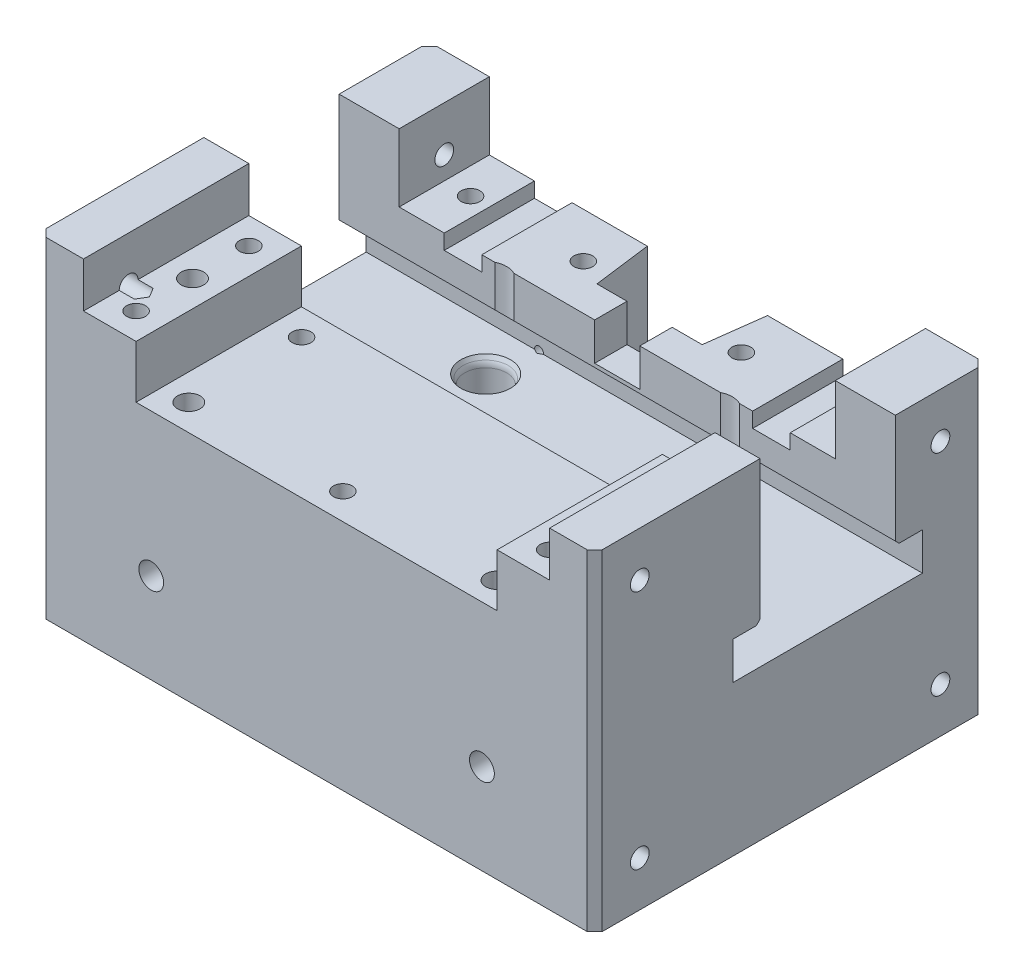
ISO-10303-21;
HEADER;
FILE_DESCRIPTION(('STEP AP214'),'2;1');
FILE_NAME('part.step','',(''),(''),'','','');
FILE_SCHEMA(('AUTOMOTIVE_DESIGN { 1 0 10303 214 1 1 1 1 }'));
ENDSEC;
DATA;
#1=APPLICATION_CONTEXT('core data for automotive mechanical design processes');
#2=APPLICATION_PROTOCOL_DEFINITION('international standard','automotive_design',2000,#1);
#3=PRODUCT_CONTEXT('',#1,'mechanical');
#4=PRODUCT('Part','Part','',(#3));
#5=PRODUCT_RELATED_PRODUCT_CATEGORY('part','',(#4));
#6=PRODUCT_DEFINITION_FORMATION('','',#4);
#7=PRODUCT_DEFINITION_CONTEXT('part definition',#1,'design');
#8=PRODUCT_DEFINITION('design','',#6,#7);
#9=PRODUCT_DEFINITION_SHAPE('','',#8);
#10=(LENGTH_UNIT() NAMED_UNIT(*) SI_UNIT(.MILLI.,.METRE.));
#11=(NAMED_UNIT(*) PLANE_ANGLE_UNIT() SI_UNIT($,.RADIAN.));
#12=(NAMED_UNIT(*) SI_UNIT($,.STERADIAN.) SOLID_ANGLE_UNIT());
#13=UNCERTAINTY_MEASURE_WITH_UNIT(LENGTH_MEASURE(1.E-05),#10,'distance_accuracy_value','');
#14=(GEOMETRIC_REPRESENTATION_CONTEXT(3) GLOBAL_UNCERTAINTY_ASSIGNED_CONTEXT((#13)) GLOBAL_UNIT_ASSIGNED_CONTEXT((#10,
#11,#12)) REPRESENTATION_CONTEXT('',''));
#15=CARTESIAN_POINT('',(0.,0.,0.));
#16=DIRECTION('',(0.,0.,1.));
#17=DIRECTION('',(1.,0.,0.));
#18=AXIS2_PLACEMENT_3D('',#15,#16,#17);
#19=CARTESIAN_POINT('',(-64.6304194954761,21.6414907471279,-60.));
#20=DIRECTION('',(0.,-1.,0.));
#21=DIRECTION('',(0.,0.,-1.));
#22=AXIS2_PLACEMENT_3D('',#19,#20,#21);
#23=PLANE('',#22);
#24=CARTESIAN_POINT('',(-30.1004194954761,21.6414907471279,-54.));
#25=DIRECTION('',(0.,1.,0.));
#26=DIRECTION('',(0.,0.,1.));
#27=AXIS2_PLACEMENT_3D('',#24,#25,#26);
#28=CIRCLE('',#27,1.24999999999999);
#29=CARTESIAN_POINT('',(-30.1004194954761,21.6414907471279,-52.75));
#30=VERTEX_POINT('',#29);
#31=EDGE_CURVE('E641',#30,#30,#28,.T.);
#32=ORIENTED_EDGE('',*,*,#31,.F.);
#33=EDGE_LOOP('',(#32));
#34=FACE_BOUND('',#33,.T.);
#35=DIRECTION('',(-1.,0.,0.));
#36=VECTOR('',#35,1.);
#37=CARTESIAN_POINT('',(2.29205920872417,21.6414907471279,-48.));
#38=LINE('',#37,#36);
#39=CARTESIAN_POINT('',(-22.6004194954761,21.6414907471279,-48.));
#40=VERTEX_POINT('',#39);
#41=CARTESIAN_POINT('',(-24.3544674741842,21.6414907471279,-48.));
#42=VERTEX_POINT('',#41);
#43=EDGE_CURVE('E645',#40,#42,#38,.T.);
#44=ORIENTED_EDGE('',*,*,#43,.F.);
#45=DIRECTION('',(0.,0.,-1.));
#46=VECTOR('',#45,1.);
#47=CARTESIAN_POINT('',(-22.6004194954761,21.6414907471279,-48.));
#48=LINE('',#47,#46);
#49=CARTESIAN_POINT('',(-22.6004194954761,21.6414907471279,-60.));
#50=VERTEX_POINT('',#49);
#51=EDGE_CURVE('E647',#40,#50,#48,.T.);
#52=ORIENTED_EDGE('',*,*,#51,.T.);
#53=DIRECTION('',(1.,0.,0.));
#54=VECTOR('',#53,1.);
#55=CARTESIAN_POINT('',(-64.6304194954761,21.6414907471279,-60.));
#56=LINE('',#55,#54);
#57=CARTESIAN_POINT('',(-32.615419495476,21.6414907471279,-60.));
#58=VERTEX_POINT('',#57);
#59=EDGE_CURVE('E852',#58,#50,#56,.T.);
#60=ORIENTED_EDGE('',*,*,#59,.F.);
#61=DIRECTION('',(0.128788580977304,0.,-0.991672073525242));
#62=VECTOR('',#61,1.);
#63=CARTESIAN_POINT('',(-33.615419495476,21.6414907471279,-52.3));
#64=LINE('',#63,#62);
#65=CARTESIAN_POINT('',(-33.615419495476,21.6414907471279,-52.3));
#66=VERTEX_POINT('',#65);
#67=EDGE_CURVE('E805',#66,#58,#64,.T.);
#68=ORIENTED_EDGE('',*,*,#67,.F.);
#69=DIRECTION('',(1.,0.,0.));
#70=VECTOR('',#69,1.);
#71=CARTESIAN_POINT('',(-47.6154194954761,21.6414907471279,-52.3));
#72=LINE('',#71,#70);
#73=CARTESIAN_POINT('',(-37.6154194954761,21.6414907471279,-52.3));
#74=VERTEX_POINT('',#73);
#75=EDGE_CURVE('E820',#74,#66,#72,.T.);
#76=ORIENTED_EDGE('',*,*,#75,.F.);
#77=DIRECTION('',(0.,0.,1.));
#78=VECTOR('',#77,1.);
#79=CARTESIAN_POINT('',(-37.6154194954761,21.6414907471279,-60.));
#80=LINE('',#79,#78);
#81=CARTESIAN_POINT('',(-37.6154194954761,21.6414907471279,-48.));
#82=VERTEX_POINT('',#81);
#83=EDGE_CURVE('E870',#74,#82,#80,.T.);
#84=ORIENTED_EDGE('',*,*,#83,.T.);
#85=CARTESIAN_POINT('',(-26.8763715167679,21.6414907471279,-48.));
#86=VERTEX_POINT('',#85);
#87=EDGE_CURVE('E656',#86,#82,#38,.T.);
#88=ORIENTED_EDGE('',*,*,#87,.F.);
#89=CARTESIAN_POINT('',(-25.6154194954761,21.6414907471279,-45.5));
#90=DIRECTION('',(0.,1.,0.));
#91=DIRECTION('',(0.,0.,1.));
#92=AXIS2_PLACEMENT_3D('',#89,#90,#91);
#93=CIRCLE('',#92,2.8);
#94=EDGE_CURVE('E650',#42,#86,#93,.T.);
#95=ORIENTED_EDGE('',*,*,#94,.F.);
#96=EDGE_LOOP('',(#44,#52,#60,#68,#76,#84,#88,#95));
#97=FACE_BOUND('',#96,.T.);
#98=ADVANCED_FACE('F16',(#34,#97),#23,.F.);
#99=CARTESIAN_POINT('',(-66.1304194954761,21.6414907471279,-54.));
#100=DIRECTION('',(0.,1.,0.));
#101=DIRECTION('',(0.,0.,1.));
#102=AXIS2_PLACEMENT_3D('',#99,#100,#101);
#103=CIRCLE('',#102,1.24999999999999);
#104=CARTESIAN_POINT('',(-66.1304194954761,21.6414907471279,-52.75));
#105=VERTEX_POINT('',#104);
#106=EDGE_CURVE('E1048',#105,#105,#103,.T.);
#107=ORIENTED_EDGE('',*,*,#106,.F.);
#108=EDGE_LOOP('',(#107));
#109=FACE_BOUND('',#108,.T.);
#110=CARTESIAN_POINT('',(-63.6304194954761,21.6414907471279,-48.));
#111=VERTEX_POINT('',#110);
#112=CARTESIAN_POINT('',(-69.6304194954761,21.6414907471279,-48.));
#113=VERTEX_POINT('',#112);
#114=EDGE_CURVE('E658',#111,#113,#38,.T.);
#115=ORIENTED_EDGE('',*,*,#114,.F.);
#116=DIRECTION('',(0.,0.,-1.));
#117=VECTOR('',#116,1.);
#118=CARTESIAN_POINT('',(-63.6304194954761,21.6414907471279,-48.));
#119=LINE('',#118,#117);
#120=CARTESIAN_POINT('',(-63.6304194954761,21.6414907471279,-60.));
#121=VERTEX_POINT('',#120);
#122=EDGE_CURVE('E1008',#111,#121,#119,.T.);
#123=ORIENTED_EDGE('',*,*,#122,.T.);
#124=CARTESIAN_POINT('',(-69.6304194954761,21.6414907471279,-60.));
#125=VERTEX_POINT('',#124);
#126=EDGE_CURVE('E849',#125,#121,#56,.T.);
#127=ORIENTED_EDGE('',*,*,#126,.F.);
#128=DIRECTION('',(0.,0.,-1.));
#129=VECTOR('',#128,1.);
#130=CARTESIAN_POINT('',(-69.6304194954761,21.6414907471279,-48.));
#131=LINE('',#130,#129);
#132=EDGE_CURVE('E1108',#113,#125,#131,.T.);
#133=ORIENTED_EDGE('',*,*,#132,.F.);
#134=EDGE_LOOP('',(#115,#123,#127,#133));
#135=FACE_BOUND('',#134,.T.);
#136=ADVANCED_FACE('F630',(#109,#135),#23,.F.);
#137=CARTESIAN_POINT('',(-77.6154194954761,30.656490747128,-60.));
#138=DIRECTION('',(0.,1.,0.));
#139=DIRECTION('',(-1.,0.,0.));
#140=AXIS2_PLACEMENT_3D('',#137,#138,#139);
#141=PLANE('',#140);
#142=DIRECTION('',(-1.,0.,0.));
#143=VECTOR('',#142,1.);
#144=CARTESIAN_POINT('',(-3.61541949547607,30.6564907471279,-60.));
#145=LINE('',#144,#143);
#146=CARTESIAN_POINT('',(-69.6304194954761,30.6564907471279,-60.));
#147=VERTEX_POINT('',#146);
#148=CARTESIAN_POINT('',(-76.615419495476,30.656490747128,-60.));
#149=VERTEX_POINT('',#148);
#150=EDGE_CURVE('E462',#147,#149,#145,.T.);
#151=ORIENTED_EDGE('',*,*,#150,.T.);
#152=DIRECTION('',(0.707106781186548,0.,-0.707106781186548));
#153=VECTOR('',#152,1.);
#154=CARTESIAN_POINT('',(-77.1154194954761,30.656490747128,-59.5));
#155=LINE('',#154,#153);
#156=CARTESIAN_POINT('',(-77.6154194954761,30.656490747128,-59.));
#157=VERTEX_POINT('',#156);
#158=EDGE_CURVE('E1192',#149,#157,#155,.F.);
#159=ORIENTED_EDGE('',*,*,#158,.T.);
#160=DIRECTION('',(0.,0.,1.));
#161=VECTOR('',#160,1.);
#162=CARTESIAN_POINT('',(-77.6154194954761,30.656490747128,-60.));
#163=LINE('',#162,#161);
#164=CARTESIAN_POINT('',(-77.6154194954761,30.656490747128,-48.));
#165=VERTEX_POINT('',#164);
#166=EDGE_CURVE('E480',#157,#165,#163,.T.);
#167=ORIENTED_EDGE('',*,*,#166,.T.);
#168=DIRECTION('',(1.,0.,0.));
#169=VECTOR('',#168,1.);
#170=CARTESIAN_POINT('',(-77.6154194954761,30.656490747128,-48.));
#171=LINE('',#170,#169);
#172=CARTESIAN_POINT('',(-69.6304194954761,30.6564907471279,-48.));
#173=VERTEX_POINT('',#172);
#174=EDGE_CURVE('E483',#165,#173,#171,.T.);
#175=ORIENTED_EDGE('',*,*,#174,.T.);
#176=DIRECTION('',(0.,0.,1.));
#177=VECTOR('',#176,1.);
#178=CARTESIAN_POINT('',(-69.6304194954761,30.6564907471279,-60.));
#179=LINE('',#178,#177);
#180=EDGE_CURVE('E1113',#147,#173,#179,.T.);
#181=ORIENTED_EDGE('',*,*,#180,.F.);
#182=EDGE_LOOP('',(#151,#159,#167,#175,#181));
#183=FACE_BOUND('',#182,.T.);
#184=ADVANCED_FACE('F636',(#183),#141,.T.);
#185=DIRECTION('',(0.,0.,-1.));
#186=VECTOR('',#185,1.);
#187=CARTESIAN_POINT('',(-3.61541949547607,30.6564907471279,-48.));
#188=LINE('',#187,#186);
#189=CARTESIAN_POINT('',(-3.61541949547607,30.6564907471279,-48.));
#190=VERTEX_POINT('',#189);
#191=CARTESIAN_POINT('',(-3.61541949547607,30.6564907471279,-59.));
#192=VERTEX_POINT('',#191);
#193=EDGE_CURVE('E486',#190,#192,#188,.T.);
#194=ORIENTED_EDGE('',*,*,#193,.T.);
#195=DIRECTION('',(0.707106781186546,0.,0.707106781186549));
#196=VECTOR('',#195,1.);
#197=CARTESIAN_POINT('',(-41.1154194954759,30.6564907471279,-96.5));
#198=LINE('',#197,#196);
#199=CARTESIAN_POINT('',(-4.61541949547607,30.6564907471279,-60.));
#200=VERTEX_POINT('',#199);
#201=EDGE_CURVE('E1198',#192,#200,#198,.F.);
#202=ORIENTED_EDGE('',*,*,#201,.T.);
#203=CARTESIAN_POINT('',(-11.6004194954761,30.6564907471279,-60.));
#204=VERTEX_POINT('',#203);
#205=EDGE_CURVE('E478',#200,#204,#145,.T.);
#206=ORIENTED_EDGE('',*,*,#205,.T.);
#207=DIRECTION('',(0.,0.,-1.));
#208=VECTOR('',#207,1.);
#209=CARTESIAN_POINT('',(-11.6004194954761,30.6564907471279,-48.));
#210=LINE('',#209,#208);
#211=CARTESIAN_POINT('',(-11.6004194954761,30.6564907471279,-48.));
#212=VERTEX_POINT('',#211);
#213=EDGE_CURVE('E1117',#212,#204,#210,.T.);
#214=ORIENTED_EDGE('',*,*,#213,.F.);
#215=EDGE_CURVE('E482',#212,#190,#171,.T.);
#216=ORIENTED_EDGE('',*,*,#215,.T.);
#217=EDGE_LOOP('',(#194,#202,#206,#214,#216));
#218=FACE_BOUND('',#217,.T.);
#219=ADVANCED_FACE('F1239',(#218),#141,.T.);
#220=CARTESIAN_POINT('',(-77.6154194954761,28.6564907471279,-30.));
#221=DIRECTION('',(0.,1.,0.));
#222=DIRECTION('',(0.,0.,1.));
#223=AXIS2_PLACEMENT_3D('',#220,#221,#222);
#224=PLANE('',#223);
#225=DIRECTION('',(-1.,0.,0.));
#226=VECTOR('',#225,1.);
#227=CARTESIAN_POINT('',(-77.6154194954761,28.6564907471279,-15.25));
#228=LINE('',#227,#226);
#229=CARTESIAN_POINT('',(-69.6154194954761,28.6564907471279,-15.25));
#230=VERTEX_POINT('',#229);
#231=CARTESIAN_POINT('',(-71.6254194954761,28.6564907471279,-15.25));
#232=VERTEX_POINT('',#231);
#233=EDGE_CURVE('E1562',#230,#232,#228,.T.);
#234=ORIENTED_EDGE('',*,*,#233,.F.);
#235=DIRECTION('',(-0.515038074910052,0.,-0.857167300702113));
#236=VECTOR('',#235,1.);
#237=CARTESIAN_POINT('',(-68.8643437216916,28.6564907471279,-14.));
#238=LINE('',#237,#236);
#239=CARTESIAN_POINT('',(-68.8643437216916,28.6564907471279,-14.));
#240=VERTEX_POINT('',#239);
#241=EDGE_CURVE('E1557',#240,#230,#238,.T.);
#242=ORIENTED_EDGE('',*,*,#241,.F.);
#243=DIRECTION('',(0.515038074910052,0.,-0.857167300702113));
#244=VECTOR('',#243,1.);
#245=CARTESIAN_POINT('',(-68.8643437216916,28.6564907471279,-14.));
#246=LINE('',#245,#244);
#247=CARTESIAN_POINT('',(-69.6154194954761,28.6564907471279,-12.75));
#248=VERTEX_POINT('',#247);
#249=EDGE_CURVE('E1555',#248,#240,#246,.T.);
#250=ORIENTED_EDGE('',*,*,#249,.F.);
#251=DIRECTION('',(-1.,0.,0.));
#252=VECTOR('',#251,1.);
#253=CARTESIAN_POINT('',(-77.6154194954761,28.6564907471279,-12.75));
#254=LINE('',#253,#252);
#255=CARTESIAN_POINT('',(-71.6254194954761,28.6564907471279,-12.75));
#256=VERTEX_POINT('',#255);
#257=EDGE_CURVE('E1559',#256,#248,#254,.F.);
#258=ORIENTED_EDGE('',*,*,#257,.F.);
#259=DIRECTION('',(0.,0.,-1.));
#260=VECTOR('',#259,1.);
#261=CARTESIAN_POINT('',(-71.6254194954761,28.6564907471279,-8.));
#262=LINE('',#261,#260);
#263=CARTESIAN_POINT('',(-71.6254194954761,28.6564907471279,-8.));
#264=VERTEX_POINT('',#263);
#265=EDGE_CURVE('E958',#264,#256,#262,.T.);
#266=ORIENTED_EDGE('',*,*,#265,.F.);
#267=DIRECTION('',(-1.,0.,0.));
#268=VECTOR('',#267,1.);
#269=CARTESIAN_POINT('',(-87.2384754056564,28.6564907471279,-8.));
#270=LINE('',#269,#268);
#271=CARTESIAN_POINT('',(-64.6304194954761,28.6564907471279,-8.));
#272=VERTEX_POINT('',#271);
#273=EDGE_CURVE('E975',#272,#264,#270,.T.);
#274=ORIENTED_EDGE('',*,*,#273,.F.);
#275=DIRECTION('',(0.,0.,1.));
#276=VECTOR('',#275,1.);
#277=CARTESIAN_POINT('',(-64.6304194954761,28.6564907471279,-30.));
#278=LINE('',#277,#276);
#279=CARTESIAN_POINT('',(-64.6304194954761,28.6564907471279,-30.));
#280=VERTEX_POINT('',#279);
#281=EDGE_CURVE('E725',#280,#272,#278,.T.);
#282=ORIENTED_EDGE('',*,*,#281,.F.);
#283=DIRECTION('',(-1.,0.,0.));
#284=VECTOR('',#283,1.);
#285=CARTESIAN_POINT('',(-77.6154194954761,28.6564907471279,-30.));
#286=LINE('',#285,#284);
#287=CARTESIAN_POINT('',(-71.6254194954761,28.6564907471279,-30.));
#288=VERTEX_POINT('',#287);
#289=EDGE_CURVE('E682',#280,#288,#286,.T.);
#290=ORIENTED_EDGE('',*,*,#289,.T.);
#291=EDGE_CURVE('E1160',#232,#288,#262,.T.);
#292=ORIENTED_EDGE('',*,*,#291,.F.);
#293=EDGE_LOOP('',(#234,#242,#250,#258,#266,#274,#282,#290,#292));
#294=FACE_BOUND('',#293,.T.);
#295=CARTESIAN_POINT('',(-68.1279194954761,28.6564907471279,-26.5));
#296=DIRECTION('',(0.,1.,0.));
#297=DIRECTION('',(0.,0.,1.));
#298=AXIS2_PLACEMENT_3D('',#295,#296,#297);
#299=CIRCLE('',#298,1.24999999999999);
#300=CARTESIAN_POINT('',(-68.1279194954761,28.6564907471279,-25.25));
#301=VERTEX_POINT('',#300);
#302=EDGE_CURVE('E1126',#301,#301,#299,.T.);
#303=ORIENTED_EDGE('',*,*,#302,.F.);
#304=EDGE_LOOP('',(#303));
#305=FACE_BOUND('',#304,.T.);
#306=CARTESIAN_POINT('',(-68.1279194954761,28.6564907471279,-11.5));
#307=DIRECTION('',(0.,1.,0.));
#308=DIRECTION('',(0.,0.,1.));
#309=AXIS2_PLACEMENT_3D('',#306,#307,#308);
#310=CIRCLE('',#309,1.24999999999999);
#311=CARTESIAN_POINT('',(-68.1279194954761,28.6564907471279,-10.25));
#312=VERTEX_POINT('',#311);
#313=EDGE_CURVE('E1132',#312,#312,#310,.T.);
#314=ORIENTED_EDGE('',*,*,#313,.F.);
#315=EDGE_LOOP('',(#314));
#316=FACE_BOUND('',#315,.T.);
#317=CARTESIAN_POINT('',(-68.1279194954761,28.6564907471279,-19.));
#318=DIRECTION('',(0.,1.,0.));
#319=DIRECTION('',(0.,0.,1.));
#320=AXIS2_PLACEMENT_3D('',#317,#318,#319);
#321=CIRCLE('',#320,1.5);
#322=CARTESIAN_POINT('',(-68.1279194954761,28.6564907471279,-17.5));
#323=VERTEX_POINT('',#322);
#324=EDGE_CURVE('E1150',#323,#323,#321,.T.);
#325=ORIENTED_EDGE('',*,*,#324,.F.);
#326=EDGE_LOOP('',(#325));
#327=FACE_BOUND('',#326,.T.);
#328=ADVANCED_FACE('F1252',(#294,#305,#316,#327),#224,.T.);
#329=CARTESIAN_POINT('',(-16.6154194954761,28.6564907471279,-30.));
#330=DIRECTION('',(0.,1.,0.));
#331=DIRECTION('',(0.,0.,1.));
#332=AXIS2_PLACEMENT_3D('',#329,#330,#331);
#333=PLANE('',#332);
#334=DIRECTION('',(1.,0.,0.));
#335=VECTOR('',#334,1.);
#336=CARTESIAN_POINT('',(-3.61541949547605,28.6564907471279,-12.75));
#337=LINE('',#336,#335);
#338=CARTESIAN_POINT('',(-11.615419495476,28.6564907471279,-12.75));
#339=VERTEX_POINT('',#338);
#340=CARTESIAN_POINT('',(-9.60541949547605,28.6564907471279,-12.75));
#341=VERTEX_POINT('',#340);
#342=EDGE_CURVE('E1080',#339,#341,#337,.T.);
#343=ORIENTED_EDGE('',*,*,#342,.F.);
#344=DIRECTION('',(0.515038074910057,0.,0.857167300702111));
#345=VECTOR('',#344,1.);
#346=CARTESIAN_POINT('',(-12.3664952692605,28.6564907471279,-14.));
#347=LINE('',#346,#345);
#348=CARTESIAN_POINT('',(-12.3664952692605,28.6564907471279,-14.));
#349=VERTEX_POINT('',#348);
#350=EDGE_CURVE('E1325',#349,#339,#347,.T.);
#351=ORIENTED_EDGE('',*,*,#350,.F.);
#352=DIRECTION('',(-0.515038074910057,0.,0.857167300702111));
#353=VECTOR('',#352,1.);
#354=CARTESIAN_POINT('',(-12.3664952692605,28.6564907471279,-14.));
#355=LINE('',#354,#353);
#356=CARTESIAN_POINT('',(-11.615419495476,28.6564907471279,-15.25));
#357=VERTEX_POINT('',#356);
#358=EDGE_CURVE('E1328',#357,#349,#355,.T.);
#359=ORIENTED_EDGE('',*,*,#358,.F.);
#360=DIRECTION('',(1.,0.,0.));
#361=VECTOR('',#360,1.);
#362=CARTESIAN_POINT('',(-3.61541949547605,28.6564907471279,-15.25));
#363=LINE('',#362,#361);
#364=CARTESIAN_POINT('',(-9.60541949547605,28.6564907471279,-15.25));
#365=VERTEX_POINT('',#364);
#366=EDGE_CURVE('E1078',#365,#357,#363,.F.);
#367=ORIENTED_EDGE('',*,*,#366,.F.);
#368=DIRECTION('',(0.,0.,1.));
#369=VECTOR('',#368,1.);
#370=CARTESIAN_POINT('',(-9.60541949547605,28.6564907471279,-8.));
#371=LINE('',#370,#369);
#372=CARTESIAN_POINT('',(-9.60541949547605,28.6564907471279,-30.));
#373=VERTEX_POINT('',#372);
#374=EDGE_CURVE('E701',#373,#365,#371,.T.);
#375=ORIENTED_EDGE('',*,*,#374,.F.);
#376=DIRECTION('',(-1.,0.,0.));
#377=VECTOR('',#376,1.);
#378=CARTESIAN_POINT('',(-16.6154194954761,28.6564907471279,-30.));
#379=LINE('',#378,#377);
#380=CARTESIAN_POINT('',(-16.6004194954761,28.6564907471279,-30.));
#381=VERTEX_POINT('',#380);
#382=EDGE_CURVE('E500',#373,#381,#379,.T.);
#383=ORIENTED_EDGE('',*,*,#382,.T.);
#384=DIRECTION('',(0.,0.,-1.));
#385=VECTOR('',#384,1.);
#386=CARTESIAN_POINT('',(-16.6004194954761,28.6564907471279,-30.));
#387=LINE('',#386,#385);
#388=CARTESIAN_POINT('',(-16.6004194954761,28.6564907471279,-8.));
#389=VERTEX_POINT('',#388);
#390=EDGE_CURVE('E698',#389,#381,#387,.T.);
#391=ORIENTED_EDGE('',*,*,#390,.F.);
#392=CARTESIAN_POINT('',(-9.60541949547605,28.6564907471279,-8.));
#393=VERTEX_POINT('',#392);
#394=EDGE_CURVE('E979',#393,#389,#270,.T.);
#395=ORIENTED_EDGE('',*,*,#394,.F.);
#396=EDGE_CURVE('E953',#341,#393,#371,.T.);
#397=ORIENTED_EDGE('',*,*,#396,.F.);
#398=EDGE_LOOP('',(#343,#351,#359,#367,#375,#383,#391,#395,#397));
#399=FACE_BOUND('',#398,.T.);
#400=CARTESIAN_POINT('',(-13.102919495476,28.6564907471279,-26.5));
#401=DIRECTION('',(0.,1.,0.));
#402=DIRECTION('',(0.,0.,1.));
#403=AXIS2_PLACEMENT_3D('',#400,#401,#402);
#404=CIRCLE('',#403,1.25);
#405=CARTESIAN_POINT('',(-13.102919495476,28.6564907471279,-25.25));
#406=VERTEX_POINT('',#405);
#407=EDGE_CURVE('E1138',#406,#406,#404,.T.);
#408=ORIENTED_EDGE('',*,*,#407,.F.);
#409=EDGE_LOOP('',(#408));
#410=FACE_BOUND('',#409,.T.);
#411=CARTESIAN_POINT('',(-13.102919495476,28.6564907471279,-11.5));
#412=DIRECTION('',(0.,1.,0.));
#413=DIRECTION('',(0.,0.,1.));
#414=AXIS2_PLACEMENT_3D('',#411,#412,#413);
#415=CIRCLE('',#414,1.25);
#416=CARTESIAN_POINT('',(-13.102919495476,28.6564907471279,-10.25));
#417=VERTEX_POINT('',#416);
#418=EDGE_CURVE('E1144',#417,#417,#415,.T.);
#419=ORIENTED_EDGE('',*,*,#418,.F.);
#420=EDGE_LOOP('',(#419));
#421=FACE_BOUND('',#420,.T.);
#422=CARTESIAN_POINT('',(-13.102919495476,28.6564907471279,-19.));
#423=DIRECTION('',(0.,1.,0.));
#424=DIRECTION('',(0.,0.,-1.));
#425=AXIS2_PLACEMENT_3D('',#422,#423,#424);
#426=CIRCLE('',#425,1.5);
#427=CARTESIAN_POINT('',(-13.102919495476,28.6564907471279,-20.5));
#428=VERTEX_POINT('',#427);
#429=EDGE_CURVE('E1154',#428,#428,#426,.T.);
#430=ORIENTED_EDGE('',*,*,#429,.F.);
#431=EDGE_LOOP('',(#430));
#432=FACE_BOUND('',#431,.T.);
#433=ADVANCED_FACE('F695',(#399,#410,#421,#432),#333,.T.);
#434=CARTESIAN_POINT('',(2.29205920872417,10.6564907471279,-48.));
#435=DIRECTION('',(0.,0.,-1.));
#436=DIRECTION('',(-1.,0.,0.));
#437=AXIS2_PLACEMENT_3D('',#434,#435,#436);
#438=PLANE('',#437);
#439=DIRECTION('',(1.,0.,0.));
#440=VECTOR('',#439,1.);
#441=CARTESIAN_POINT('',(2.29205920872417,16.1564907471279,-48.));
#442=LINE('',#441,#440);
#443=CARTESIAN_POINT('',(-54.3544674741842,16.156490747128,-48.));
#444=VERTEX_POINT('',#443);
#445=CARTESIAN_POINT('',(-26.8763715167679,16.156490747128,-48.));
#446=VERTEX_POINT('',#445);
#447=EDGE_CURVE('E884',#444,#446,#442,.T.);
#448=ORIENTED_EDGE('',*,*,#447,.T.);
#449=DIRECTION('',(0.,1.,0.));
#450=VECTOR('',#449,1.);
#451=CARTESIAN_POINT('',(-26.8763715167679,-9.34350925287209,-48.));
#452=LINE('',#451,#450);
#453=EDGE_CURVE('E986',#446,#86,#452,.T.);
#454=ORIENTED_EDGE('',*,*,#453,.T.);
#455=ORIENTED_EDGE('',*,*,#87,.T.);
#456=DIRECTION('',(0.,-1.,0.));
#457=VECTOR('',#456,1.);
#458=CARTESIAN_POINT('',(-37.6154194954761,10.6564907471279,-48.));
#459=LINE('',#458,#457);
#460=CARTESIAN_POINT('',(-37.6154194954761,16.6414907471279,-48.));
#461=VERTEX_POINT('',#460);
#462=EDGE_CURVE('E845',#82,#461,#459,.T.);
#463=ORIENTED_EDGE('',*,*,#462,.T.);
#464=DIRECTION('',(-1.,0.,0.));
#465=VECTOR('',#464,1.);
#466=CARTESIAN_POINT('',(2.29205920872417,16.6414907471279,-48.));
#467=LINE('',#466,#465);
#468=CARTESIAN_POINT('',(-43.6154194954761,16.6414907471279,-48.));
#469=VERTEX_POINT('',#468);
#470=EDGE_CURVE('E873',#461,#469,#467,.T.);
#471=ORIENTED_EDGE('',*,*,#470,.T.);
#472=DIRECTION('',(0.,1.,0.));
#473=VECTOR('',#472,1.);
#474=CARTESIAN_POINT('',(-43.6154194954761,10.6564907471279,-48.));
#475=LINE('',#474,#473);
#476=CARTESIAN_POINT('',(-43.6154194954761,21.6414907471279,-48.));
#477=VERTEX_POINT('',#476);
#478=EDGE_CURVE('E842',#469,#477,#475,.T.);
#479=ORIENTED_EDGE('',*,*,#478,.T.);
#480=CARTESIAN_POINT('',(-54.3544674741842,21.6414907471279,-48.));
#481=VERTEX_POINT('',#480);
#482=EDGE_CURVE('E661',#477,#481,#38,.T.);
#483=ORIENTED_EDGE('',*,*,#482,.T.);
#484=DIRECTION('',(0.,1.,0.));
#485=VECTOR('',#484,1.);
#486=CARTESIAN_POINT('',(-54.3544674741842,-9.34350925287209,-48.));
#487=LINE('',#486,#485);
#488=EDGE_CURVE('E905',#481,#444,#487,.F.);
#489=ORIENTED_EDGE('',*,*,#488,.T.);
#490=EDGE_LOOP('',(#448,#454,#455,#463,#471,#479,#483,#489));
#491=FACE_BOUND('',#490,.T.);
#492=ADVANCED_FACE('F996',(#491),#438,.F.);
#493=DIRECTION('',(-1.,0.,0.));
#494=VECTOR('',#493,1.);
#495=CARTESIAN_POINT('',(-63.6304194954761,19.6414907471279,-48.));
#496=LINE('',#495,#494);
#497=CARTESIAN_POINT('',(-58.6304194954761,19.6414907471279,-48.));
#498=VERTEX_POINT('',#497);
#499=CARTESIAN_POINT('',(-63.6304194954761,19.6414907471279,-48.));
#500=VERTEX_POINT('',#499);
#501=EDGE_CURVE('E1013',#498,#500,#496,.T.);
#502=ORIENTED_EDGE('',*,*,#501,.T.);
#503=DIRECTION('',(0.,1.,0.));
#504=VECTOR('',#503,1.);
#505=CARTESIAN_POINT('',(-63.6304194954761,19.6414907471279,-48.));
#506=LINE('',#505,#504);
#507=EDGE_CURVE('E1014',#500,#111,#506,.T.);
#508=ORIENTED_EDGE('',*,*,#507,.T.);
#509=ORIENTED_EDGE('',*,*,#114,.T.);
#510=DIRECTION('',(0.,-1.,0.));
#511=VECTOR('',#510,1.);
#512=CARTESIAN_POINT('',(-69.6304194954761,30.6564907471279,-48.));
#513=LINE('',#512,#511);
#514=EDGE_CURVE('E1105',#173,#113,#513,.T.);
#515=ORIENTED_EDGE('',*,*,#514,.F.);
#516=ORIENTED_EDGE('',*,*,#174,.F.);
#517=DIRECTION('',(0.,1.,0.));
#518=VECTOR('',#517,1.);
#519=CARTESIAN_POINT('',(-77.6154194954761,10.6564907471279,-48.));
#520=LINE('',#519,#518);
#521=CARTESIAN_POINT('',(-77.6154194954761,16.156490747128,-48.));
#522=VERTEX_POINT('',#521);
#523=EDGE_CURVE('E491',#522,#165,#520,.T.);
#524=ORIENTED_EDGE('',*,*,#523,.F.);
#525=CARTESIAN_POINT('',(-56.8763715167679,16.156490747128,-48.));
#526=VERTEX_POINT('',#525);
#527=EDGE_CURVE('E506',#522,#526,#442,.T.);
#528=ORIENTED_EDGE('',*,*,#527,.T.);
#529=DIRECTION('',(0.,1.,0.));
#530=VECTOR('',#529,1.);
#531=CARTESIAN_POINT('',(-56.8763715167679,-9.34350925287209,-48.));
#532=LINE('',#531,#530);
#533=CARTESIAN_POINT('',(-56.8763715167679,21.6414907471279,-48.));
#534=VERTEX_POINT('',#533);
#535=EDGE_CURVE('E894',#526,#534,#532,.T.);
#536=ORIENTED_EDGE('',*,*,#535,.T.);
#537=CARTESIAN_POINT('',(-58.6304194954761,21.6414907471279,-48.));
#538=VERTEX_POINT('',#537);
#539=EDGE_CURVE('E662',#534,#538,#38,.T.);
#540=ORIENTED_EDGE('',*,*,#539,.T.);
#541=DIRECTION('',(0.,-1.,0.));
#542=VECTOR('',#541,1.);
#543=CARTESIAN_POINT('',(-58.6304194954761,19.6414907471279,-48.));
#544=LINE('',#543,#542);
#545=EDGE_CURVE('E1011',#538,#498,#544,.T.);
#546=ORIENTED_EDGE('',*,*,#545,.T.);
#547=EDGE_LOOP('',(#502,#508,#509,#515,#516,#524,#528,#536,#540,#546));
#548=FACE_BOUND('',#547,.T.);
#549=ADVANCED_FACE('F893',(#548),#438,.F.);
#550=CARTESIAN_POINT('',(-15.1004194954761,21.6414907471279,-54.));
#551=DIRECTION('',(0.,1.,0.));
#552=DIRECTION('',(0.,0.,1.));
#553=AXIS2_PLACEMENT_3D('',#550,#551,#552);
#554=CIRCLE('',#553,1.25);
#555=CARTESIAN_POINT('',(-15.1004194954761,21.6414907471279,-52.75));
#556=VERTEX_POINT('',#555);
#557=EDGE_CURVE('E1029',#556,#556,#554,.T.);
#558=ORIENTED_EDGE('',*,*,#557,.F.);
#559=EDGE_LOOP('',(#558));
#560=FACE_BOUND('',#559,.T.);
#561=CARTESIAN_POINT('',(-17.6004194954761,21.6414907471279,-60.));
#562=VERTEX_POINT('',#561);
#563=CARTESIAN_POINT('',(-11.6004194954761,21.6414907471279,-60.));
#564=VERTEX_POINT('',#563);
#565=EDGE_CURVE('E848',#562,#564,#56,.T.);
#566=ORIENTED_EDGE('',*,*,#565,.F.);
#567=DIRECTION('',(0.,0.,-1.));
#568=VECTOR('',#567,1.);
#569=CARTESIAN_POINT('',(-17.6004194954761,21.6414907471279,-48.));
#570=LINE('',#569,#568);
#571=CARTESIAN_POINT('',(-17.6004194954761,21.6414907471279,-48.));
#572=VERTEX_POINT('',#571);
#573=EDGE_CURVE('E1598',#572,#562,#570,.T.);
#574=ORIENTED_EDGE('',*,*,#573,.F.);
#575=CARTESIAN_POINT('',(-11.6004194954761,21.6414907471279,-48.));
#576=VERTEX_POINT('',#575);
#577=EDGE_CURVE('E655',#576,#572,#38,.T.);
#578=ORIENTED_EDGE('',*,*,#577,.F.);
#579=DIRECTION('',(0.,0.,1.));
#580=VECTOR('',#579,1.);
#581=CARTESIAN_POINT('',(-11.6004194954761,21.6414907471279,-60.));
#582=LINE('',#581,#580);
#583=EDGE_CURVE('E1123',#564,#576,#582,.T.);
#584=ORIENTED_EDGE('',*,*,#583,.F.);
#585=EDGE_LOOP('',(#566,#574,#578,#584));
#586=FACE_BOUND('',#585,.T.);
#587=ADVANCED_FACE('F624',(#560,#586),#23,.F.);
#588=CARTESIAN_POINT('',(-77.6154194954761,28.6564907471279,-30.));
#589=DIRECTION('',(-1.,0.,0.));
#590=DIRECTION('',(0.,0.,1.));
#591=AXIS2_PLACEMENT_3D('',#588,#589,#590);
#592=PLANE('',#591);
#593=CARTESIAN_POINT('',(-77.6154194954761,-3.34350925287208,-14.));
#594=DIRECTION('',(-1.,0.,0.));
#595=DIRECTION('',(0.,0.,1.));
#596=AXIS2_PLACEMENT_3D('',#593,#594,#595);
#597=CIRCLE('',#596,1.25);
#598=CARTESIAN_POINT('',(-77.6154194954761,-3.34350925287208,-12.75));
#599=VERTEX_POINT('',#598);
#600=EDGE_CURVE('E1082',#599,#599,#597,.T.);
#601=ORIENTED_EDGE('',*,*,#600,.F.);
#602=EDGE_LOOP('',(#601));
#603=FACE_BOUND('',#602,.T.);
#604=CARTESIAN_POINT('',(-77.6154194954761,-3.34350925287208,-54.));
#605=DIRECTION('',(-1.,0.,0.));
#606=DIRECTION('',(0.,0.,1.));
#607=AXIS2_PLACEMENT_3D('',#604,#605,#606);
#608=CIRCLE('',#607,1.25);
#609=CARTESIAN_POINT('',(-77.6154194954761,-3.34350925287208,-52.75));
#610=VERTEX_POINT('',#609);
#611=EDGE_CURVE('E1088',#610,#610,#608,.T.);
#612=ORIENTED_EDGE('',*,*,#611,.F.);
#613=EDGE_LOOP('',(#612));
#614=FACE_BOUND('',#613,.T.);
#615=CARTESIAN_POINT('',(-77.6154194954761,24.6564907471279,-54.));
#616=DIRECTION('',(-1.,0.,0.));
#617=DIRECTION('',(0.,0.,1.));
#618=AXIS2_PLACEMENT_3D('',#615,#616,#617);
#619=CIRCLE('',#618,1.25);
#620=CARTESIAN_POINT('',(-77.6154194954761,24.6564907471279,-52.75));
#621=VERTEX_POINT('',#620);
#622=EDGE_CURVE('E1094',#621,#621,#619,.T.);
#623=ORIENTED_EDGE('',*,*,#622,.F.);
#624=EDGE_LOOP('',(#623));
#625=FACE_BOUND('',#624,.T.);
#626=CARTESIAN_POINT('',(-77.6154194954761,28.6564907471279,-14.));
#627=DIRECTION('',(-1.,0.,0.));
#628=DIRECTION('',(0.,0.,1.));
#629=AXIS2_PLACEMENT_3D('',#626,#627,#628);
#630=CIRCLE('',#629,1.25);
#631=CARTESIAN_POINT('',(-77.6154194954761,28.6564907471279,-12.75));
#632=VERTEX_POINT('',#631);
#633=EDGE_CURVE('E1100',#632,#632,#630,.T.);
#634=ORIENTED_EDGE('',*,*,#633,.F.);
#635=EDGE_LOOP('',(#634));
#636=FACE_BOUND('',#635,.T.);
#637=DIRECTION('',(0.,0.,1.));
#638=VECTOR('',#637,1.);
#639=CARTESIAN_POINT('',(-77.6154194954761,-9.34350925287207,7.34878364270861));
#640=LINE('',#639,#638);
#641=CARTESIAN_POINT('',(-77.6154194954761,-9.34350925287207,-59.));
#642=VERTEX_POINT('',#641);
#643=CARTESIAN_POINT('',(-77.6154194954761,-9.34350925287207,-9.));
#644=VERTEX_POINT('',#643);
#645=EDGE_CURVE('E730',#642,#644,#640,.T.);
#646=ORIENTED_EDGE('',*,*,#645,.T.);
#647=DIRECTION('',(0.,1.,0.));
#648=VECTOR('',#647,1.);
#649=CARTESIAN_POINT('',(-77.6154194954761,34.6564907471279,-9.));
#650=LINE('',#649,#648);
#651=CARTESIAN_POINT('',(-77.6154194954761,34.6564907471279,-9.));
#652=VERTEX_POINT('',#651);
#653=EDGE_CURVE('E1175',#644,#652,#650,.T.);
#654=ORIENTED_EDGE('',*,*,#653,.T.);
#655=DIRECTION('',(0.,0.,1.));
#656=VECTOR('',#655,1.);
#657=CARTESIAN_POINT('',(-77.6154194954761,34.6564907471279,-8.));
#658=LINE('',#657,#656);
#659=CARTESIAN_POINT('',(-77.6154194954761,34.6564907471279,-30.));
#660=VERTEX_POINT('',#659);
#661=EDGE_CURVE('E951',#660,#652,#658,.T.);
#662=ORIENTED_EDGE('',*,*,#661,.F.);
#663=DIRECTION('',(0.,-1.,0.));
#664=VECTOR('',#663,1.);
#665=CARTESIAN_POINT('',(-77.6154194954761,28.6564907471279,-30.));
#666=LINE('',#665,#664);
#667=CARTESIAN_POINT('',(-77.6154194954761,16.156490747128,-30.));
#668=VERTEX_POINT('',#667);
#669=EDGE_CURVE('E677',#660,#668,#666,.T.);
#670=ORIENTED_EDGE('',*,*,#669,.T.);
#671=DIRECTION('',(0.,-0.707106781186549,0.707106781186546));
#672=VECTOR('',#671,1.);
#673=CARTESIAN_POINT('',(-77.6154194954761,22.406490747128,-36.25));
#674=LINE('',#673,#672);
#675=CARTESIAN_POINT('',(-77.6154194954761,15.6564907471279,-29.5));
#676=VERTEX_POINT('',#675);
#677=EDGE_CURVE('E514',#668,#676,#674,.T.);
#678=ORIENTED_EDGE('',*,*,#677,.T.);
#679=DIRECTION('',(0.,0.,1.));
#680=VECTOR('',#679,1.);
#681=CARTESIAN_POINT('',(-77.6154194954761,15.6564907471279,-51.6));
#682=LINE('',#681,#680);
#683=CARTESIAN_POINT('',(-77.6154194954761,15.6564907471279,-26.4));
#684=VERTEX_POINT('',#683);
#685=EDGE_CURVE('E739',#676,#684,#682,.T.);
#686=ORIENTED_EDGE('',*,*,#685,.T.);
#687=DIRECTION('',(0.,-1.,0.));
#688=VECTOR('',#687,1.);
#689=CARTESIAN_POINT('',(-77.6154194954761,15.6564907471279,-26.4));
#690=LINE('',#689,#688);
#691=CARTESIAN_POINT('',(-77.6154194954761,10.6564907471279,-26.4));
#692=VERTEX_POINT('',#691);
#693=EDGE_CURVE('E477',#684,#692,#690,.T.);
#694=ORIENTED_EDGE('',*,*,#693,.T.);
#695=DIRECTION('',(0.,0.,1.));
#696=VECTOR('',#695,1.);
#697=CARTESIAN_POINT('',(-77.6154194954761,10.6564907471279,-48.));
#698=LINE('',#697,#696);
#699=CARTESIAN_POINT('',(-77.6154194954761,10.6564907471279,-51.6));
#700=VERTEX_POINT('',#699);
#701=EDGE_CURVE('E489',#700,#692,#698,.T.);
#702=ORIENTED_EDGE('',*,*,#701,.F.);
#703=DIRECTION('',(0.,1.,0.));
#704=VECTOR('',#703,1.);
#705=CARTESIAN_POINT('',(-77.6154194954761,15.6564907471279,-51.6));
#706=LINE('',#705,#704);
#707=CARTESIAN_POINT('',(-77.6154194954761,15.6564907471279,-51.6));
#708=VERTEX_POINT('',#707);
#709=EDGE_CURVE('E736',#700,#708,#706,.T.);
#710=ORIENTED_EDGE('',*,*,#709,.T.);
#711=CARTESIAN_POINT('',(-77.6154194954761,15.6564907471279,-48.5));
#712=VERTEX_POINT('',#711);
#713=EDGE_CURVE('E740',#708,#712,#682,.T.);
#714=ORIENTED_EDGE('',*,*,#713,.T.);
#715=DIRECTION('',(0.,-0.707106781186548,-0.707106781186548));
#716=VECTOR('',#715,1.);
#717=CARTESIAN_POINT('',(-77.6154194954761,31.4064907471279,-32.75));
#718=LINE('',#717,#716);
#719=EDGE_CURVE('E516',#712,#522,#718,.F.);
#720=ORIENTED_EDGE('',*,*,#719,.T.);
#721=ORIENTED_EDGE('',*,*,#523,.T.);
#722=ORIENTED_EDGE('',*,*,#166,.F.);
#723=DIRECTION('',(0.,-1.,0.));
#724=VECTOR('',#723,1.);
#725=CARTESIAN_POINT('',(-77.6154194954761,28.6564907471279,-59.));
#726=LINE('',#725,#724);
#727=EDGE_CURVE('E1179',#157,#642,#726,.T.);
#728=ORIENTED_EDGE('',*,*,#727,.T.);
#729=EDGE_LOOP('',(#646,#654,#662,#670,#678,#686,#694,#702,#710,#714,#720,#721,#722,#728));
#730=FACE_BOUND('',#729,.T.);
#731=ADVANCED_FACE('F1172',(#603,#614,#625,#636,#730),#592,.T.);
#732=CARTESIAN_POINT('',(-3.61541949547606,28.6564907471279,-30.));
#733=DIRECTION('',(1.,0.,0.));
#734=DIRECTION('',(0.,1.,0.));
#735=AXIS2_PLACEMENT_3D('',#732,#733,#734);
#736=PLANE('',#735);
#737=CARTESIAN_POINT('',(-3.61541949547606,-3.34350925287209,-14.));
#738=DIRECTION('',(1.,0.,0.));
#739=DIRECTION('',(0.,0.,-1.));
#740=AXIS2_PLACEMENT_3D('',#737,#738,#739);
#741=CIRCLE('',#740,1.25);
#742=CARTESIAN_POINT('',(-3.61541949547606,-3.34350925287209,-15.25));
#743=VERTEX_POINT('',#742);
#744=EDGE_CURVE('E1054',#743,#743,#741,.T.);
#745=ORIENTED_EDGE('',*,*,#744,.F.);
#746=EDGE_LOOP('',(#745));
#747=FACE_BOUND('',#746,.T.);
#748=CARTESIAN_POINT('',(-3.61541949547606,-3.34350925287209,-54.));
#749=DIRECTION('',(1.,0.,0.));
#750=DIRECTION('',(0.,0.,-1.));
#751=AXIS2_PLACEMENT_3D('',#748,#749,#750);
#752=CIRCLE('',#751,1.25);
#753=CARTESIAN_POINT('',(-3.61541949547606,-3.34350925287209,-55.25));
#754=VERTEX_POINT('',#753);
#755=EDGE_CURVE('E1060',#754,#754,#752,.T.);
#756=ORIENTED_EDGE('',*,*,#755,.F.);
#757=EDGE_LOOP('',(#756));
#758=FACE_BOUND('',#757,.T.);
#759=CARTESIAN_POINT('',(-3.61541949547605,24.6564907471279,-54.));
#760=DIRECTION('',(1.,0.,0.));
#761=DIRECTION('',(0.,0.,-1.));
#762=AXIS2_PLACEMENT_3D('',#759,#760,#761);
#763=CIRCLE('',#762,1.25);
#764=CARTESIAN_POINT('',(-3.61541949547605,24.6564907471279,-55.25));
#765=VERTEX_POINT('',#764);
#766=EDGE_CURVE('E1066',#765,#765,#763,.T.);
#767=ORIENTED_EDGE('',*,*,#766,.F.);
#768=EDGE_LOOP('',(#767));
#769=FACE_BOUND('',#768,.T.);
#770=CARTESIAN_POINT('',(-3.61541949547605,28.6564907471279,-14.));
#771=DIRECTION('',(1.,0.,0.));
#772=DIRECTION('',(0.,0.,-1.));
#773=AXIS2_PLACEMENT_3D('',#770,#771,#772);
#774=CIRCLE('',#773,1.25);
#775=CARTESIAN_POINT('',(-3.61541949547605,28.6564907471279,-15.25));
#776=VERTEX_POINT('',#775);
#777=EDGE_CURVE('E1072',#776,#776,#774,.T.);
#778=ORIENTED_EDGE('',*,*,#777,.F.);
#779=EDGE_LOOP('',(#778));
#780=FACE_BOUND('',#779,.T.);
#781=DIRECTION('',(0.,0.,1.));
#782=VECTOR('',#781,1.);
#783=CARTESIAN_POINT('',(-3.61541949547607,-9.34350925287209,7.34878364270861));
#784=LINE('',#783,#782);
#785=CARTESIAN_POINT('',(-3.61541949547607,-9.34350925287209,-59.));
#786=VERTEX_POINT('',#785);
#787=CARTESIAN_POINT('',(-3.61541949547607,-9.34350925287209,-9.));
#788=VERTEX_POINT('',#787);
#789=EDGE_CURVE('E729',#786,#788,#784,.T.);
#790=ORIENTED_EDGE('',*,*,#789,.F.);
#791=DIRECTION('',(0.,1.,0.));
#792=VECTOR('',#791,1.);
#793=CARTESIAN_POINT('',(-3.61541949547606,28.6564907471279,-59.));
#794=LINE('',#793,#792);
#795=EDGE_CURVE('E1196',#786,#192,#794,.T.);
#796=ORIENTED_EDGE('',*,*,#795,.T.);
#797=ORIENTED_EDGE('',*,*,#193,.F.);
#798=DIRECTION('',(0.,1.,0.));
#799=VECTOR('',#798,1.);
#800=CARTESIAN_POINT('',(-3.61541949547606,28.6564907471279,-48.));
#801=LINE('',#800,#799);
#802=CARTESIAN_POINT('',(-3.61541949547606,16.156490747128,-48.));
#803=VERTEX_POINT('',#802);
#804=EDGE_CURVE('E494',#803,#190,#801,.T.);
#805=ORIENTED_EDGE('',*,*,#804,.F.);
#806=DIRECTION('',(0.,0.707106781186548,0.707106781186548));
#807=VECTOR('',#806,1.);
#808=CARTESIAN_POINT('',(-3.61541949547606,31.4064907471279,-32.75));
#809=LINE('',#808,#807);
#810=CARTESIAN_POINT('',(-3.61541949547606,15.6564907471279,-48.5));
#811=VERTEX_POINT('',#810);
#812=EDGE_CURVE('E510',#803,#811,#809,.F.);
#813=ORIENTED_EDGE('',*,*,#812,.T.);
#814=DIRECTION('',(0.,0.,1.));
#815=VECTOR('',#814,1.);
#816=CARTESIAN_POINT('',(-3.61541949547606,15.6564907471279,-51.6));
#817=LINE('',#816,#815);
#818=CARTESIAN_POINT('',(-3.61541949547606,15.6564907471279,-51.6));
#819=VERTEX_POINT('',#818);
#820=EDGE_CURVE('E747',#819,#811,#817,.T.);
#821=ORIENTED_EDGE('',*,*,#820,.F.);
#822=DIRECTION('',(0.,1.,0.));
#823=VECTOR('',#822,1.);
#824=CARTESIAN_POINT('',(-3.61541949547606,15.6564907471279,-51.6));
#825=LINE('',#824,#823);
#826=CARTESIAN_POINT('',(-3.61541949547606,10.6564907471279,-51.6));
#827=VERTEX_POINT('',#826);
#828=EDGE_CURVE('E733',#827,#819,#825,.T.);
#829=ORIENTED_EDGE('',*,*,#828,.F.);
#830=DIRECTION('',(0.,0.,-1.));
#831=VECTOR('',#830,1.);
#832=CARTESIAN_POINT('',(-3.61541949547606,10.6564907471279,-30.));
#833=LINE('',#832,#831);
#834=CARTESIAN_POINT('',(-3.61541949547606,10.6564907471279,-26.4));
#835=VERTEX_POINT('',#834);
#836=EDGE_CURVE('E673',#835,#827,#833,.T.);
#837=ORIENTED_EDGE('',*,*,#836,.F.);
#838=DIRECTION('',(0.,-1.,0.));
#839=VECTOR('',#838,1.);
#840=CARTESIAN_POINT('',(-3.61541949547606,15.6564907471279,-26.4));
#841=LINE('',#840,#839);
#842=CARTESIAN_POINT('',(-3.61541949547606,15.6564907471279,-26.4));
#843=VERTEX_POINT('',#842);
#844=EDGE_CURVE('E466',#843,#835,#841,.T.);
#845=ORIENTED_EDGE('',*,*,#844,.F.);
#846=CARTESIAN_POINT('',(-3.61541949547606,15.6564907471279,-29.5));
#847=VERTEX_POINT('',#846);
#848=EDGE_CURVE('E746',#847,#843,#817,.T.);
#849=ORIENTED_EDGE('',*,*,#848,.F.);
#850=DIRECTION('',(0.,0.707106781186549,-0.707106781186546));
#851=VECTOR('',#850,1.);
#852=CARTESIAN_POINT('',(-3.61541949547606,22.406490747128,-36.25));
#853=LINE('',#852,#851);
#854=CARTESIAN_POINT('',(-3.61541949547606,16.1564907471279,-30.));
#855=VERTEX_POINT('',#854);
#856=EDGE_CURVE('E508',#847,#855,#853,.T.);
#857=ORIENTED_EDGE('',*,*,#856,.T.);
#858=DIRECTION('',(0.,1.,0.));
#859=VECTOR('',#858,1.);
#860=CARTESIAN_POINT('',(-3.61541949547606,28.6564907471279,-30.));
#861=LINE('',#860,#859);
#862=CARTESIAN_POINT('',(-3.61541949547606,34.6564907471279,-30.));
#863=VERTEX_POINT('',#862);
#864=EDGE_CURVE('E497',#855,#863,#861,.T.);
#865=ORIENTED_EDGE('',*,*,#864,.T.);
#866=DIRECTION('',(0.,0.,-1.));
#867=VECTOR('',#866,1.);
#868=CARTESIAN_POINT('',(-3.61541949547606,34.6564907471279,-8.));
#869=LINE('',#868,#867);
#870=CARTESIAN_POINT('',(-3.61541949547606,34.6564907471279,-9.));
#871=VERTEX_POINT('',#870);
#872=EDGE_CURVE('E960',#871,#863,#869,.T.);
#873=ORIENTED_EDGE('',*,*,#872,.F.);
#874=DIRECTION('',(0.,-1.,0.));
#875=VECTOR('',#874,1.);
#876=CARTESIAN_POINT('',(-3.61541949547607,-9.34350925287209,-9.));
#877=LINE('',#876,#875);
#878=EDGE_CURVE('E1194',#871,#788,#877,.T.);
#879=ORIENTED_EDGE('',*,*,#878,.T.);
#880=EDGE_LOOP('',(#790,#796,#797,#805,#813,#821,#829,#837,#845,#849,#857,#865,#873,#879));
#881=FACE_BOUND('',#880,.T.);
#882=ADVANCED_FACE('F763',(#747,#758,#769,#780,#881),#736,.T.);
#883=CARTESIAN_POINT('',(-3.61541949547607,-11.3435092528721,-30.));
#884=DIRECTION('',(0.,0.,-1.));
#885=DIRECTION('',(-1.,0.,0.));
#886=AXIS2_PLACEMENT_3D('',#883,#884,#885);
#887=PLANE('',#886);
#888=ORIENTED_EDGE('',*,*,#864,.F.);
#889=DIRECTION('',(-1.,0.,0.));
#890=VECTOR('',#889,1.);
#891=CARTESIAN_POINT('',(-77.6154194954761,16.156490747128,-30.));
#892=LINE('',#891,#890);
#893=EDGE_CURVE('E521',#855,#668,#892,.T.);
#894=ORIENTED_EDGE('',*,*,#893,.T.);
#895=ORIENTED_EDGE('',*,*,#669,.F.);
#896=DIRECTION('',(-1.,0.,0.));
#897=VECTOR('',#896,1.);
#898=CARTESIAN_POINT('',(-77.6154194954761,34.6564907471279,-30.));
#899=LINE('',#898,#897);
#900=CARTESIAN_POINT('',(-71.6254194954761,34.6564907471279,-30.));
#901=VERTEX_POINT('',#900);
#902=EDGE_CURVE('E947',#901,#660,#899,.T.);
#903=ORIENTED_EDGE('',*,*,#902,.F.);
#904=DIRECTION('',(0.,-1.,0.));
#905=VECTOR('',#904,1.);
#906=CARTESIAN_POINT('',(-71.6254194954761,34.6564907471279,-30.));
#907=LINE('',#906,#905);
#908=EDGE_CURVE('E945',#901,#288,#907,.T.);
#909=ORIENTED_EDGE('',*,*,#908,.T.);
#910=ORIENTED_EDGE('',*,*,#289,.F.);
#911=DIRECTION('',(0.,1.,0.));
#912=VECTOR('',#911,1.);
#913=CARTESIAN_POINT('',(-64.6304194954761,-11.3435092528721,-30.));
#914=LINE('',#913,#912);
#915=CARTESIAN_POINT('',(-64.6304194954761,21.6414907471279,-30.));
#916=VERTEX_POINT('',#915);
#917=EDGE_CURVE('E710',#916,#280,#914,.T.);
#918=ORIENTED_EDGE('',*,*,#917,.F.);
#919=DIRECTION('',(-1.,0.,0.));
#920=VECTOR('',#919,1.);
#921=CARTESIAN_POINT('',(-3.61541949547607,21.6414907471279,-30.));
#922=LINE('',#921,#920);
#923=CARTESIAN_POINT('',(-16.6004194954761,21.6414907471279,-30.));
#924=VERTEX_POINT('',#923);
#925=EDGE_CURVE('E716',#924,#916,#922,.T.);
#926=ORIENTED_EDGE('',*,*,#925,.F.);
#927=DIRECTION('',(0.,-1.,0.));
#928=VECTOR('',#927,1.);
#929=CARTESIAN_POINT('',(-16.6004194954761,-11.3435092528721,-30.));
#930=LINE('',#929,#928);
#931=EDGE_CURVE('E707',#381,#924,#930,.T.);
#932=ORIENTED_EDGE('',*,*,#931,.F.);
#933=ORIENTED_EDGE('',*,*,#382,.F.);
#934=DIRECTION('',(0.,-1.,0.));
#935=VECTOR('',#934,1.);
#936=CARTESIAN_POINT('',(-9.60541949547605,34.6564907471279,-30.));
#937=LINE('',#936,#935);
#938=CARTESIAN_POINT('',(-9.60541949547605,34.6564907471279,-30.));
#939=VERTEX_POINT('',#938);
#940=EDGE_CURVE('E973',#939,#373,#937,.T.);
#941=ORIENTED_EDGE('',*,*,#940,.F.);
#942=DIRECTION('',(-1.,0.,0.));
#943=VECTOR('',#942,1.);
#944=CARTESIAN_POINT('',(-3.61541949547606,34.6564907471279,-30.));
#945=LINE('',#944,#943);
#946=EDGE_CURVE('E962',#863,#939,#945,.T.);
#947=ORIENTED_EDGE('',*,*,#946,.F.);
#948=EDGE_LOOP('',(#888,#894,#895,#903,#909,#910,#918,#926,#932,#933,#941,#947));
#949=FACE_BOUND('',#948,.T.);
#950=ADVANCED_FACE('F714',(#949),#887,.T.);
#951=CARTESIAN_POINT('',(-77.6154194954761,13.6564907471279,-60.));
#952=DIRECTION('',(0.,0.,-1.));
#953=DIRECTION('',(-1.,0.,0.));
#954=AXIS2_PLACEMENT_3D('',#951,#952,#953);
#955=PLANE('',#954);
#956=CARTESIAN_POINT('',(-54.6154194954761,10.7414907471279,-60.));
#957=DIRECTION('',(0.,0.,-1.));
#958=DIRECTION('',(-1.,0.,0.));
#959=AXIS2_PLACEMENT_3D('',#956,#957,#958);
#960=CIRCLE('',#959,1.24999999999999);
#961=CARTESIAN_POINT('',(-55.8654194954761,10.7414907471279,-60.));
#962=VERTEX_POINT('',#961);
#963=EDGE_CURVE('E1693',#962,#962,#960,.T.);
#964=ORIENTED_EDGE('',*,*,#963,.F.);
#965=EDGE_LOOP('',(#964));
#966=FACE_BOUND('',#965,.T.);
#967=CARTESIAN_POINT('',(-26.6154194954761,10.7414907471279,-60.));
#968=DIRECTION('',(0.,0.,-1.));
#969=DIRECTION('',(-1.,0.,0.));
#970=AXIS2_PLACEMENT_3D('',#967,#968,#969);
#971=CIRCLE('',#970,1.24999999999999);
#972=CARTESIAN_POINT('',(-27.865419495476,10.7414907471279,-60.));
#973=VERTEX_POINT('',#972);
#974=EDGE_CURVE('E454',#973,#973,#971,.T.);
#975=ORIENTED_EDGE('',*,*,#974,.F.);
#976=EDGE_LOOP('',(#975));
#977=FACE_BOUND('',#976,.T.);
#978=DIRECTION('',(0.,1.,0.));
#979=VECTOR('',#978,1.);
#980=CARTESIAN_POINT('',(-22.6004194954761,19.6414907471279,-60.));
#981=LINE('',#980,#979);
#982=CARTESIAN_POINT('',(-22.6004194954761,19.6414907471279,-60.));
#983=VERTEX_POINT('',#982);
#984=EDGE_CURVE('E859',#983,#50,#981,.T.);
#985=ORIENTED_EDGE('',*,*,#984,.F.);
#986=DIRECTION('',(-1.,0.,0.));
#987=VECTOR('',#986,1.);
#988=CARTESIAN_POINT('',(-22.6004194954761,19.6414907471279,-60.));
#989=LINE('',#988,#987);
#990=CARTESIAN_POINT('',(-17.6004194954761,19.6414907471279,-60.));
#991=VERTEX_POINT('',#990);
#992=EDGE_CURVE('E1607',#991,#983,#989,.T.);
#993=ORIENTED_EDGE('',*,*,#992,.F.);
#994=DIRECTION('',(0.,-1.,0.));
#995=VECTOR('',#994,1.);
#996=CARTESIAN_POINT('',(-17.6004194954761,19.6414907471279,-60.));
#997=LINE('',#996,#995);
#998=EDGE_CURVE('E1595',#562,#991,#997,.T.);
#999=ORIENTED_EDGE('',*,*,#998,.F.);
#1000=ORIENTED_EDGE('',*,*,#565,.T.);
#1001=DIRECTION('',(0.,-1.,0.));
#1002=VECTOR('',#1001,1.);
#1003=CARTESIAN_POINT('',(-11.6004194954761,30.6564907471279,-60.));
#1004=LINE('',#1003,#1002);
#1005=EDGE_CURVE('E1120',#204,#564,#1004,.T.);
#1006=ORIENTED_EDGE('',*,*,#1005,.F.);
#1007=ORIENTED_EDGE('',*,*,#205,.F.);
#1008=DIRECTION('',(0.,-1.,0.));
#1009=VECTOR('',#1008,1.);
#1010=CARTESIAN_POINT('',(-4.61541949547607,13.6564907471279,-60.));
#1011=LINE('',#1010,#1009);
#1012=CARTESIAN_POINT('',(-4.61541949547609,-9.34350925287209,-60.));
#1013=VERTEX_POINT('',#1012);
#1014=EDGE_CURVE('E1181',#200,#1013,#1011,.T.);
#1015=ORIENTED_EDGE('',*,*,#1014,.T.);
#1016=DIRECTION('',(1.,0.,0.));
#1017=VECTOR('',#1016,1.);
#1018=CARTESIAN_POINT('',(-77.6154194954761,-9.34350925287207,-60.));
#1019=LINE('',#1018,#1017);
#1020=CARTESIAN_POINT('',(-76.6154194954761,-9.34350925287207,-60.));
#1021=VERTEX_POINT('',#1020);
#1022=EDGE_CURVE('E665',#1021,#1013,#1019,.T.);
#1023=ORIENTED_EDGE('',*,*,#1022,.F.);
#1024=DIRECTION('',(0.,1.,0.));
#1025=VECTOR('',#1024,1.);
#1026=CARTESIAN_POINT('',(-76.6154194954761,13.6564907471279,-60.));
#1027=LINE('',#1026,#1025);
#1028=EDGE_CURVE('E1189',#1021,#149,#1027,.T.);
#1029=ORIENTED_EDGE('',*,*,#1028,.T.);
#1030=ORIENTED_EDGE('',*,*,#150,.F.);
#1031=DIRECTION('',(0.,1.,0.));
#1032=VECTOR('',#1031,1.);
#1033=CARTESIAN_POINT('',(-69.6304194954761,21.6414907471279,-60.));
#1034=LINE('',#1033,#1032);
#1035=EDGE_CURVE('E1111',#125,#147,#1034,.T.);
#1036=ORIENTED_EDGE('',*,*,#1035,.F.);
#1037=ORIENTED_EDGE('',*,*,#126,.T.);
#1038=DIRECTION('',(0.,1.,0.));
#1039=VECTOR('',#1038,1.);
#1040=CARTESIAN_POINT('',(-63.6304194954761,19.6414907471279,-60.));
#1041=LINE('',#1040,#1039);
#1042=CARTESIAN_POINT('',(-63.6304194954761,19.6414907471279,-60.));
#1043=VERTEX_POINT('',#1042);
#1044=EDGE_CURVE('E1021',#1043,#121,#1041,.T.);
#1045=ORIENTED_EDGE('',*,*,#1044,.F.);
#1046=DIRECTION('',(-1.,0.,0.));
#1047=VECTOR('',#1046,1.);
#1048=CARTESIAN_POINT('',(-63.6304194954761,19.6414907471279,-60.));
#1049=LINE('',#1048,#1047);
#1050=CARTESIAN_POINT('',(-58.6304194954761,19.6414907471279,-60.));
#1051=VERTEX_POINT('',#1050);
#1052=EDGE_CURVE('E1017',#1051,#1043,#1049,.T.);
#1053=ORIENTED_EDGE('',*,*,#1052,.F.);
#1054=DIRECTION('',(0.,-1.,0.));
#1055=VECTOR('',#1054,1.);
#1056=CARTESIAN_POINT('',(-58.6304194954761,19.6414907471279,-60.));
#1057=LINE('',#1056,#1055);
#1058=CARTESIAN_POINT('',(-58.6304194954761,21.6414907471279,-60.));
#1059=VERTEX_POINT('',#1058);
#1060=EDGE_CURVE('E1004',#1059,#1051,#1057,.T.);
#1061=ORIENTED_EDGE('',*,*,#1060,.F.);
#1062=CARTESIAN_POINT('',(-48.6154194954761,21.6414907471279,-60.));
#1063=VERTEX_POINT('',#1062);
#1064=EDGE_CURVE('E851',#1059,#1063,#56,.T.);
#1065=ORIENTED_EDGE('',*,*,#1064,.T.);
#1066=DIRECTION('',(0.,1.,0.));
#1067=VECTOR('',#1066,1.);
#1068=CARTESIAN_POINT('',(-48.6154194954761,7.64149074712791,-60.));
#1069=LINE('',#1068,#1067);
#1070=CARTESIAN_POINT('',(-48.6154194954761,7.64149074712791,-60.));
#1071=VERTEX_POINT('',#1070);
#1072=EDGE_CURVE('E816',#1071,#1063,#1069,.T.);
#1073=ORIENTED_EDGE('',*,*,#1072,.F.);
#1074=DIRECTION('',(1.,0.,0.));
#1075=VECTOR('',#1074,1.);
#1076=CARTESIAN_POINT('',(-77.6154194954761,7.64149074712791,-60.));
#1077=LINE('',#1076,#1075);
#1078=CARTESIAN_POINT('',(-32.615419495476,7.64149074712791,-60.));
#1079=VERTEX_POINT('',#1078);
#1080=EDGE_CURVE('E879',#1071,#1079,#1077,.T.);
#1081=ORIENTED_EDGE('',*,*,#1080,.T.);
#1082=DIRECTION('',(0.,1.,0.));
#1083=VECTOR('',#1082,1.);
#1084=CARTESIAN_POINT('',(-32.615419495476,7.64149074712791,-60.));
#1085=LINE('',#1084,#1083);
#1086=EDGE_CURVE('E809',#1079,#58,#1085,.T.);
#1087=ORIENTED_EDGE('',*,*,#1086,.T.);
#1088=ORIENTED_EDGE('',*,*,#59,.T.);
#1089=EDGE_LOOP('',(#985,#993,#999,#1000,#1006,#1007,#1015,#1023,#1029,#1030,#1036,#1037,#1045,
#1053,#1061,#1065,#1073,#1081,#1087,#1088));
#1090=FACE_BOUND('',#1089,.T.);
#1091=ADVANCED_FACE('F857',(#966,#977,#1090),#955,.T.);
#1092=DIRECTION('',(-1.,0.,0.));
#1093=VECTOR('',#1092,1.);
#1094=CARTESIAN_POINT('',(-22.6004194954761,19.6414907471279,-48.));
#1095=LINE('',#1094,#1093);
#1096=CARTESIAN_POINT('',(-17.6004194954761,19.6414907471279,-48.));
#1097=VERTEX_POINT('',#1096);
#1098=CARTESIAN_POINT('',(-22.6004194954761,19.6414907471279,-48.));
#1099=VERTEX_POINT('',#1098);
#1100=EDGE_CURVE('E1601',#1097,#1099,#1095,.T.);
#1101=ORIENTED_EDGE('',*,*,#1100,.T.);
#1102=DIRECTION('',(0.,1.,0.));
#1103=VECTOR('',#1102,1.);
#1104=CARTESIAN_POINT('',(-22.6004194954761,19.6414907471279,-48.));
#1105=LINE('',#1104,#1103);
#1106=EDGE_CURVE('E1604',#1099,#40,#1105,.T.);
#1107=ORIENTED_EDGE('',*,*,#1106,.T.);
#1108=ORIENTED_EDGE('',*,*,#43,.T.);
#1109=DIRECTION('',(0.,1.,0.));
#1110=VECTOR('',#1109,1.);
#1111=CARTESIAN_POINT('',(-24.3544674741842,-9.34350925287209,-48.));
#1112=LINE('',#1111,#1110);
#1113=CARTESIAN_POINT('',(-24.3544674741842,16.156490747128,-48.));
#1114=VERTEX_POINT('',#1113);
#1115=EDGE_CURVE('E985',#42,#1114,#1112,.F.);
#1116=ORIENTED_EDGE('',*,*,#1115,.T.);
#1117=EDGE_CURVE('E882',#1114,#803,#442,.T.);
#1118=ORIENTED_EDGE('',*,*,#1117,.T.);
#1119=ORIENTED_EDGE('',*,*,#804,.T.);
#1120=ORIENTED_EDGE('',*,*,#215,.F.);
#1121=DIRECTION('',(0.,1.,0.));
#1122=VECTOR('',#1121,1.);
#1123=CARTESIAN_POINT('',(-11.6004194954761,21.6414907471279,-48.));
#1124=LINE('',#1123,#1122);
#1125=EDGE_CURVE('E1115',#576,#212,#1124,.T.);
#1126=ORIENTED_EDGE('',*,*,#1125,.F.);
#1127=ORIENTED_EDGE('',*,*,#577,.T.);
#1128=DIRECTION('',(0.,-1.,0.));
#1129=VECTOR('',#1128,1.);
#1130=CARTESIAN_POINT('',(-17.6004194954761,19.6414907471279,-48.));
#1131=LINE('',#1130,#1129);
#1132=EDGE_CURVE('E1600',#572,#1097,#1131,.T.);
#1133=ORIENTED_EDGE('',*,*,#1132,.T.);
#1134=EDGE_LOOP('',(#1101,#1107,#1108,#1116,#1118,#1119,#1120,#1126,#1127,#1133));
#1135=FACE_BOUND('',#1134,.T.);
#1136=ADVANCED_FACE('F1237',(#1135),#438,.F.);
#1137=CARTESIAN_POINT('',(2.29205920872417,10.6564907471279,-30.));
#1138=DIRECTION('',(0.,-1.,0.));
#1139=DIRECTION('',(1.,0.,0.));
#1140=AXIS2_PLACEMENT_3D('',#1137,#1138,#1139);
#1141=PLANE('',#1140);
#1142=CARTESIAN_POINT('',(-25.6154194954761,10.6564907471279,-45.5));
#1143=DIRECTION('',(0.,-1.,0.));
#1144=DIRECTION('',(1.,0.,0.));
#1145=AXIS2_PLACEMENT_3D('',#1142,#1143,#1144);
#1146=CIRCLE('',#1145,3.3);
#1147=CARTESIAN_POINT('',(-22.315419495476,10.6564907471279,-45.5));
#1148=VERTEX_POINT('',#1147);
#1149=EDGE_CURVE('E1205',#1148,#1148,#1146,.T.);
#1150=ORIENTED_EDGE('',*,*,#1149,.T.);
#1151=EDGE_LOOP('',(#1150));
#1152=FACE_BOUND('',#1151,.T.);
#1153=CARTESIAN_POINT('',(-55.6154194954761,10.6564907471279,-45.5));
#1154=DIRECTION('',(0.,-1.,0.));
#1155=DIRECTION('',(1.,0.,0.));
#1156=AXIS2_PLACEMENT_3D('',#1153,#1154,#1155);
#1157=CIRCLE('',#1156,3.3);
#1158=CARTESIAN_POINT('',(-52.3154194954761,10.6564907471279,-45.5));
#1159=VERTEX_POINT('',#1158);
#1160=EDGE_CURVE('E1202',#1159,#1159,#1157,.T.);
#1161=ORIENTED_EDGE('',*,*,#1160,.T.);
#1162=EDGE_LOOP('',(#1161));
#1163=FACE_BOUND('',#1162,.T.);
#1164=DIRECTION('',(1.,0.,0.));
#1165=VECTOR('',#1164,1.);
#1166=CARTESIAN_POINT('',(-77.6154194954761,10.6564907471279,-51.6));
#1167=LINE('',#1166,#1165);
#1168=CARTESIAN_POINT('',(-54.0373470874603,10.6564907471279,-51.6));
#1169=VERTEX_POINT('',#1168);
#1170=CARTESIAN_POINT('',(-27.1934919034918,10.6564907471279,-51.6));
#1171=VERTEX_POINT('',#1170);
#1172=EDGE_CURVE('E42',#1169,#1171,#1167,.T.);
#1173=ORIENTED_EDGE('',*,*,#1172,.F.);
#1174=CARTESIAN_POINT('',(-57.5492550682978,10.6564907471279,-53.012490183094));
#1175=CARTESIAN_POINT('',(-57.3481113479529,10.6564907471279,-52.8916891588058));
#1176=CARTESIAN_POINT('',(-57.1469688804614,10.6564907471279,-52.77088598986));
#1177=CARTESIAN_POINT('',(-56.744660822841,10.6564907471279,-52.5293103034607));
#1178=CARTESIAN_POINT('',(-56.5434952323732,10.6564907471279,-52.4085377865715));
#1179=CARTESIAN_POINT('',(-56.2415150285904,10.6564907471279,-52.227311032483));
#1180=CARTESIAN_POINT('',(-56.1407160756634,10.6564907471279,-52.1668306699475));
#1181=CARTESIAN_POINT('',(-55.9390994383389,10.6564907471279,-52.0459004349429));
#1182=CARTESIAN_POINT('',(-55.8382817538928,10.6564907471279,-51.9854505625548));
#1183=CARTESIAN_POINT('',(-55.6366056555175,10.6564907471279,-51.8646217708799));
#1184=CARTESIAN_POINT('',(-55.5357472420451,10.6564907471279,-51.8042428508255));
#1185=CARTESIAN_POINT('',(-55.3339520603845,10.6564907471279,-51.6836158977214));
#1186=CARTESIAN_POINT('',(-55.2330152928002,10.6564907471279,-51.6233678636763));
#1187=CARTESIAN_POINT('',(-55.0896125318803,10.6564907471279,-51.5383656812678));
#1188=CARTESIAN_POINT('',(-55.0472970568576,10.6564907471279,-51.5133561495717));
#1189=CARTESIAN_POINT('',(-54.9625374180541,10.6564907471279,-51.4635760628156));
#1190=CARTESIAN_POINT('',(-54.9200932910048,10.6564907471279,-51.4388054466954));
#1191=CARTESIAN_POINT('',(-54.855003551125,10.6564907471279,-51.4016217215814));
#1192=CARTESIAN_POINT('',(-54.8325200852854,10.6564907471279,-51.3889222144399));
#1193=CARTESIAN_POINT('',(-54.7872721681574,10.6564907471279,-51.3639805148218));
#1194=CARTESIAN_POINT('',(-54.7645075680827,10.6564907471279,-51.351738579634));
#1195=CARTESIAN_POINT('',(-54.7287098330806,10.6564907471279,-51.3339242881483));
#1196=CARTESIAN_POINT('',(-54.7159329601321,10.6564907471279,-51.3278399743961));
#1197=CARTESIAN_POINT('',(-54.6899286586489,10.6564907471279,-51.3166146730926));
#1198=CARTESIAN_POINT('',(-54.6767010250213,10.6564907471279,-51.3114741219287));
#1199=CARTESIAN_POINT('',(-54.6541480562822,10.6564907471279,-51.3048578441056));
#1200=CARTESIAN_POINT('',(-54.6450299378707,10.6564907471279,-51.302730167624));
#1201=CARTESIAN_POINT('',(-54.6266096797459,10.6564907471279,-51.3001652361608));
#1202=CARTESIAN_POINT('',(-54.617309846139,10.6564907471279,-51.2997133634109));
#1203=CARTESIAN_POINT('',(-54.5988246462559,10.6564907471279,-51.3006628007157));
#1204=CARTESIAN_POINT('',(-54.5896392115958,10.6564907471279,-51.3020629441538));
#1205=CARTESIAN_POINT('',(-54.5714998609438,10.6564907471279,-51.3061838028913));
#1206=CARTESIAN_POINT('',(-54.5625494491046,10.6564907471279,-51.30891841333));
#1207=CARTESIAN_POINT('',(-54.5436031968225,10.6564907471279,-51.3156041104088));
#1208=CARTESIAN_POINT('',(-54.5336521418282,10.6564907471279,-51.3196761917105));
#1209=CARTESIAN_POINT('',(-54.5139780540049,10.6564907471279,-51.3283459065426));
#1210=CARTESIAN_POINT('',(-54.5042552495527,10.6564907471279,-51.3329440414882));
#1211=CARTESIAN_POINT('',(-54.4752480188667,10.6564907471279,-51.3471893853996));
#1212=CARTESIAN_POINT('',(-54.4561770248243,10.6564907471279,-51.3572655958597));
#1213=CARTESIAN_POINT('',(-54.4181929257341,10.6564907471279,-51.3778811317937));
#1214=CARTESIAN_POINT('',(-54.3992807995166,10.6564907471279,-51.3884221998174));
#1215=CARTESIAN_POINT('',(-54.3616134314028,10.6564907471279,-51.4097051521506));
#1216=CARTESIAN_POINT('',(-54.3428579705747,10.6564907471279,-51.4204466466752));
#1217=CARTESIAN_POINT('',(-54.2865754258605,10.6564907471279,-51.452907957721));
#1218=CARTESIAN_POINT('',(-54.249148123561,10.6564907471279,-51.4747995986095));
#1219=CARTESIAN_POINT('',(-54.1743959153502,10.6564907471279,-51.5187589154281));
#1220=CARTESIAN_POINT('',(-54.1370710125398,10.6564907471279,-51.5408265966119));
#1221=CARTESIAN_POINT('',(-54.0251108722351,10.6564907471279,-51.6071975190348));
#1222=CARTESIAN_POINT('',(-53.9505532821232,10.6564907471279,-51.6516316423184));
#1223=CARTESIAN_POINT('',(-53.8038265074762,10.6564907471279,-51.7392240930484));
#1224=CARTESIAN_POINT('',(-53.7316552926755,10.6564907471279,-51.7823790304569));
#1225=CARTESIAN_POINT('',(-53.5874121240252,10.6564907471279,-51.8687102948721));
#1226=CARTESIAN_POINT('',(-53.51534013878,10.6564907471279,-51.9118865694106));
#1227=CARTESIAN_POINT('',(-53.4432726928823,10.6564907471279,-51.9550704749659));
#1228=B_SPLINE_CURVE_WITH_KNOTS('',3,(#1174,#1175,#1176,#1177,#1178,#1179,#1180,#1181,#1182,
#1183,#1184,#1185,#1186,#1187,#1188,#1189,#1190,#1191,#1192,#1193,#1194,#1195,#1196,#1197,#1198,
#1199,#1200,#1201,#1202,#1203,#1204,#1205,#1206,#1207,#1208,#1209,#1210,#1211,#1212,#1213,#1214,
#1215,#1216,#1217,#1218,#1219,#1220,#1221,#1222,#1223,#1224,#1225,#1226,#1227),.UNSPECIFIED.,
.F.,.F.,(4,2,2,2,2,2,2,2,2,2,2,2,2,2,2,2,2,2,2,2,2,2,2,2,2,2,4),(0.,0.7038929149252,
1.40779796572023,1.76045183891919,2.11310664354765,2.46575759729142,2.81840585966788,
2.96586779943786,3.113290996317,3.19076018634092,3.26827230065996,3.31072048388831,
3.3531882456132,3.38117634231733,3.40891972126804,3.43664563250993,3.46466660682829,
3.4968944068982,3.52915318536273,3.59384039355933,3.65879505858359,3.72363439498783,
3.85371178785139,3.98379307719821,4.24417503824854,4.49644337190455,4.74848912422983),.UNSPECIFIED.);
#1229=CARTESIAN_POINT('',(-55.1934919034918,10.6564907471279,-51.6));
#1230=VERTEX_POINT('',#1229);
#1231=EDGE_CURVE('E11',#1169,#1230,#1228,.F.);
#1232=ORIENTED_EDGE('',*,*,#1231,.T.);
#1233=EDGE_CURVE('E453',#700,#1230,#1167,.T.);
#1234=ORIENTED_EDGE('',*,*,#1233,.F.);
#1235=ORIENTED_EDGE('',*,*,#701,.T.);
#1236=DIRECTION('',(1.,0.,0.));
#1237=VECTOR('',#1236,1.);
#1238=CARTESIAN_POINT('',(-77.6154194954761,10.6564907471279,-26.4));
#1239=LINE('',#1238,#1237);
#1240=EDGE_CURVE('E463',#692,#835,#1239,.T.);
#1241=ORIENTED_EDGE('',*,*,#1240,.T.);
#1242=ORIENTED_EDGE('',*,*,#836,.T.);
#1243=CARTESIAN_POINT('',(-26.0373470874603,10.6564907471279,-51.6));
#1244=VERTEX_POINT('',#1243);
#1245=EDGE_CURVE('E460',#1244,#827,#1167,.T.);
#1246=ORIENTED_EDGE('',*,*,#1245,.F.);
#1247=CARTESIAN_POINT('',(-29.5492549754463,10.6564907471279,-53.0124901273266));
#1248=CARTESIAN_POINT('',(-29.3481112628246,10.6564907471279,-52.8916891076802));
#1249=CARTESIAN_POINT('',(-29.1469688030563,10.6564907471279,-52.7708859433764));
#1250=CARTESIAN_POINT('',(-28.744660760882,10.6564907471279,-52.5293102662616));
#1251=CARTESIAN_POINT('',(-28.5434951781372,10.6564907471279,-52.4085377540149));
#1252=CARTESIAN_POINT('',(-28.2415149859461,10.6564907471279,-52.2273110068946));
#1253=CARTESIAN_POINT('',(-28.1407160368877,10.6564907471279,-52.1668306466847));
#1254=CARTESIAN_POINT('',(-27.9390994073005,10.6564907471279,-52.0459004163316));
#1255=CARTESIAN_POINT('',(-27.8382817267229,10.6564907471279,-51.9854505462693));
#1256=CARTESIAN_POINT('',(-27.6366056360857,10.6564907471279,-51.8646217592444));
#1257=CARTESIAN_POINT('',(-27.5357472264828,10.6564907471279,-51.8042428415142));
#1258=CARTESIAN_POINT('',(-27.3339520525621,10.6564907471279,-51.6836158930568));
#1259=CARTESIAN_POINT('',(-27.2330152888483,10.6564907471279,-51.6233678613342));
#1260=CARTESIAN_POINT('',(-27.0896125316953,10.6564907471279,-51.538365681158));
#1261=CARTESIAN_POINT('',(-27.047297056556,10.6564907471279,-51.5133561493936));
#1262=CARTESIAN_POINT('',(-26.9625374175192,10.6564907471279,-51.4635760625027));
#1263=CARTESIAN_POINT('',(-26.9200932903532,10.6564907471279,-51.4388054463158));
#1264=CARTESIAN_POINT('',(-26.8550035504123,10.6564907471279,-51.4016217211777));
#1265=CARTESIAN_POINT('',(-26.8325200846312,10.6564907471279,-51.3889222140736));
#1266=CARTESIAN_POINT('',(-26.7872721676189,10.6564907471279,-51.3639805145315));
#1267=CARTESIAN_POINT('',(-26.7645075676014,10.6564907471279,-51.3517385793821));
#1268=CARTESIAN_POINT('',(-26.7287098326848,10.6564907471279,-51.3339242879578));
#1269=CARTESIAN_POINT('',(-26.7159329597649,10.6564907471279,-51.3278399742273));
#1270=CARTESIAN_POINT('',(-26.6899286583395,10.6564907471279,-51.3166146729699));
#1271=CARTESIAN_POINT('',(-26.6767010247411,10.6564907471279,-51.3114741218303));
#1272=CARTESIAN_POINT('',(-26.6541480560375,10.6564907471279,-51.3048578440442));
#1273=CARTESIAN_POINT('',(-26.6450299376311,10.6564907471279,-51.3027301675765));
#1274=CARTESIAN_POINT('',(-26.6266096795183,10.6564907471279,-51.3001652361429));
#1275=CARTESIAN_POINT('',(-26.6173098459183,10.6564907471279,-51.2997133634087));
#1276=CARTESIAN_POINT('',(-26.5988246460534,10.6564907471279,-51.3006628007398));
#1277=CARTESIAN_POINT('',(-26.5896392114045,10.6564907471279,-51.3020629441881));
#1278=CARTESIAN_POINT('',(-26.5714998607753,10.6564907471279,-51.306183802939));
#1279=CARTESIAN_POINT('',(-26.5625494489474,10.6564907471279,-51.3089184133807));
#1280=CARTESIAN_POINT('',(-26.5436031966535,10.6564907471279,-51.3156041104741));
#1281=CARTESIAN_POINT('',(-26.5336521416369,10.6564907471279,-51.31967619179));
#1282=CARTESIAN_POINT('',(-26.5139780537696,10.6564907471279,-51.3283459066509));
#1283=CARTESIAN_POINT('',(-26.5042552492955,10.6564907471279,-51.332944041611));
#1284=CARTESIAN_POINT('',(-26.4752480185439,10.6564907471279,-51.3471893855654));
#1285=CARTESIAN_POINT('',(-26.4561770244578,10.6564907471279,-51.357265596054));
#1286=CARTESIAN_POINT('',(-26.4181929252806,10.6564907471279,-51.3778811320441));
#1287=CARTESIAN_POINT('',(-26.3992807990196,10.6564907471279,-51.3884222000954));
#1288=CARTESIAN_POINT('',(-26.3616134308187,10.6564907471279,-51.4097051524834));
#1289=CARTESIAN_POINT('',(-26.342857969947,10.6564907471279,-51.4204466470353));
#1290=CARTESIAN_POINT('',(-26.2865754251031,10.6564907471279,-51.4529079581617));
#1291=CARTESIAN_POINT('',(-26.2491481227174,10.6564907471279,-51.4747995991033));
#1292=CARTESIAN_POINT('',(-26.1743959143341,10.6564907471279,-51.5187589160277));
#1293=CARTESIAN_POINT('',(-26.1370710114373,10.6564907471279,-51.5408265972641));
#1294=CARTESIAN_POINT('',(-26.0251108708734,10.6564907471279,-51.6071975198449));
#1295=CARTESIAN_POINT('',(-25.9505532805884,10.6564907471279,-51.6516316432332));
#1296=CARTESIAN_POINT('',(-25.8038265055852,10.6564907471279,-51.7392240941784));
#1297=CARTESIAN_POINT('',(-25.7316552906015,10.6564907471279,-51.7823790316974));
#1298=CARTESIAN_POINT('',(-25.5874121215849,10.6564907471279,-51.8687102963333));
#1299=CARTESIAN_POINT('',(-25.5153401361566,10.6564907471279,-51.9118865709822));
#1300=CARTESIAN_POINT('',(-25.4432726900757,10.6564907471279,-51.9550704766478));
#1301=B_SPLINE_CURVE_WITH_KNOTS('',3,(#1247,#1248,#1249,#1250,#1251,#1252,#1253,#1254,#1255,
#1256,#1257,#1258,#1259,#1260,#1261,#1262,#1263,#1264,#1265,#1266,#1267,#1268,#1269,#1270,#1271,
#1272,#1273,#1274,#1275,#1276,#1277,#1278,#1279,#1280,#1281,#1282,#1283,#1284,#1285,#1286,#1287,
#1288,#1289,#1290,#1291,#1292,#1293,#1294,#1295,#1296,#1297,#1298,#1299,#1300),.UNSPECIFIED.,
.F.,.F.,(4,2,2,2,2,2,2,2,2,2,2,2,2,2,2,2,2,2,2,2,2,2,2,2,2,2,4),(0.,0.703892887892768,
1.40779791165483,1.76045177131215,2.11310656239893,2.4657575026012,2.81840575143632,
2.96586769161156,3.11329088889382,3.1907600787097,3.2682721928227,3.31072037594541,
3.35318813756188,3.38117623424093,3.40891961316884,3.43664552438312,3.464666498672,
3.49689429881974,3.52915307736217,3.59384028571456,3.65879495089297,3.7236342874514,
3.85371168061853,3.98379297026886,4.24417493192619,4.49644326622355,4.74848901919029),.UNSPECIFIED.);
#1302=EDGE_CURVE('E30',#1244,#1171,#1301,.F.);
#1303=ORIENTED_EDGE('',*,*,#1302,.T.);
#1304=EDGE_LOOP('',(#1173,#1232,#1234,#1235,#1241,#1242,#1246,#1303));
#1305=FACE_BOUND('',#1304,.T.);
#1306=ADVANCED_FACE('F458',(#1152,#1163,#1305),#1141,.F.);
#1307=CARTESIAN_POINT('',(-77.6154194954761,15.6564907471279,-51.6));
#1308=DIRECTION('',(0.,1.,0.));
#1309=DIRECTION('',(-1.,0.,0.));
#1310=AXIS2_PLACEMENT_3D('',#1307,#1308,#1309);
#1311=PLANE('',#1310);
#1312=ORIENTED_EDGE('',*,*,#820,.T.);
#1313=DIRECTION('',(-1.,0.,0.));
#1314=VECTOR('',#1313,1.);
#1315=CARTESIAN_POINT('',(-77.6154194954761,15.6564907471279,-48.5));
#1316=LINE('',#1315,#1314);
#1317=EDGE_CURVE('E512',#811,#712,#1316,.T.);
#1318=ORIENTED_EDGE('',*,*,#1317,.T.);
#1319=ORIENTED_EDGE('',*,*,#713,.F.);
#1320=DIRECTION('',(1.,0.,0.));
#1321=VECTOR('',#1320,1.);
#1322=CARTESIAN_POINT('',(-77.6154194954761,15.6564907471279,-51.6));
#1323=LINE('',#1322,#1321);
#1324=EDGE_CURVE('E475',#708,#819,#1323,.T.);
#1325=ORIENTED_EDGE('',*,*,#1324,.T.);
#1326=EDGE_LOOP('',(#1312,#1318,#1319,#1325));
#1327=FACE_BOUND('',#1326,.T.);
#1328=ADVANCED_FACE('F626',(#1327),#1311,.F.);
#1329=CARTESIAN_POINT('',(-77.6154194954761,15.6564907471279,-51.6));
#1330=DIRECTION('',(0.,0.,-1.));
#1331=DIRECTION('',(-1.,0.,0.));
#1332=AXIS2_PLACEMENT_3D('',#1329,#1330,#1331);
#1333=PLANE('',#1332);
#1334=ORIENTED_EDGE('',*,*,#1233,.T.);
#1335=CARTESIAN_POINT('',(-54.6154194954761,10.7414907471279,-51.6));
#1336=DIRECTION('',(0.,0.,-1.));
#1337=DIRECTION('',(-1.,0.,0.));
#1338=AXIS2_PLACEMENT_3D('',#1335,#1336,#1337);
#1339=CIRCLE('',#1338,0.584288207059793);
#1340=EDGE_CURVE('E36',#1230,#1169,#1339,.T.);
#1341=ORIENTED_EDGE('',*,*,#1340,.T.);
#1342=ORIENTED_EDGE('',*,*,#1172,.T.);
#1343=CARTESIAN_POINT('',(-26.6154194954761,10.7414907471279,-51.6));
#1344=DIRECTION('',(0.,0.,-1.));
#1345=DIRECTION('',(-1.,0.,0.));
#1346=AXIS2_PLACEMENT_3D('',#1343,#1344,#1345);
#1347=CIRCLE('',#1346,0.584288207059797);
#1348=EDGE_CURVE('E1663',#1171,#1244,#1347,.T.);
#1349=ORIENTED_EDGE('',*,*,#1348,.T.);
#1350=ORIENTED_EDGE('',*,*,#1245,.T.);
#1351=ORIENTED_EDGE('',*,*,#828,.T.);
#1352=ORIENTED_EDGE('',*,*,#1324,.F.);
#1353=ORIENTED_EDGE('',*,*,#709,.F.);
#1354=EDGE_LOOP('',(#1334,#1341,#1342,#1349,#1350,#1351,#1352,#1353));
#1355=FACE_BOUND('',#1354,.T.);
#1356=ADVANCED_FACE('F451',(#1355),#1333,.F.);
#1357=CARTESIAN_POINT('',(-77.6154194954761,15.6564907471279,-26.4));
#1358=DIRECTION('',(0.,0.,1.));
#1359=DIRECTION('',(1.,0.,0.));
#1360=AXIS2_PLACEMENT_3D('',#1357,#1358,#1359);
#1361=PLANE('',#1360);
#1362=CARTESIAN_POINT('',(-67.4561465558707,17.2007819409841,-26.4));
#1363=CARTESIAN_POINT('',(-67.01499198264,16.9357478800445,-26.4));
#1364=CARTESIAN_POINT('',(-66.5738385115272,16.670711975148,-26.4));
#1365=CARTESIAN_POINT('',(-65.6915197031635,16.1406628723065,-26.4));
#1366=CARTESIAN_POINT('',(-65.2503543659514,15.8756496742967,-26.4));
#1367=CARTESIAN_POINT('',(-64.5890133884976,15.4784228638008,-26.4));
#1368=CARTESIAN_POINT('',(-64.3688484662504,15.3461914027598,-26.4));
#1369=CARTESIAN_POINT('',(-63.9285061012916,15.0817492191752,-26.4));
#1370=CARTESIAN_POINT('',(-63.7083286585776,14.9495384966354,-26.4));
#1371=CARTESIAN_POINT('',(-63.2679431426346,14.685166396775,-26.4));
#1372=CARTESIAN_POINT('',(-63.0477350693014,14.5530050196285,-26.4));
#1373=CARTESIAN_POINT('',(-62.6072637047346,14.2887742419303,-26.4));
#1374=CARTESIAN_POINT('',(-62.3870004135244,14.1567048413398,-26.4));
#1375=CARTESIAN_POINT('',(-62.081487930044,13.9739725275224,-26.4));
#1376=CARTESIAN_POINT('',(-61.9963609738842,13.9231052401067,-26.4));
#1377=CARTESIAN_POINT('',(-61.8259803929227,13.8215170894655,-26.4));
#1378=CARTESIAN_POINT('',(-61.7407267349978,13.7707962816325,-26.4));
#1379=CARTESIAN_POINT('',(-61.6109225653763,13.6941073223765,-26.4));
#1380=CARTESIAN_POINT('',(-61.5664849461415,13.6679486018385,-26.4));
#1381=CARTESIAN_POINT('',(-61.4996935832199,13.628979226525,-26.4));
#1382=CARTESIAN_POINT('',(-61.4774156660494,13.6160390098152,-26.4));
#1383=CARTESIAN_POINT('',(-61.4327674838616,13.5903039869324,-26.4));
#1384=CARTESIAN_POINT('',(-61.4103971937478,13.5775092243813,-26.4));
#1385=CARTESIAN_POINT('',(-61.3642433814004,13.5514672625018,-26.4));
#1386=CARTESIAN_POINT('',(-61.3404512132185,13.5382351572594,-26.4));
#1387=CARTESIAN_POINT('',(-61.3044959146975,13.5188958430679,-26.4));
#1388=CARTESIAN_POINT('',(-61.2924693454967,13.5125357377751,-26.4));
#1389=CARTESIAN_POINT('',(-61.2682704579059,13.5001007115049,-26.4));
#1390=CARTESIAN_POINT('',(-61.2560981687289,13.4940257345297,-26.4));
#1391=CARTESIAN_POINT('',(-61.2301843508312,13.4817374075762,-26.4));
#1392=CARTESIAN_POINT('',(-61.216415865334,13.4755805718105,-26.4));
#1393=CARTESIAN_POINT('',(-61.1883819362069,13.4645190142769,-26.4));
#1394=CARTESIAN_POINT('',(-61.17411797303,13.4596108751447,-26.4));
#1395=CARTESIAN_POINT('',(-61.1491164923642,13.4535713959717,-26.4));
#1396=CARTESIAN_POINT('',(-61.1385606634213,13.4517566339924,-26.4));
#1397=CARTESIAN_POINT('',(-61.1173318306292,13.4501846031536,-26.4));
#1398=CARTESIAN_POINT('',(-61.1066597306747,13.4504166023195,-26.4));
#1399=CARTESIAN_POINT('',(-61.0818882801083,13.4532210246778,-26.4));
#1400=CARTESIAN_POINT('',(-61.067890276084,13.4565806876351,-26.4));
#1401=CARTESIAN_POINT('',(-61.0403765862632,13.4651940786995,-26.4));
#1402=CARTESIAN_POINT('',(-61.026869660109,13.4704721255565,-26.4));
#1403=CARTESIAN_POINT('',(-60.9985062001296,13.4826426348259,-26.4));
#1404=CARTESIAN_POINT('',(-60.9837027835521,13.4896558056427,-26.4));
#1405=CARTESIAN_POINT('',(-60.9543598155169,13.5042197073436,-26.4));
#1406=CARTESIAN_POINT('',(-60.9398204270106,13.5117707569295,-26.4));
#1407=CARTESIAN_POINT('',(-60.8963828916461,13.5348589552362,-26.4));
#1408=CARTESIAN_POINT('',(-60.8677067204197,13.5508111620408,-26.4));
#1409=CARTESIAN_POINT('',(-60.8107145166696,13.5830290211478,-26.4));
#1410=CARTESIAN_POINT('',(-60.7823974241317,13.5992928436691,-26.4));
#1411=CARTESIAN_POINT('',(-60.7259047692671,13.6320060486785,-26.4));
#1412=CARTESIAN_POINT('',(-60.6977291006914,13.6484552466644,-26.4));
#1413=CARTESIAN_POINT('',(-60.613480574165,13.6978476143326,-26.4));
#1414=CARTESIAN_POINT('',(-60.5574980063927,13.7309440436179,-26.4));
#1415=CARTESIAN_POINT('',(-60.445626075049,13.7972956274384,-26.4));
#1416=CARTESIAN_POINT('',(-60.3897367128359,13.8305507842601,-26.4));
#1417=CARTESIAN_POINT('',(-60.2220984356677,13.9304583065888,-26.4));
#1418=CARTESIAN_POINT('',(-60.1104199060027,13.9972286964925,-26.4));
#1419=CARTESIAN_POINT('',(-59.8869880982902,14.1309518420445,-26.4));
#1420=CARTESIAN_POINT('',(-59.7752348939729,14.1979047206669,-26.4));
#1421=CARTESIAN_POINT('',(-59.5517736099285,14.3318561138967,-26.4));
#1422=CARTESIAN_POINT('',(-59.4400655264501,14.3988546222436,-26.4));
#1423=CARTESIAN_POINT('',(-58.9682038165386,14.6819316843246,-26.4));
#1424=CARTESIAN_POINT('',(-58.6081201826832,14.8981268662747,-26.4));
#1425=CARTESIAN_POINT('',(-57.887967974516,15.3305838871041,-26.4));
#1426=CARTESIAN_POINT('',(-57.5278994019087,15.5468457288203,-26.4));
#1427=CARTESIAN_POINT('',(-56.8088535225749,15.9787517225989,-26.4));
#1428=CARTESIAN_POINT('',(-56.4498761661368,16.1943957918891,-26.4));
#1429=CARTESIAN_POINT('',(-55.7319482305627,16.6256870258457,-26.4));
#1430=CARTESIAN_POINT('',(-55.3729976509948,16.8413341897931,-26.4));
#1431=CARTESIAN_POINT('',(-55.0140472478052,17.0569816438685,-26.4));
#1432=B_SPLINE_CURVE_WITH_KNOTS('',3,(#1362,#1363,#1364,#1365,#1366,#1367,#1368,#1369,#1370,
#1371,#1372,#1373,#1374,#1375,#1376,#1377,#1378,#1379,#1380,#1381,#1382,#1383,#1384,#1385,#1386,
#1387,#1388,#1389,#1390,#1391,#1392,#1393,#1394,#1395,#1396,#1397,#1398,#1399,#1400,#1401,#1402,
#1403,#1404,#1405,#1406,#1407,#1408,#1409,#1410,#1411,#1412,#1413,#1414,#1415,#1416,#1417,#1418,
#1419,#1420,#1421,#1422,#1423,#1424,#1425,#1426,#1427,#1428,#1429,#1430,#1431),.UNSPECIFIED.,
.F.,.F.,(4,2,2,2,2,2,2,2,2,2,2,2,2,2,2,2,2,2,2,2,2,2,2,2,2,2,2,2,2,2,2,2,2,2,4),(0.,
1.54393773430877,3.08787090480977,3.85833815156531,4.62880553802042,5.39927561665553,
6.16974537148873,6.46724617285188,6.76484767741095,6.91954290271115,6.99683270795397,
7.07414511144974,7.155811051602,7.1966236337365,7.23742816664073,7.28266039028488,
7.32776745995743,7.35974839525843,7.39156174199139,7.43445881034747,7.47791980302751,
7.52703673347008,7.57618301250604,7.67461323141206,7.77257993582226,7.87045650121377,
8.06555800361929,8.26066232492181,8.65101243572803,9.04183619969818,9.4326142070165,
10.6926162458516,11.952682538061,13.2089882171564,14.4652298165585),.UNSPECIFIED.);
#1433=CARTESIAN_POINT('',(-62.3614130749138,14.1414907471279,-26.4));
#1434=VERTEX_POINT('',#1433);
#1435=CARTESIAN_POINT('',(-59.8694259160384,14.1414907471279,-26.4));
#1436=VERTEX_POINT('',#1435);
#1437=EDGE_CURVE('E1542',#1434,#1436,#1432,.T.);
#1438=ORIENTED_EDGE('',*,*,#1437,.T.);
#1439=DIRECTION('',(0.,1.,0.));
#1440=VECTOR('',#1439,1.);
#1441=CARTESIAN_POINT('',(-59.8694259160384,21.6414907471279,-26.4));
#1442=LINE('',#1441,#1440);
#1443=CARTESIAN_POINT('',(-59.8694259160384,15.6564907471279,-26.4));
#1444=VERTEX_POINT('',#1443);
#1445=EDGE_CURVE('E776',#1436,#1444,#1442,.T.);
#1446=ORIENTED_EDGE('',*,*,#1445,.T.);
#1447=DIRECTION('',(1.,0.,0.));
#1448=VECTOR('',#1447,1.);
#1449=CARTESIAN_POINT('',(-77.6154194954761,15.6564907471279,-26.4));
#1450=LINE('',#1449,#1448);
#1451=CARTESIAN_POINT('',(-21.3614130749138,15.6564907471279,-26.4));
#1452=VERTEX_POINT('',#1451);
#1453=EDGE_CURVE('E473',#1444,#1452,#1450,.T.);
#1454=ORIENTED_EDGE('',*,*,#1453,.T.);
#1455=DIRECTION('',(0.,1.,0.));
#1456=VECTOR('',#1455,1.);
#1457=CARTESIAN_POINT('',(-21.3614130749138,21.6414907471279,-26.4));
#1458=LINE('',#1457,#1456);
#1459=CARTESIAN_POINT('',(-21.3614130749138,14.1414907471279,-26.4));
#1460=VERTEX_POINT('',#1459);
#1461=EDGE_CURVE('E532',#1452,#1460,#1458,.F.);
#1462=ORIENTED_EDGE('',*,*,#1461,.T.);
#1463=CARTESIAN_POINT('',(-26.4561465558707,17.2007819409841,-26.4));
#1464=CARTESIAN_POINT('',(-26.01499198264,16.9357478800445,-26.4));
#1465=CARTESIAN_POINT('',(-25.5738385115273,16.670711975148,-26.4));
#1466=CARTESIAN_POINT('',(-24.6915197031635,16.1406628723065,-26.4));
#1467=CARTESIAN_POINT('',(-24.2503543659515,15.8756496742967,-26.4));
#1468=CARTESIAN_POINT('',(-23.5890133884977,15.4784228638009,-26.4));
#1469=CARTESIAN_POINT('',(-23.3688484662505,15.3461914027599,-26.4));
#1470=CARTESIAN_POINT('',(-22.9285061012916,15.0817492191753,-26.4));
#1471=CARTESIAN_POINT('',(-22.7083286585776,14.9495384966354,-26.4));
#1472=CARTESIAN_POINT('',(-22.2679431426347,14.685166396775,-26.4));
#1473=CARTESIAN_POINT('',(-22.0477350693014,14.5530050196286,-26.4));
#1474=CARTESIAN_POINT('',(-21.6072637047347,14.2887742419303,-26.4));
#1475=CARTESIAN_POINT('',(-21.3870004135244,14.1567048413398,-26.4));
#1476=CARTESIAN_POINT('',(-21.081487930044,13.9739725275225,-26.4));
#1477=CARTESIAN_POINT('',(-20.9963609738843,13.9231052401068,-26.4));
#1478=CARTESIAN_POINT('',(-20.8259803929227,13.8215170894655,-26.4));
#1479=CARTESIAN_POINT('',(-20.7407267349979,13.7707962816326,-26.4));
#1480=CARTESIAN_POINT('',(-20.6109225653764,13.6941073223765,-26.4));
#1481=CARTESIAN_POINT('',(-20.5664849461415,13.6679486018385,-26.4));
#1482=CARTESIAN_POINT('',(-20.4996935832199,13.628979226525,-26.4));
#1483=CARTESIAN_POINT('',(-20.4774156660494,13.6160390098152,-26.4));
#1484=CARTESIAN_POINT('',(-20.4327674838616,13.5903039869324,-26.4));
#1485=CARTESIAN_POINT('',(-20.4103971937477,13.5775092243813,-26.4));
#1486=CARTESIAN_POINT('',(-20.3642433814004,13.5514672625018,-26.4));
#1487=CARTESIAN_POINT('',(-20.3404512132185,13.5382351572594,-26.4));
#1488=CARTESIAN_POINT('',(-20.3044959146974,13.5188958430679,-26.4));
#1489=CARTESIAN_POINT('',(-20.2924693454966,13.5125357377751,-26.4));
#1490=CARTESIAN_POINT('',(-20.2682704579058,13.5001007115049,-26.4));
#1491=CARTESIAN_POINT('',(-20.2560981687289,13.4940257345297,-26.4));
#1492=CARTESIAN_POINT('',(-20.2301843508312,13.4817374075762,-26.4));
#1493=CARTESIAN_POINT('',(-20.216415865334,13.4755805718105,-26.4));
#1494=CARTESIAN_POINT('',(-20.1883819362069,13.4645190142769,-26.4));
#1495=CARTESIAN_POINT('',(-20.17411797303,13.4596108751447,-26.4));
#1496=CARTESIAN_POINT('',(-20.1491164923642,13.4535713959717,-26.4));
#1497=CARTESIAN_POINT('',(-20.1385606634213,13.4517566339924,-26.4));
#1498=CARTESIAN_POINT('',(-20.1173318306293,13.4501846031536,-26.4));
#1499=CARTESIAN_POINT('',(-20.1066597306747,13.4504166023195,-26.4));
#1500=CARTESIAN_POINT('',(-20.0818882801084,13.4532210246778,-26.4));
#1501=CARTESIAN_POINT('',(-20.0678902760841,13.4565806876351,-26.4));
#1502=CARTESIAN_POINT('',(-20.0403765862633,13.4651940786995,-26.4));
#1503=CARTESIAN_POINT('',(-20.026869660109,13.4704721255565,-26.4));
#1504=CARTESIAN_POINT('',(-19.9985062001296,13.4826426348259,-26.4));
#1505=CARTESIAN_POINT('',(-19.9837027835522,13.4896558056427,-26.4));
#1506=CARTESIAN_POINT('',(-19.954359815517,13.5042197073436,-26.4));
#1507=CARTESIAN_POINT('',(-19.9398204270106,13.5117707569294,-26.4));
#1508=CARTESIAN_POINT('',(-19.8963828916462,13.5348589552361,-26.4));
#1509=CARTESIAN_POINT('',(-19.8677067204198,13.5508111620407,-26.4));
#1510=CARTESIAN_POINT('',(-19.8107145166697,13.5830290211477,-26.4));
#1511=CARTESIAN_POINT('',(-19.7823974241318,13.5992928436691,-26.4));
#1512=CARTESIAN_POINT('',(-19.7259047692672,13.6320060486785,-26.4));
#1513=CARTESIAN_POINT('',(-19.6977291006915,13.6484552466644,-26.4));
#1514=CARTESIAN_POINT('',(-19.6134805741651,13.6978476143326,-26.4));
#1515=CARTESIAN_POINT('',(-19.5574980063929,13.7309440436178,-26.4));
#1516=CARTESIAN_POINT('',(-19.4456260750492,13.7972956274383,-26.4));
#1517=CARTESIAN_POINT('',(-19.3897367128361,13.83055078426,-26.4));
#1518=CARTESIAN_POINT('',(-19.222098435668,13.9304583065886,-26.4));
#1519=CARTESIAN_POINT('',(-19.110419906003,13.9972286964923,-26.4));
#1520=CARTESIAN_POINT('',(-18.8869880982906,14.1309518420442,-26.4));
#1521=CARTESIAN_POINT('',(-18.7752348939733,14.1979047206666,-26.4));
#1522=CARTESIAN_POINT('',(-18.551773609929,14.3318561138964,-26.4));
#1523=CARTESIAN_POINT('',(-18.4400655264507,14.3988546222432,-26.4));
#1524=CARTESIAN_POINT('',(-17.9682038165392,14.6819316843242,-26.4));
#1525=CARTESIAN_POINT('',(-17.6081201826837,14.8981268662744,-26.4));
#1526=CARTESIAN_POINT('',(-16.8879679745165,15.3305838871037,-26.4));
#1527=CARTESIAN_POINT('',(-16.5278994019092,15.5468457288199,-26.4));
#1528=CARTESIAN_POINT('',(-15.8088535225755,15.9787517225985,-26.4));
#1529=CARTESIAN_POINT('',(-15.4498761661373,16.1943957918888,-26.4));
#1530=CARTESIAN_POINT('',(-14.7319482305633,16.6256870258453,-26.4));
#1531=CARTESIAN_POINT('',(-14.3729976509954,16.8413341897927,-26.4));
#1532=CARTESIAN_POINT('',(-14.0140472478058,17.0569816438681,-26.4));
#1533=B_SPLINE_CURVE_WITH_KNOTS('',3,(#1463,#1464,#1465,#1466,#1467,#1468,#1469,#1470,#1471,
#1472,#1473,#1474,#1475,#1476,#1477,#1478,#1479,#1480,#1481,#1482,#1483,#1484,#1485,#1486,#1487,
#1488,#1489,#1490,#1491,#1492,#1493,#1494,#1495,#1496,#1497,#1498,#1499,#1500,#1501,#1502,#1503,
#1504,#1505,#1506,#1507,#1508,#1509,#1510,#1511,#1512,#1513,#1514,#1515,#1516,#1517,#1518,#1519,
#1520,#1521,#1522,#1523,#1524,#1525,#1526,#1527,#1528,#1529,#1530,#1531,#1532),.UNSPECIFIED.,
.F.,.F.,(4,2,2,2,2,2,2,2,2,2,2,2,2,2,2,2,2,2,2,2,2,2,2,2,2,2,2,2,2,2,2,2,2,2,4),(0.,
1.54393773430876,3.08787090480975,3.85833815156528,4.6288055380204,5.39927561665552,
6.16974537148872,6.46724617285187,6.76484767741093,6.91954290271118,6.99683270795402,
7.07414511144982,7.15581105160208,7.19662363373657,7.23742816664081,7.28266039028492,
7.32776745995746,7.35974839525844,7.39156174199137,7.43445881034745,7.47791980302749,
7.52703673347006,7.57618301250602,7.67461323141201,7.7725799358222,7.87045650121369,
8.06555800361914,8.26066232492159,8.65101243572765,9.04183619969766,9.43261420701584,
10.692616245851,11.9526825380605,13.2089882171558,14.4652298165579),.UNSPECIFIED.);
#1534=CARTESIAN_POINT('',(-18.8694259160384,14.1414907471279,-26.4));
#1535=VERTEX_POINT('',#1534);
#1536=EDGE_CURVE('E523',#1460,#1535,#1533,.T.);
#1537=ORIENTED_EDGE('',*,*,#1536,.T.);
#1538=DIRECTION('',(0.,1.,0.));
#1539=VECTOR('',#1538,1.);
#1540=CARTESIAN_POINT('',(-18.8694259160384,21.6414907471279,-26.4));
#1541=LINE('',#1540,#1539);
#1542=CARTESIAN_POINT('',(-18.8694259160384,15.6564907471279,-26.4));
#1543=VERTEX_POINT('',#1542);
#1544=EDGE_CURVE('E771',#1535,#1543,#1541,.T.);
#1545=ORIENTED_EDGE('',*,*,#1544,.T.);
#1546=EDGE_CURVE('E474',#1543,#843,#1450,.T.);
#1547=ORIENTED_EDGE('',*,*,#1546,.T.);
#1548=ORIENTED_EDGE('',*,*,#844,.T.);
#1549=ORIENTED_EDGE('',*,*,#1240,.F.);
#1550=ORIENTED_EDGE('',*,*,#693,.F.);
#1551=CARTESIAN_POINT('',(-62.3614130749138,15.6564907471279,-26.4));
#1552=VERTEX_POINT('',#1551);
#1553=EDGE_CURVE('E470',#684,#1552,#1450,.T.);
#1554=ORIENTED_EDGE('',*,*,#1553,.T.);
#1555=DIRECTION('',(0.,1.,0.));
#1556=VECTOR('',#1555,1.);
#1557=CARTESIAN_POINT('',(-62.3614130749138,21.6414907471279,-26.4));
#1558=LINE('',#1557,#1556);
#1559=EDGE_CURVE('E1548',#1552,#1434,#1558,.F.);
#1560=ORIENTED_EDGE('',*,*,#1559,.T.);
#1561=EDGE_LOOP('',(#1438,#1446,#1454,#1462,#1537,#1545,#1547,#1548,#1549,#1550,#1554,#1560));
#1562=FACE_BOUND('',#1561,.T.);
#1563=ADVANCED_FACE('F534',(#1562),#1361,.F.);
#1564=ORIENTED_EDGE('',*,*,#1453,.F.);
#1565=CARTESIAN_POINT('',(-61.1154194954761,15.6564907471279,-26.5));
#1566=DIRECTION('',(0.,1.,0.));
#1567=DIRECTION('',(-1.,0.,0.));
#1568=AXIS2_PLACEMENT_3D('',#1565,#1566,#1567);
#1569=CIRCLE('',#1568,1.25);
#1570=EDGE_CURVE('E921',#1444,#1552,#1569,.T.);
#1571=ORIENTED_EDGE('',*,*,#1570,.T.);
#1572=ORIENTED_EDGE('',*,*,#1553,.F.);
#1573=ORIENTED_EDGE('',*,*,#685,.F.);
#1574=DIRECTION('',(1.,0.,0.));
#1575=VECTOR('',#1574,1.);
#1576=CARTESIAN_POINT('',(-3.61541949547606,15.6564907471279,-29.5));
#1577=LINE('',#1576,#1575);
#1578=EDGE_CURVE('E518',#676,#847,#1577,.T.);
#1579=ORIENTED_EDGE('',*,*,#1578,.T.);
#1580=ORIENTED_EDGE('',*,*,#848,.T.);
#1581=ORIENTED_EDGE('',*,*,#1546,.F.);
#1582=CARTESIAN_POINT('',(-20.1154194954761,15.6564907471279,-26.5));
#1583=DIRECTION('',(0.,1.,0.));
#1584=DIRECTION('',(-1.,0.,0.));
#1585=AXIS2_PLACEMENT_3D('',#1582,#1583,#1584);
#1586=CIRCLE('',#1585,1.25);
#1587=EDGE_CURVE('E780',#1543,#1452,#1586,.T.);
#1588=ORIENTED_EDGE('',*,*,#1587,.T.);
#1589=EDGE_LOOP('',(#1564,#1571,#1572,#1573,#1579,#1580,#1581,#1588));
#1590=FACE_BOUND('',#1589,.T.);
#1591=ADVANCED_FACE('F615',(#1590),#1311,.F.);
#1592=CARTESIAN_POINT('',(-77.6154194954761,-9.34350925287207,7.34878364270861));
#1593=DIRECTION('',(0.,1.,0.));
#1594=DIRECTION('',(-1.,0.,0.));
#1595=AXIS2_PLACEMENT_3D('',#1592,#1593,#1594);
#1596=PLANE('',#1595);
#1597=CARTESIAN_POINT('',(-25.6154194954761,-9.34350925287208,-45.5));
#1598=DIRECTION('',(0.,-1.,0.));
#1599=DIRECTION('',(0.,0.,-1.));
#1600=AXIS2_PLACEMENT_3D('',#1597,#1598,#1599);
#1601=CIRCLE('',#1600,4.5);
#1602=CARTESIAN_POINT('',(-25.6154194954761,-9.34350925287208,-50.));
#1603=VERTEX_POINT('',#1602);
#1604=EDGE_CURVE('E1662',#1603,#1603,#1601,.T.);
#1605=ORIENTED_EDGE('',*,*,#1604,.F.);
#1606=EDGE_LOOP('',(#1605));
#1607=FACE_BOUND('',#1606,.T.);
#1608=CARTESIAN_POINT('',(-55.6154194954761,-9.34350925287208,-45.5));
#1609=DIRECTION('',(0.,-1.,0.));
#1610=DIRECTION('',(0.,0.,-1.));
#1611=AXIS2_PLACEMENT_3D('',#1608,#1609,#1610);
#1612=CIRCLE('',#1611,4.5);
#1613=CARTESIAN_POINT('',(-55.6154194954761,-9.34350925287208,-50.));
#1614=VERTEX_POINT('',#1613);
#1615=EDGE_CURVE('E797',#1614,#1614,#1612,.T.);
#1616=ORIENTED_EDGE('',*,*,#1615,.F.);
#1617=EDGE_LOOP('',(#1616));
#1618=FACE_BOUND('',#1617,.T.);
#1619=DIRECTION('',(-1.,0.,0.));
#1620=VECTOR('',#1619,1.);
#1621=CARTESIAN_POINT('',(-87.2384754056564,-9.34350925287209,-8.));
#1622=LINE('',#1621,#1620);
#1623=CARTESIAN_POINT('',(-4.61541949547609,-9.34350925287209,-8.));
#1624=VERTEX_POINT('',#1623);
#1625=CARTESIAN_POINT('',(-76.6154194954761,-9.34350925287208,-8.));
#1626=VERTEX_POINT('',#1625);
#1627=EDGE_CURVE('E976',#1624,#1626,#1622,.T.);
#1628=ORIENTED_EDGE('',*,*,#1627,.T.);
#1629=DIRECTION('',(-0.707106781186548,0.,-0.707106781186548));
#1630=VECTOR('',#1629,1.);
#1631=CARTESIAN_POINT('',(-76.6154194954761,-9.34350925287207,-8.));
#1632=LINE('',#1631,#1630);
#1633=EDGE_CURVE('E1183',#1626,#644,#1632,.T.);
#1634=ORIENTED_EDGE('',*,*,#1633,.T.);
#1635=ORIENTED_EDGE('',*,*,#645,.F.);
#1636=DIRECTION('',(-0.707106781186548,0.,0.707106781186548));
#1637=VECTOR('',#1636,1.);
#1638=CARTESIAN_POINT('',(-76.6154194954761,-9.34350925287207,-60.));
#1639=LINE('',#1638,#1637);
#1640=EDGE_CURVE('E1335',#642,#1021,#1639,.F.);
#1641=ORIENTED_EDGE('',*,*,#1640,.T.);
#1642=ORIENTED_EDGE('',*,*,#1022,.T.);
#1643=DIRECTION('',(-0.707106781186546,0.,-0.707106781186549));
#1644=VECTOR('',#1643,1.);
#1645=CARTESIAN_POINT('',(-4.61541949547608,-9.34350925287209,-60.));
#1646=LINE('',#1645,#1644);
#1647=EDGE_CURVE('E1333',#1013,#786,#1646,.F.);
#1648=ORIENTED_EDGE('',*,*,#1647,.T.);
#1649=ORIENTED_EDGE('',*,*,#789,.T.);
#1650=DIRECTION('',(-0.70710678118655,0.,0.707106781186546));
#1651=VECTOR('',#1650,1.);
#1652=CARTESIAN_POINT('',(-4.61541949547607,-9.34350925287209,-8.));
#1653=LINE('',#1652,#1651);
#1654=EDGE_CURVE('E1313',#788,#1624,#1653,.T.);
#1655=ORIENTED_EDGE('',*,*,#1654,.T.);
#1656=EDGE_LOOP('',(#1628,#1634,#1635,#1641,#1642,#1648,#1649,#1655));
#1657=FACE_BOUND('',#1656,.T.);
#1658=ADVANCED_FACE('F613',(#1607,#1618,#1657),#1596,.F.);
#1659=CARTESIAN_POINT('',(-51.1304194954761,21.6414907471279,-54.));
#1660=DIRECTION('',(0.,1.,0.));
#1661=DIRECTION('',(0.,0.,1.));
#1662=AXIS2_PLACEMENT_3D('',#1659,#1660,#1661);
#1663=CIRCLE('',#1662,1.24999999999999);
#1664=CARTESIAN_POINT('',(-51.1304194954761,21.6414907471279,-52.75));
#1665=VERTEX_POINT('',#1664);
#1666=EDGE_CURVE('E1042',#1665,#1665,#1663,.T.);
#1667=ORIENTED_EDGE('',*,*,#1666,.F.);
#1668=EDGE_LOOP('',(#1667));
#1669=FACE_BOUND('',#1668,.T.);
#1670=ORIENTED_EDGE('',*,*,#1064,.F.);
#1671=DIRECTION('',(0.,0.,-1.));
#1672=VECTOR('',#1671,1.);
#1673=CARTESIAN_POINT('',(-58.6304194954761,21.6414907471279,-48.));
#1674=LINE('',#1673,#1672);
#1675=EDGE_CURVE('E1005',#538,#1059,#1674,.T.);
#1676=ORIENTED_EDGE('',*,*,#1675,.F.);
#1677=ORIENTED_EDGE('',*,*,#539,.F.);
#1678=CARTESIAN_POINT('',(-55.6154194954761,21.6414907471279,-45.5));
#1679=DIRECTION('',(0.,1.,0.));
#1680=DIRECTION('',(0.,0.,1.));
#1681=AXIS2_PLACEMENT_3D('',#1678,#1679,#1680);
#1682=CIRCLE('',#1681,2.8);
#1683=EDGE_CURVE('E910',#481,#534,#1682,.T.);
#1684=ORIENTED_EDGE('',*,*,#1683,.F.);
#1685=ORIENTED_EDGE('',*,*,#482,.F.);
#1686=DIRECTION('',(0.,0.,-1.));
#1687=VECTOR('',#1686,1.);
#1688=CARTESIAN_POINT('',(-43.6154194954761,21.6414907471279,-60.));
#1689=LINE('',#1688,#1687);
#1690=CARTESIAN_POINT('',(-43.6154194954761,21.6414907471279,-52.3));
#1691=VERTEX_POINT('',#1690);
#1692=EDGE_CURVE('E660',#477,#1691,#1689,.T.);
#1693=ORIENTED_EDGE('',*,*,#1692,.T.);
#1694=CARTESIAN_POINT('',(-47.6154194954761,21.6414907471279,-52.3));
#1695=VERTEX_POINT('',#1694);
#1696=EDGE_CURVE('E825',#1695,#1691,#72,.T.);
#1697=ORIENTED_EDGE('',*,*,#1696,.F.);
#1698=DIRECTION('',(0.128788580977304,0.,0.991672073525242));
#1699=VECTOR('',#1698,1.);
#1700=CARTESIAN_POINT('',(-47.6154194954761,21.6414907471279,-52.3));
#1701=LINE('',#1700,#1699);
#1702=EDGE_CURVE('E813',#1063,#1695,#1701,.T.);
#1703=ORIENTED_EDGE('',*,*,#1702,.F.);
#1704=EDGE_LOOP('',(#1670,#1676,#1677,#1684,#1685,#1693,#1697,#1703));
#1705=FACE_BOUND('',#1704,.T.);
#1706=ADVANCED_FACE('F611',(#1669,#1705),#23,.F.);
#1707=CARTESIAN_POINT('',(-61.1154194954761,21.6414907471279,-26.5));
#1708=DIRECTION('',(0.,1.,0.));
#1709=DIRECTION('',(0.,0.,1.));
#1710=AXIS2_PLACEMENT_3D('',#1707,#1708,#1709);
#1711=CIRCLE('',#1710,1.25);
#1712=CARTESIAN_POINT('',(-61.1154194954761,21.6414907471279,-25.25));
#1713=VERTEX_POINT('',#1712);
#1714=EDGE_CURVE('E916',#1713,#1713,#1711,.T.);
#1715=ORIENTED_EDGE('',*,*,#1714,.F.);
#1716=EDGE_LOOP('',(#1715));
#1717=FACE_BOUND('',#1716,.T.);
#1718=CARTESIAN_POINT('',(-40.6154194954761,21.6414907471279,-11.5));
#1719=DIRECTION('',(0.,1.,0.));
#1720=DIRECTION('',(0.,0.,1.));
#1721=AXIS2_PLACEMENT_3D('',#1718,#1719,#1720);
#1722=CIRCLE('',#1721,1.25);
#1723=CARTESIAN_POINT('',(-40.6154194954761,21.6414907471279,-10.25));
#1724=VERTEX_POINT('',#1723);
#1725=EDGE_CURVE('E923',#1724,#1724,#1722,.T.);
#1726=ORIENTED_EDGE('',*,*,#1725,.F.);
#1727=EDGE_LOOP('',(#1726));
#1728=FACE_BOUND('',#1727,.T.);
#1729=CARTESIAN_POINT('',(-20.1154194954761,21.6414907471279,-26.5));
#1730=DIRECTION('',(0.,1.,0.));
#1731=DIRECTION('',(0.,0.,1.));
#1732=AXIS2_PLACEMENT_3D('',#1729,#1730,#1731);
#1733=CIRCLE('',#1732,1.25);
#1734=CARTESIAN_POINT('',(-20.1154194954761,21.6414907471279,-25.25));
#1735=VERTEX_POINT('',#1734);
#1736=EDGE_CURVE('E787',#1735,#1735,#1733,.T.);
#1737=ORIENTED_EDGE('',*,*,#1736,.F.);
#1738=EDGE_LOOP('',(#1737));
#1739=FACE_BOUND('',#1738,.T.);
#1740=CARTESIAN_POINT('',(-20.1154194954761,21.6414907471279,-11.5));
#1741=DIRECTION('',(0.,1.,0.));
#1742=DIRECTION('',(0.,0.,1.));
#1743=AXIS2_PLACEMENT_3D('',#1740,#1741,#1742);
#1744=CIRCLE('',#1743,1.5);
#1745=CARTESIAN_POINT('',(-20.1154194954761,21.6414907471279,-10.));
#1746=VERTEX_POINT('',#1745);
#1747=EDGE_CURVE('E782',#1746,#1746,#1744,.T.);
#1748=ORIENTED_EDGE('',*,*,#1747,.F.);
#1749=EDGE_LOOP('',(#1748));
#1750=FACE_BOUND('',#1749,.T.);
#1751=CARTESIAN_POINT('',(-61.1154194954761,21.6414907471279,-11.5));
#1752=DIRECTION('',(0.,1.,0.));
#1753=DIRECTION('',(0.,0.,1.));
#1754=AXIS2_PLACEMENT_3D('',#1751,#1752,#1753);
#1755=CIRCLE('',#1754,1.5);
#1756=CARTESIAN_POINT('',(-61.1154194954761,21.6414907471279,-10.));
#1757=VERTEX_POINT('',#1756);
#1758=EDGE_CURVE('E792',#1757,#1757,#1755,.T.);
#1759=ORIENTED_EDGE('',*,*,#1758,.F.);
#1760=EDGE_LOOP('',(#1759));
#1761=FACE_BOUND('',#1760,.T.);
#1762=DIRECTION('',(0.,0.,1.));
#1763=VECTOR('',#1762,1.);
#1764=CARTESIAN_POINT('',(-64.6304194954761,21.6414907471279,-60.));
#1765=LINE('',#1764,#1763);
#1766=CARTESIAN_POINT('',(-64.6304194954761,21.6414907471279,-8.));
#1767=VERTEX_POINT('',#1766);
#1768=EDGE_CURVE('E717',#916,#1767,#1765,.T.);
#1769=ORIENTED_EDGE('',*,*,#1768,.T.);
#1770=DIRECTION('',(1.,0.,0.));
#1771=VECTOR('',#1770,1.);
#1772=CARTESIAN_POINT('',(-64.6304194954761,21.6414907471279,-8.));
#1773=LINE('',#1772,#1771);
#1774=CARTESIAN_POINT('',(-16.6004194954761,21.6414907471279,-8.));
#1775=VERTEX_POINT('',#1774);
#1776=EDGE_CURVE('E939',#1767,#1775,#1773,.T.);
#1777=ORIENTED_EDGE('',*,*,#1776,.T.);
#1778=DIRECTION('',(0.,0.,1.));
#1779=VECTOR('',#1778,1.);
#1780=CARTESIAN_POINT('',(-16.6004194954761,21.6414907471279,-60.));
#1781=LINE('',#1780,#1779);
#1782=EDGE_CURVE('E720',#924,#1775,#1781,.T.);
#1783=ORIENTED_EDGE('',*,*,#1782,.F.);
#1784=ORIENTED_EDGE('',*,*,#925,.T.);
#1785=EDGE_LOOP('',(#1769,#1777,#1783,#1784));
#1786=FACE_BOUND('',#1785,.T.);
#1787=ADVANCED_FACE('F605',(#1717,#1728,#1739,#1750,#1761,#1786),#23,.F.);
#1788=CARTESIAN_POINT('',(-64.6304194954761,21.6414907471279,-60.));
#1789=DIRECTION('',(-1.,0.,0.));
#1790=DIRECTION('',(0.,0.,1.));
#1791=AXIS2_PLACEMENT_3D('',#1788,#1789,#1790);
#1792=PLANE('',#1791);
#1793=ORIENTED_EDGE('',*,*,#281,.T.);
#1794=DIRECTION('',(0.,-1.,0.));
#1795=VECTOR('',#1794,1.);
#1796=CARTESIAN_POINT('',(-64.6304194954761,21.6414907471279,-8.));
#1797=LINE('',#1796,#1795);
#1798=EDGE_CURVE('E941',#272,#1767,#1797,.T.);
#1799=ORIENTED_EDGE('',*,*,#1798,.T.);
#1800=ORIENTED_EDGE('',*,*,#1768,.F.);
#1801=ORIENTED_EDGE('',*,*,#917,.T.);
#1802=EDGE_LOOP('',(#1793,#1799,#1800,#1801));
#1803=FACE_BOUND('',#1802,.T.);
#1804=ADVANCED_FACE('F602',(#1803),#1792,.F.);
#1805=CARTESIAN_POINT('',(-16.6004194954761,21.6414907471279,-60.));
#1806=DIRECTION('',(1.,0.,0.));
#1807=DIRECTION('',(0.,0.,-1.));
#1808=AXIS2_PLACEMENT_3D('',#1805,#1806,#1807);
#1809=PLANE('',#1808);
#1810=ORIENTED_EDGE('',*,*,#1782,.T.);
#1811=DIRECTION('',(0.,1.,0.));
#1812=VECTOR('',#1811,1.);
#1813=CARTESIAN_POINT('',(-16.6004194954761,21.6414907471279,-8.));
#1814=LINE('',#1813,#1812);
#1815=EDGE_CURVE('E709',#1775,#389,#1814,.T.);
#1816=ORIENTED_EDGE('',*,*,#1815,.T.);
#1817=ORIENTED_EDGE('',*,*,#390,.T.);
#1818=ORIENTED_EDGE('',*,*,#931,.T.);
#1819=EDGE_LOOP('',(#1810,#1816,#1817,#1818));
#1820=FACE_BOUND('',#1819,.T.);
#1821=ADVANCED_FACE('F594',(#1820),#1809,.F.);
#1822=CARTESIAN_POINT('',(-37.6154194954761,16.6414907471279,-61.5911693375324));
#1823=DIRECTION('',(0.,-1.,0.));
#1824=DIRECTION('',(0.,0.,-1.));
#1825=AXIS2_PLACEMENT_3D('',#1822,#1823,#1824);
#1826=PLANE('',#1825);
#1827=DIRECTION('',(0.,0.,-1.));
#1828=VECTOR('',#1827,1.);
#1829=CARTESIAN_POINT('',(-37.6154194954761,16.6414907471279,-61.5911693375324));
#1830=LINE('',#1829,#1828);
#1831=CARTESIAN_POINT('',(-37.6154194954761,16.6414907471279,-52.3));
#1832=VERTEX_POINT('',#1831);
#1833=EDGE_CURVE('E839',#461,#1832,#1830,.T.);
#1834=ORIENTED_EDGE('',*,*,#1833,.T.);
#1835=DIRECTION('',(-1.,0.,0.));
#1836=VECTOR('',#1835,1.);
#1837=CARTESIAN_POINT('',(-37.6154194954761,16.6414907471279,-52.3));
#1838=LINE('',#1837,#1836);
#1839=CARTESIAN_POINT('',(-43.6154194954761,16.6414907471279,-52.3));
#1840=VERTEX_POINT('',#1839);
#1841=EDGE_CURVE('E830',#1832,#1840,#1838,.T.);
#1842=ORIENTED_EDGE('',*,*,#1841,.T.);
#1843=DIRECTION('',(0.,0.,1.));
#1844=VECTOR('',#1843,1.);
#1845=CARTESIAN_POINT('',(-43.6154194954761,16.6414907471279,-61.5911693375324));
#1846=LINE('',#1845,#1844);
#1847=EDGE_CURVE('E837',#1840,#469,#1846,.T.);
#1848=ORIENTED_EDGE('',*,*,#1847,.T.);
#1849=ORIENTED_EDGE('',*,*,#470,.F.);
#1850=EDGE_LOOP('',(#1834,#1842,#1848,#1849));
#1851=FACE_BOUND('',#1850,.T.);
#1852=ADVANCED_FACE('F590',(#1851),#1826,.F.);
#1853=CARTESIAN_POINT('',(-37.6154194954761,16.6414907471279,-61.5911693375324));
#1854=DIRECTION('',(1.,0.,0.));
#1855=DIRECTION('',(0.,0.,-1.));
#1856=AXIS2_PLACEMENT_3D('',#1853,#1854,#1855);
#1857=PLANE('',#1856);
#1858=ORIENTED_EDGE('',*,*,#83,.F.);
#1859=DIRECTION('',(0.,-1.,0.));
#1860=VECTOR('',#1859,1.);
#1861=CARTESIAN_POINT('',(-37.6154194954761,16.6414907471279,-52.3));
#1862=LINE('',#1861,#1860);
#1863=EDGE_CURVE('E834',#74,#1832,#1862,.T.);
#1864=ORIENTED_EDGE('',*,*,#1863,.T.);
#1865=ORIENTED_EDGE('',*,*,#1833,.F.);
#1866=ORIENTED_EDGE('',*,*,#462,.F.);
#1867=EDGE_LOOP('',(#1858,#1864,#1865,#1866));
#1868=FACE_BOUND('',#1867,.T.);
#1869=ADVANCED_FACE('F593',(#1868),#1857,.F.);
#1870=CARTESIAN_POINT('',(-43.6154194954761,16.6414907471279,-61.5911693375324));
#1871=DIRECTION('',(-1.,0.,0.));
#1872=DIRECTION('',(0.,0.,1.));
#1873=AXIS2_PLACEMENT_3D('',#1870,#1871,#1872);
#1874=PLANE('',#1873);
#1875=ORIENTED_EDGE('',*,*,#1847,.F.);
#1876=DIRECTION('',(0.,1.,0.));
#1877=VECTOR('',#1876,1.);
#1878=CARTESIAN_POINT('',(-43.6154194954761,16.6414907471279,-52.3));
#1879=LINE('',#1878,#1877);
#1880=EDGE_CURVE('E876',#1840,#1691,#1879,.T.);
#1881=ORIENTED_EDGE('',*,*,#1880,.T.);
#1882=ORIENTED_EDGE('',*,*,#1692,.F.);
#1883=ORIENTED_EDGE('',*,*,#478,.F.);
#1884=EDGE_LOOP('',(#1875,#1881,#1882,#1883));
#1885=FACE_BOUND('',#1884,.T.);
#1886=ADVANCED_FACE('F588',(#1885),#1874,.F.);
#1887=CARTESIAN_POINT('',(-47.6154194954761,7.64149074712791,-52.3));
#1888=DIRECTION('',(0.,0.,1.));
#1889=DIRECTION('',(1.,0.,0.));
#1890=AXIS2_PLACEMENT_3D('',#1887,#1888,#1889);
#1891=PLANE('',#1890);
#1892=ORIENTED_EDGE('',*,*,#75,.T.);
#1893=DIRECTION('',(0.,1.,0.));
#1894=VECTOR('',#1893,1.);
#1895=CARTESIAN_POINT('',(-33.615419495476,7.64149074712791,-52.3));
#1896=LINE('',#1895,#1894);
#1897=CARTESIAN_POINT('',(-33.615419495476,7.64149074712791,-52.3));
#1898=VERTEX_POINT('',#1897);
#1899=EDGE_CURVE('E824',#1898,#66,#1896,.T.);
#1900=ORIENTED_EDGE('',*,*,#1899,.F.);
#1901=DIRECTION('',(1.,0.,0.));
#1902=VECTOR('',#1901,1.);
#1903=CARTESIAN_POINT('',(-47.6154194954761,7.64149074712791,-52.3));
#1904=LINE('',#1903,#1902);
#1905=CARTESIAN_POINT('',(-47.6154194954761,7.64149074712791,-52.3));
#1906=VERTEX_POINT('',#1905);
#1907=EDGE_CURVE('E821',#1906,#1898,#1904,.T.);
#1908=ORIENTED_EDGE('',*,*,#1907,.F.);
#1909=DIRECTION('',(0.,1.,0.));
#1910=VECTOR('',#1909,1.);
#1911=CARTESIAN_POINT('',(-47.6154194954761,7.64149074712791,-52.3));
#1912=LINE('',#1911,#1910);
#1913=EDGE_CURVE('E827',#1906,#1695,#1912,.T.);
#1914=ORIENTED_EDGE('',*,*,#1913,.T.);
#1915=ORIENTED_EDGE('',*,*,#1696,.T.);
#1916=ORIENTED_EDGE('',*,*,#1880,.F.);
#1917=ORIENTED_EDGE('',*,*,#1841,.F.);
#1918=ORIENTED_EDGE('',*,*,#1863,.F.);
#1919=EDGE_LOOP('',(#1892,#1900,#1908,#1914,#1915,#1916,#1917,#1918));
#1920=FACE_BOUND('',#1919,.T.);
#1921=ADVANCED_FACE('F584',(#1920),#1891,.F.);
#1922=CARTESIAN_POINT('',(-33.615419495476,7.64149074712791,-52.3));
#1923=DIRECTION('',(0.,1.,0.));
#1924=DIRECTION('',(0.,0.,1.));
#1925=AXIS2_PLACEMENT_3D('',#1922,#1923,#1924);
#1926=PLANE('',#1925);
#1927=ORIENTED_EDGE('',*,*,#1080,.F.);
#1928=DIRECTION('',(0.128788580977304,0.,0.991672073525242));
#1929=VECTOR('',#1928,1.);
#1930=CARTESIAN_POINT('',(-47.6154194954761,7.64149074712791,-52.3));
#1931=LINE('',#1930,#1929);
#1932=EDGE_CURVE('E814',#1071,#1906,#1931,.T.);
#1933=ORIENTED_EDGE('',*,*,#1932,.T.);
#1934=ORIENTED_EDGE('',*,*,#1907,.T.);
#1935=DIRECTION('',(0.128788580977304,0.,-0.991672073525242));
#1936=VECTOR('',#1935,1.);
#1937=CARTESIAN_POINT('',(-33.615419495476,7.64149074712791,-52.3));
#1938=LINE('',#1937,#1936);
#1939=EDGE_CURVE('E806',#1898,#1079,#1938,.T.);
#1940=ORIENTED_EDGE('',*,*,#1939,.T.);
#1941=EDGE_LOOP('',(#1927,#1933,#1934,#1940));
#1942=FACE_BOUND('',#1941,.T.);
#1943=ADVANCED_FACE('F580',(#1942),#1926,.T.);
#1944=CARTESIAN_POINT('',(-47.6154194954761,7.64149074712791,-52.3));
#1945=DIRECTION('',(-0.991672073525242,0.,0.128788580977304));
#1946=DIRECTION('',(0.128788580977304,0.,0.991672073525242));
#1947=AXIS2_PLACEMENT_3D('',#1944,#1945,#1946);
#1948=PLANE('',#1947);
#1949=ORIENTED_EDGE('',*,*,#1702,.T.);
#1950=ORIENTED_EDGE('',*,*,#1913,.F.);
#1951=ORIENTED_EDGE('',*,*,#1932,.F.);
#1952=ORIENTED_EDGE('',*,*,#1072,.T.);
#1953=EDGE_LOOP('',(#1949,#1950,#1951,#1952));
#1954=FACE_BOUND('',#1953,.T.);
#1955=ADVANCED_FACE('F576',(#1954),#1948,.F.);
#1956=CARTESIAN_POINT('',(-33.615419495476,7.64149074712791,-52.3));
#1957=DIRECTION('',(0.991672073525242,0.,0.128788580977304));
#1958=DIRECTION('',(0.128788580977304,0.,-0.991672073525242));
#1959=AXIS2_PLACEMENT_3D('',#1956,#1957,#1958);
#1960=PLANE('',#1959);
#1961=ORIENTED_EDGE('',*,*,#67,.T.);
#1962=ORIENTED_EDGE('',*,*,#1086,.F.);
#1963=ORIENTED_EDGE('',*,*,#1939,.F.);
#1964=ORIENTED_EDGE('',*,*,#1899,.T.);
#1965=EDGE_LOOP('',(#1961,#1962,#1963,#1964));
#1966=FACE_BOUND('',#1965,.T.);
#1967=ADVANCED_FACE('F572',(#1966),#1960,.F.);
#1968=CARTESIAN_POINT('',(2.29205920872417,16.1564907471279,-48.));
#1969=DIRECTION('',(0.,0.707106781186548,-0.707106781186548));
#1970=DIRECTION('',(0.,0.707106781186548,0.707106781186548));
#1971=AXIS2_PLACEMENT_3D('',#1968,#1969,#1970);
#1972=PLANE('',#1971);
#1973=CARTESIAN_POINT('',(-25.6154194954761,18.6564907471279,-45.5));
#1974=DIRECTION('',(0.,0.707106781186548,-0.707106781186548));
#1975=DIRECTION('',(0.,0.707106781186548,0.707106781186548));
#1976=AXIS2_PLACEMENT_3D('',#1973,#1974,#1975);
#1977=ELLIPSE('',#1976,3.95979797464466,2.8);
#1978=EDGE_CURVE('E1551',#446,#1114,#1977,.F.);
#1979=ORIENTED_EDGE('',*,*,#1978,.F.);
#1980=ORIENTED_EDGE('',*,*,#447,.F.);
#1981=CARTESIAN_POINT('',(-55.6154194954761,18.6564907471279,-45.5));
#1982=DIRECTION('',(0.,0.707106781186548,-0.707106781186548));
#1983=DIRECTION('',(0.,0.707106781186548,0.707106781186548));
#1984=AXIS2_PLACEMENT_3D('',#1981,#1982,#1983);
#1985=ELLIPSE('',#1984,3.95979797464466,2.8);
#1986=EDGE_CURVE('E902',#526,#444,#1985,.F.);
#1987=ORIENTED_EDGE('',*,*,#1986,.F.);
#1988=ORIENTED_EDGE('',*,*,#527,.F.);
#1989=ORIENTED_EDGE('',*,*,#719,.F.);
#1990=ORIENTED_EDGE('',*,*,#1317,.F.);
#1991=ORIENTED_EDGE('',*,*,#812,.F.);
#1992=ORIENTED_EDGE('',*,*,#1117,.F.);
#1993=EDGE_LOOP('',(#1979,#1980,#1987,#1988,#1989,#1990,#1991,#1992));
#1994=FACE_BOUND('',#1993,.T.);
#1995=ADVANCED_FACE('F575',(#1994),#1972,.F.);
#1996=CARTESIAN_POINT('',(-77.6154194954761,15.6564907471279,-29.5));
#1997=DIRECTION('',(0.,-0.707106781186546,-0.707106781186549));
#1998=DIRECTION('',(0.,0.707106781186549,-0.707106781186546));
#1999=AXIS2_PLACEMENT_3D('',#1996,#1997,#1998);
#2000=PLANE('',#1999);
#2001=ORIENTED_EDGE('',*,*,#677,.F.);
#2002=ORIENTED_EDGE('',*,*,#893,.F.);
#2003=ORIENTED_EDGE('',*,*,#856,.F.);
#2004=ORIENTED_EDGE('',*,*,#1578,.F.);
#2005=EDGE_LOOP('',(#2001,#2002,#2003,#2004));
#2006=FACE_BOUND('',#2005,.T.);
#2007=ADVANCED_FACE('F570',(#2006),#2000,.T.);
#2008=CARTESIAN_POINT('',(-55.6154194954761,1.15649074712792,-45.5));
#2009=DIRECTION('',(0.,-1.,0.));
#2010=DIRECTION('',(0.,0.,-1.));
#2011=AXIS2_PLACEMENT_3D('',#2008,#2009,#2010);
#2012=CONICAL_SURFACE('',#2011,4.5,1.02974425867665);
#2013=CARTESIAN_POINT('',(-55.6154194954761,2.17795379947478,-45.5));
#2014=DIRECTION('',(0.,-1.,0.));
#2015=DIRECTION('',(0.,0.,-1.));
#2016=AXIS2_PLACEMENT_3D('',#2013,#2014,#2015);
#2017=CIRCLE('',#2016,2.8);
#2018=CARTESIAN_POINT('',(-55.6154194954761,2.17795379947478,-48.3));
#2019=VERTEX_POINT('',#2018);
#2020=EDGE_CURVE('E906',#2019,#2019,#2017,.F.);
#2021=ORIENTED_EDGE('',*,*,#2020,.T.);
#2022=EDGE_LOOP('',(#2021));
#2023=FACE_BOUND('',#2022,.T.);
#2024=CARTESIAN_POINT('',(-55.6154194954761,1.15649074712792,-45.5));
#2025=DIRECTION('',(0.,-1.,0.));
#2026=DIRECTION('',(0.,0.,-1.));
#2027=AXIS2_PLACEMENT_3D('',#2024,#2025,#2026);
#2028=CIRCLE('',#2027,4.5);
#2029=CARTESIAN_POINT('',(-55.6154194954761,1.15649074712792,-50.));
#2030=VERTEX_POINT('',#2029);
#2031=EDGE_CURVE('E802',#2030,#2030,#2028,.T.);
#2032=ORIENTED_EDGE('',*,*,#2031,.T.);
#2033=EDGE_LOOP('',(#2032));
#2034=FACE_BOUND('',#2033,.T.);
#2035=ADVANCED_FACE('F566',(#2023,#2034),#2012,.F.);
#2036=CARTESIAN_POINT('',(-55.6154194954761,-9.34350925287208,-45.5));
#2037=DIRECTION('',(0.,-1.,0.));
#2038=DIRECTION('',(0.,0.,-1.));
#2039=AXIS2_PLACEMENT_3D('',#2036,#2037,#2038);
#2040=CYLINDRICAL_SURFACE('',#2039,4.5);
#2041=ORIENTED_EDGE('',*,*,#2031,.F.);
#2042=EDGE_LOOP('',(#2041));
#2043=FACE_BOUND('',#2042,.T.);
#2044=ORIENTED_EDGE('',*,*,#1615,.T.);
#2045=EDGE_LOOP('',(#2044));
#2046=FACE_BOUND('',#2045,.T.);
#2047=ADVANCED_FACE('F562',(#2043,#2046),#2040,.F.);
#2048=CARTESIAN_POINT('',(-61.1154194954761,11.6414907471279,-11.5));
#2049=DIRECTION('',(0.,1.,0.));
#2050=DIRECTION('',(0.,0.,1.));
#2051=AXIS2_PLACEMENT_3D('',#2048,#2049,#2050);
#2052=CYLINDRICAL_SURFACE('',#2051,1.5);
#2053=CARTESIAN_POINT('',(-61.1154194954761,11.6414907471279,-11.5));
#2054=DIRECTION('',(0.,1.,0.));
#2055=DIRECTION('',(0.,0.,1.));
#2056=AXIS2_PLACEMENT_3D('',#2053,#2054,#2055);
#2057=CIRCLE('',#2056,1.5);
#2058=CARTESIAN_POINT('',(-61.1154194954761,11.6414907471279,-10.));
#2059=VERTEX_POINT('',#2058);
#2060=EDGE_CURVE('E794',#2059,#2059,#2057,.T.);
#2061=ORIENTED_EDGE('',*,*,#2060,.F.);
#2062=EDGE_LOOP('',(#2061));
#2063=FACE_BOUND('',#2062,.T.);
#2064=ORIENTED_EDGE('',*,*,#1758,.T.);
#2065=EDGE_LOOP('',(#2064));
#2066=FACE_BOUND('',#2065,.T.);
#2067=ADVANCED_FACE('F558',(#2063,#2066),#2052,.F.);
#2068=CARTESIAN_POINT('',(-61.1154194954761,11.6414907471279,-11.5));
#2069=DIRECTION('',(0.,1.,0.));
#2070=DIRECTION('',(0.,0.,1.));
#2071=AXIS2_PLACEMENT_3D('',#2068,#2069,#2070);
#2072=PLANE('',#2071);
#2073=ORIENTED_EDGE('',*,*,#2060,.T.);
#2074=EDGE_LOOP('',(#2073));
#2075=FACE_BOUND('',#2074,.T.);
#2076=ADVANCED_FACE('F554',(#2075),#2072,.T.);
#2077=CARTESIAN_POINT('',(-20.1154194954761,11.6414907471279,-11.5));
#2078=DIRECTION('',(0.,1.,0.));
#2079=DIRECTION('',(0.,0.,1.));
#2080=AXIS2_PLACEMENT_3D('',#2077,#2078,#2079);
#2081=CYLINDRICAL_SURFACE('',#2080,1.5);
#2082=CARTESIAN_POINT('',(-20.1154194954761,11.6414907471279,-11.5));
#2083=DIRECTION('',(0.,1.,0.));
#2084=DIRECTION('',(0.,0.,1.));
#2085=AXIS2_PLACEMENT_3D('',#2082,#2083,#2084);
#2086=CIRCLE('',#2085,1.5);
#2087=CARTESIAN_POINT('',(-20.1154194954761,11.6414907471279,-10.));
#2088=VERTEX_POINT('',#2087);
#2089=EDGE_CURVE('E785',#2088,#2088,#2086,.T.);
#2090=ORIENTED_EDGE('',*,*,#2089,.F.);
#2091=EDGE_LOOP('',(#2090));
#2092=FACE_BOUND('',#2091,.T.);
#2093=ORIENTED_EDGE('',*,*,#1747,.T.);
#2094=EDGE_LOOP('',(#2093));
#2095=FACE_BOUND('',#2094,.T.);
#2096=ADVANCED_FACE('F550',(#2092,#2095),#2081,.F.);
#2097=CARTESIAN_POINT('',(-20.1154194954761,11.6414907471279,-11.5));
#2098=DIRECTION('',(0.,1.,0.));
#2099=DIRECTION('',(0.,0.,1.));
#2100=AXIS2_PLACEMENT_3D('',#2097,#2098,#2099);
#2101=PLANE('',#2100);
#2102=ORIENTED_EDGE('',*,*,#2089,.T.);
#2103=EDGE_LOOP('',(#2102));
#2104=FACE_BOUND('',#2103,.T.);
#2105=ADVANCED_FACE('F547',(#2104),#2101,.T.);
#2106=CARTESIAN_POINT('',(-20.1154194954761,21.6414907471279,-26.5));
#2107=DIRECTION('',(0.,1.,0.));
#2108=DIRECTION('',(0.,0.,1.));
#2109=AXIS2_PLACEMENT_3D('',#2106,#2107,#2108);
#2110=CYLINDRICAL_SURFACE('',#2109,1.25);
#2111=ORIENTED_EDGE('',*,*,#1736,.T.);
#2112=EDGE_LOOP('',(#2111));
#2113=FACE_BOUND('',#2112,.T.);
#2114=CARTESIAN_POINT('',(-20.1154194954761,14.1414907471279,-26.5));
#2115=DIRECTION('',(0.,1.,0.));
#2116=DIRECTION('',(0.,0.,1.));
#2117=AXIS2_PLACEMENT_3D('',#2114,#2115,#2116);
#2118=CIRCLE('',#2117,1.25);
#2119=EDGE_CURVE('E781',#1460,#1535,#2118,.T.);
#2120=ORIENTED_EDGE('',*,*,#2119,.F.);
#2121=ORIENTED_EDGE('',*,*,#1461,.F.);
#2122=ORIENTED_EDGE('',*,*,#1587,.F.);
#2123=ORIENTED_EDGE('',*,*,#1544,.F.);
#2124=EDGE_LOOP('',(#2120,#2121,#2122,#2123));
#2125=FACE_BOUND('',#2124,.T.);
#2126=ADVANCED_FACE('F544',(#2113,#2125),#2110,.F.);
#2127=CARTESIAN_POINT('',(-20.1154194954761,14.1414907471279,-26.5));
#2128=DIRECTION('',(0.,1.,0.));
#2129=DIRECTION('',(0.,0.,1.));
#2130=AXIS2_PLACEMENT_3D('',#2127,#2128,#2129);
#2131=CONICAL_SURFACE('',#2130,1.25,1.02974425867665);
#2132=ORIENTED_EDGE('',*,*,#2119,.T.);
#2133=ORIENTED_EDGE('',*,*,#1536,.F.);
#2134=EDGE_LOOP('',(#2132,#2133));
#2135=FACE_BOUND('',#2134,.T.);
#2136=ADVANCED_FACE('F538',(#2135),#2131,.F.);
#2137=CARTESIAN_POINT('',(-40.6154194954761,14.1414907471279,-11.5));
#2138=DIRECTION('',(0.,1.,0.));
#2139=DIRECTION('',(0.,0.,1.));
#2140=AXIS2_PLACEMENT_3D('',#2137,#2138,#2139);
#2141=CONICAL_SURFACE('',#2140,1.25,1.02974425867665);
#2142=CARTESIAN_POINT('',(-40.6154194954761,13.3904149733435,-11.5));
#2143=VERTEX_POINT('',#2142);
#2144=VERTEX_LOOP('',#2143);
#2145=FACE_BOUND('',#2144,.T.);
#2146=CARTESIAN_POINT('',(-40.6154194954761,14.1414907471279,-11.5));
#2147=DIRECTION('',(0.,1.,0.));
#2148=DIRECTION('',(0.,0.,1.));
#2149=AXIS2_PLACEMENT_3D('',#2146,#2147,#2148);
#2150=CIRCLE('',#2149,1.25);
#2151=CARTESIAN_POINT('',(-40.6154194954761,14.1414907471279,-10.25));
#2152=VERTEX_POINT('',#2151);
#2153=EDGE_CURVE('E926',#2152,#2152,#2150,.T.);
#2154=ORIENTED_EDGE('',*,*,#2153,.T.);
#2155=EDGE_LOOP('',(#2154));
#2156=FACE_BOUND('',#2155,.T.);
#2157=ADVANCED_FACE('F543',(#2145,#2156),#2141,.F.);
#2158=CARTESIAN_POINT('',(-40.6154194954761,21.6414907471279,-11.5));
#2159=DIRECTION('',(0.,1.,0.));
#2160=DIRECTION('',(0.,0.,1.));
#2161=AXIS2_PLACEMENT_3D('',#2158,#2159,#2160);
#2162=CYLINDRICAL_SURFACE('',#2161,1.25);
#2163=ORIENTED_EDGE('',*,*,#2153,.F.);
#2164=EDGE_LOOP('',(#2163));
#2165=FACE_BOUND('',#2164,.T.);
#2166=ORIENTED_EDGE('',*,*,#1725,.T.);
#2167=EDGE_LOOP('',(#2166));
#2168=FACE_BOUND('',#2167,.T.);
#2169=ADVANCED_FACE('F1535',(#2165,#2168),#2162,.F.);
#2170=CARTESIAN_POINT('',(-61.1154194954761,21.6414907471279,-26.5));
#2171=DIRECTION('',(0.,1.,0.));
#2172=DIRECTION('',(0.,0.,1.));
#2173=AXIS2_PLACEMENT_3D('',#2170,#2171,#2172);
#2174=CYLINDRICAL_SURFACE('',#2173,1.25);
#2175=ORIENTED_EDGE('',*,*,#1714,.T.);
#2176=EDGE_LOOP('',(#2175));
#2177=FACE_BOUND('',#2176,.T.);
#2178=CARTESIAN_POINT('',(-61.1154194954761,14.1414907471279,-26.5));
#2179=DIRECTION('',(0.,1.,0.));
#2180=DIRECTION('',(0.,0.,1.));
#2181=AXIS2_PLACEMENT_3D('',#2178,#2179,#2180);
#2182=CIRCLE('',#2181,1.25);
#2183=EDGE_CURVE('E919',#1434,#1436,#2182,.T.);
#2184=ORIENTED_EDGE('',*,*,#2183,.F.);
#2185=ORIENTED_EDGE('',*,*,#1559,.F.);
#2186=ORIENTED_EDGE('',*,*,#1570,.F.);
#2187=ORIENTED_EDGE('',*,*,#1445,.F.);
#2188=EDGE_LOOP('',(#2184,#2185,#2186,#2187));
#2189=FACE_BOUND('',#2188,.T.);
#2190=ADVANCED_FACE('F1532',(#2177,#2189),#2174,.F.);
#2191=CARTESIAN_POINT('',(-61.1154194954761,14.1414907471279,-26.5));
#2192=DIRECTION('',(0.,1.,0.));
#2193=DIRECTION('',(0.,0.,1.));
#2194=AXIS2_PLACEMENT_3D('',#2191,#2192,#2193);
#2195=CONICAL_SURFACE('',#2194,1.25,1.02974425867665);
#2196=ORIENTED_EDGE('',*,*,#2183,.T.);
#2197=ORIENTED_EDGE('',*,*,#1437,.F.);
#2198=EDGE_LOOP('',(#2196,#2197));
#2199=FACE_BOUND('',#2198,.T.);
#2200=ADVANCED_FACE('F1304',(#2199),#2195,.F.);
#2201=CARTESIAN_POINT('',(-55.6154194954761,-9.34350925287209,-45.5));
#2202=DIRECTION('',(0.,1.,0.));
#2203=DIRECTION('',(0.,0.,1.));
#2204=AXIS2_PLACEMENT_3D('',#2201,#2202,#2203);
#2205=CYLINDRICAL_SURFACE('',#2204,2.8);
#2206=CARTESIAN_POINT('',(-55.6154194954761,9.38854155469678,-45.5));
#2207=DIRECTION('',(0.,-1.,0.));
#2208=DIRECTION('',(0.,0.,-1.));
#2209=AXIS2_PLACEMENT_3D('',#2206,#2207,#2208);
#2210=CIRCLE('',#2209,2.8);
#2211=CARTESIAN_POINT('',(-55.6154194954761,9.38854155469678,-48.3));
#2212=VERTEX_POINT('',#2211);
#2213=EDGE_CURVE('E1208',#2212,#2212,#2210,.F.);
#2214=ORIENTED_EDGE('',*,*,#2213,.T.);
#2215=EDGE_LOOP('',(#2214));
#2216=FACE_BOUND('',#2215,.T.);
#2217=ORIENTED_EDGE('',*,*,#2020,.F.);
#2218=EDGE_LOOP('',(#2217));
#2219=FACE_BOUND('',#2218,.T.);
#2220=ADVANCED_FACE('F1301',(#2216,#2219),#2205,.F.);
#2221=ORIENTED_EDGE('',*,*,#1986,.T.);
#2222=ORIENTED_EDGE('',*,*,#488,.F.);
#2223=ORIENTED_EDGE('',*,*,#1683,.T.);
#2224=ORIENTED_EDGE('',*,*,#535,.F.);
#2225=EDGE_LOOP('',(#2221,#2222,#2223,#2224));
#2226=FACE_BOUND('',#2225,.T.);
#2227=ADVANCED_FACE('F989',(#2226),#2205,.F.);
#2228=CARTESIAN_POINT('',(-25.6154194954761,-9.34350925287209,-45.5));
#2229=DIRECTION('',(0.,1.,0.));
#2230=DIRECTION('',(0.,0.,1.));
#2231=AXIS2_PLACEMENT_3D('',#2228,#2229,#2230);
#2232=CYLINDRICAL_SURFACE('',#2231,2.8);
#2233=ORIENTED_EDGE('',*,*,#1978,.T.);
#2234=ORIENTED_EDGE('',*,*,#1115,.F.);
#2235=ORIENTED_EDGE('',*,*,#94,.T.);
#2236=ORIENTED_EDGE('',*,*,#453,.F.);
#2237=EDGE_LOOP('',(#2233,#2234,#2235,#2236));
#2238=FACE_BOUND('',#2237,.T.);
#2239=ADVANCED_FACE('F1529',(#2238),#2232,.F.);
#2240=CARTESIAN_POINT('',(-25.6154194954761,4.67795379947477,-45.5));
#2241=DIRECTION('',(0.,-1.,0.));
#2242=DIRECTION('',(0.,0.,-1.));
#2243=AXIS2_PLACEMENT_3D('',#2240,#2241,#2242);
#2244=CIRCLE('',#2243,2.8);
#2245=CARTESIAN_POINT('',(-25.6154194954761,4.67795379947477,-48.3));
#2246=VERTEX_POINT('',#2245);
#2247=EDGE_CURVE('E1220',#2246,#2246,#2244,.T.);
#2248=ORIENTED_EDGE('',*,*,#2247,.T.);
#2249=EDGE_LOOP('',(#2248));
#2250=FACE_BOUND('',#2249,.T.);
#2251=CARTESIAN_POINT('',(-25.6154194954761,9.38854155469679,-45.5));
#2252=DIRECTION('',(0.,-1.,0.));
#2253=DIRECTION('',(0.,0.,-1.));
#2254=AXIS2_PLACEMENT_3D('',#2251,#2252,#2253);
#2255=CIRCLE('',#2254,2.8);
#2256=CARTESIAN_POINT('',(-25.6154194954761,9.38854155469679,-48.3));
#2257=VERTEX_POINT('',#2256);
#2258=EDGE_CURVE('E1214',#2257,#2257,#2255,.F.);
#2259=ORIENTED_EDGE('',*,*,#2258,.T.);
#2260=EDGE_LOOP('',(#2259));
#2261=FACE_BOUND('',#2260,.T.);
#2262=ADVANCED_FACE('F1526',(#2250,#2261),#2232,.F.);
#2263=CARTESIAN_POINT('',(-87.2384754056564,-9.34350925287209,-8.));
#2264=DIRECTION('',(0.,0.,-1.));
#2265=DIRECTION('',(-1.,0.,0.));
#2266=AXIS2_PLACEMENT_3D('',#2263,#2264,#2265);
#2267=PLANE('',#2266);
#2268=CARTESIAN_POINT('',(-62.6154194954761,2.6564907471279,-8.));
#2269=DIRECTION('',(0.,0.,1.));
#2270=DIRECTION('',(1.,0.,0.));
#2271=AXIS2_PLACEMENT_3D('',#2268,#2269,#2270);
#2272=CIRCLE('',#2271,1.65);
#2273=CARTESIAN_POINT('',(-60.9654194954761,2.6564907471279,-8.));
#2274=VERTEX_POINT('',#2273);
#2275=EDGE_CURVE('E1222',#2274,#2274,#2272,.T.);
#2276=ORIENTED_EDGE('',*,*,#2275,.F.);
#2277=EDGE_LOOP('',(#2276));
#2278=FACE_BOUND('',#2277,.T.);
#2279=CARTESIAN_POINT('',(-18.6154194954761,2.6564907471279,-8.));
#2280=DIRECTION('',(0.,0.,1.));
#2281=DIRECTION('',(1.,0.,0.));
#2282=AXIS2_PLACEMENT_3D('',#2279,#2280,#2281);
#2283=CIRCLE('',#2282,1.65);
#2284=CARTESIAN_POINT('',(-16.9654194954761,2.6564907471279,-8.));
#2285=VERTEX_POINT('',#2284);
#2286=EDGE_CURVE('E1675',#2285,#2285,#2283,.T.);
#2287=ORIENTED_EDGE('',*,*,#2286,.F.);
#2288=EDGE_LOOP('',(#2287));
#2289=FACE_BOUND('',#2288,.T.);
#2290=DIRECTION('',(1.,0.,0.));
#2291=VECTOR('',#2290,1.);
#2292=CARTESIAN_POINT('',(-77.6154194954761,34.6564907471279,-8.));
#2293=LINE('',#2292,#2291);
#2294=CARTESIAN_POINT('',(-76.6154194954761,34.6564907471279,-8.));
#2295=VERTEX_POINT('',#2294);
#2296=CARTESIAN_POINT('',(-71.6254194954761,34.6564907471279,-8.));
#2297=VERTEX_POINT('',#2296);
#2298=EDGE_CURVE('E1163',#2295,#2297,#2293,.T.);
#2299=ORIENTED_EDGE('',*,*,#2298,.F.);
#2300=DIRECTION('',(0.,-1.,0.));
#2301=VECTOR('',#2300,1.);
#2302=CARTESIAN_POINT('',(-76.6154194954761,-9.34350925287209,-8.));
#2303=LINE('',#2302,#2301);
#2304=EDGE_CURVE('E1323',#2295,#1626,#2303,.T.);
#2305=ORIENTED_EDGE('',*,*,#2304,.T.);
#2306=ORIENTED_EDGE('',*,*,#1627,.F.);
#2307=DIRECTION('',(0.,1.,0.));
#2308=VECTOR('',#2307,1.);
#2309=CARTESIAN_POINT('',(-4.61541949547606,34.6564907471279,-8.));
#2310=LINE('',#2309,#2308);
#2311=CARTESIAN_POINT('',(-4.61541949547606,34.6564907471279,-8.));
#2312=VERTEX_POINT('',#2311);
#2313=EDGE_CURVE('E1321',#1624,#2312,#2310,.T.);
#2314=ORIENTED_EDGE('',*,*,#2313,.T.);
#2315=DIRECTION('',(1.,0.,0.));
#2316=VECTOR('',#2315,1.);
#2317=CARTESIAN_POINT('',(-3.61541949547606,34.6564907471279,-8.));
#2318=LINE('',#2317,#2316);
#2319=CARTESIAN_POINT('',(-9.60541949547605,34.6564907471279,-8.));
#2320=VERTEX_POINT('',#2319);
#2321=EDGE_CURVE('E966',#2320,#2312,#2318,.T.);
#2322=ORIENTED_EDGE('',*,*,#2321,.F.);
#2323=DIRECTION('',(0.,-1.,0.));
#2324=VECTOR('',#2323,1.);
#2325=CARTESIAN_POINT('',(-9.60541949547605,34.6564907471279,-8.));
#2326=LINE('',#2325,#2324);
#2327=EDGE_CURVE('E969',#2320,#393,#2326,.T.);
#2328=ORIENTED_EDGE('',*,*,#2327,.T.);
#2329=ORIENTED_EDGE('',*,*,#394,.T.);
#2330=ORIENTED_EDGE('',*,*,#1815,.F.);
#2331=ORIENTED_EDGE('',*,*,#1776,.F.);
#2332=ORIENTED_EDGE('',*,*,#1798,.F.);
#2333=ORIENTED_EDGE('',*,*,#273,.T.);
#2334=DIRECTION('',(0.,-1.,0.));
#2335=VECTOR('',#2334,1.);
#2336=CARTESIAN_POINT('',(-71.6254194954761,34.6564907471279,-8.));
#2337=LINE('',#2336,#2335);
#2338=EDGE_CURVE('E950',#2297,#264,#2337,.T.);
#2339=ORIENTED_EDGE('',*,*,#2338,.F.);
#2340=EDGE_LOOP('',(#2299,#2305,#2306,#2314,#2322,#2328,#2329,#2330,#2331,#2332,#2333,#2339));
#2341=FACE_BOUND('',#2340,.T.);
#2342=ADVANCED_FACE('F1319',(#2278,#2289,#2341),#2267,.F.);
#2343=CARTESIAN_POINT('',(-9.60541949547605,34.6564907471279,-8.));
#2344=DIRECTION('',(1.,0.,0.));
#2345=DIRECTION('',(0.,0.,-1.));
#2346=AXIS2_PLACEMENT_3D('',#2343,#2344,#2345);
#2347=PLANE('',#2346);
#2348=ORIENTED_EDGE('',*,*,#374,.T.);
#2349=CARTESIAN_POINT('',(-9.60541949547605,28.6564907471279,-14.));
#2350=DIRECTION('',(1.,0.,0.));
#2351=DIRECTION('',(0.,0.,-1.));
#2352=AXIS2_PLACEMENT_3D('',#2349,#2350,#2351);
#2353=CIRCLE('',#2352,1.25);
#2354=EDGE_CURVE('E1567',#365,#341,#2353,.T.);
#2355=ORIENTED_EDGE('',*,*,#2354,.T.);
#2356=ORIENTED_EDGE('',*,*,#396,.T.);
#2357=ORIENTED_EDGE('',*,*,#2327,.F.);
#2358=DIRECTION('',(0.,0.,1.));
#2359=VECTOR('',#2358,1.);
#2360=CARTESIAN_POINT('',(-9.60541949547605,34.6564907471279,-8.));
#2361=LINE('',#2360,#2359);
#2362=EDGE_CURVE('E964',#939,#2320,#2361,.T.);
#2363=ORIENTED_EDGE('',*,*,#2362,.F.);
#2364=ORIENTED_EDGE('',*,*,#940,.T.);
#2365=EDGE_LOOP('',(#2348,#2355,#2356,#2357,#2363,#2364));
#2366=FACE_BOUND('',#2365,.T.);
#2367=ADVANCED_FACE('F1519',(#2366),#2347,.F.);
#2368=CARTESIAN_POINT('',(-3.61541949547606,34.6564907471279,-30.));
#2369=DIRECTION('',(0.,1.,0.));
#2370=DIRECTION('',(0.,0.,1.));
#2371=AXIS2_PLACEMENT_3D('',#2368,#2369,#2370);
#2372=PLANE('',#2371);
#2373=ORIENTED_EDGE('',*,*,#2321,.T.);
#2374=DIRECTION('',(0.70710678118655,0.,-0.707106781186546));
#2375=VECTOR('',#2374,1.);
#2376=CARTESIAN_POINT('',(6.88458050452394,34.6564907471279,-19.5));
#2377=LINE('',#2376,#2375);
#2378=EDGE_CURVE('E1200',#2312,#871,#2377,.T.);
#2379=ORIENTED_EDGE('',*,*,#2378,.T.);
#2380=ORIENTED_EDGE('',*,*,#872,.T.);
#2381=ORIENTED_EDGE('',*,*,#946,.T.);
#2382=ORIENTED_EDGE('',*,*,#2362,.T.);
#2383=EDGE_LOOP('',(#2373,#2379,#2380,#2381,#2382));
#2384=FACE_BOUND('',#2383,.T.);
#2385=ADVANCED_FACE('F1516',(#2384),#2372,.T.);
#2386=CARTESIAN_POINT('',(-71.6254194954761,34.6564907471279,-8.));
#2387=DIRECTION('',(-1.,0.,0.));
#2388=DIRECTION('',(0.,0.,1.));
#2389=AXIS2_PLACEMENT_3D('',#2386,#2387,#2388);
#2390=PLANE('',#2389);
#2391=ORIENTED_EDGE('',*,*,#265,.T.);
#2392=CARTESIAN_POINT('',(-71.6254194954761,28.6564907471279,-14.));
#2393=DIRECTION('',(-1.,0.,0.));
#2394=DIRECTION('',(0.,0.,1.));
#2395=AXIS2_PLACEMENT_3D('',#2392,#2393,#2394);
#2396=CIRCLE('',#2395,1.25);
#2397=EDGE_CURVE('E1564',#256,#232,#2396,.T.);
#2398=ORIENTED_EDGE('',*,*,#2397,.T.);
#2399=ORIENTED_EDGE('',*,*,#291,.T.);
#2400=ORIENTED_EDGE('',*,*,#908,.F.);
#2401=DIRECTION('',(0.,0.,-1.));
#2402=VECTOR('',#2401,1.);
#2403=CARTESIAN_POINT('',(-71.6254194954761,34.6564907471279,-8.));
#2404=LINE('',#2403,#2402);
#2405=EDGE_CURVE('E1165',#2297,#901,#2404,.T.);
#2406=ORIENTED_EDGE('',*,*,#2405,.F.);
#2407=ORIENTED_EDGE('',*,*,#2338,.T.);
#2408=EDGE_LOOP('',(#2391,#2398,#2399,#2400,#2406,#2407));
#2409=FACE_BOUND('',#2408,.T.);
#2410=ADVANCED_FACE('F1513',(#2409),#2390,.F.);
#2411=CARTESIAN_POINT('',(-71.6254194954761,34.6564907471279,-8.));
#2412=DIRECTION('',(0.,1.,0.));
#2413=DIRECTION('',(0.,0.,1.));
#2414=AXIS2_PLACEMENT_3D('',#2411,#2412,#2413);
#2415=PLANE('',#2414);
#2416=ORIENTED_EDGE('',*,*,#661,.T.);
#2417=DIRECTION('',(0.707106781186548,0.,0.707106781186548));
#2418=VECTOR('',#2417,1.);
#2419=CARTESIAN_POINT('',(-74.1204194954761,34.6564907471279,-5.505));
#2420=LINE('',#2419,#2418);
#2421=EDGE_CURVE('E1178',#652,#2295,#2420,.T.);
#2422=ORIENTED_EDGE('',*,*,#2421,.T.);
#2423=ORIENTED_EDGE('',*,*,#2298,.T.);
#2424=ORIENTED_EDGE('',*,*,#2405,.T.);
#2425=ORIENTED_EDGE('',*,*,#902,.T.);
#2426=EDGE_LOOP('',(#2416,#2422,#2423,#2424,#2425));
#2427=FACE_BOUND('',#2426,.T.);
#2428=ADVANCED_FACE('F1169',(#2427),#2415,.T.);
#2429=CARTESIAN_POINT('',(-13.102919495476,18.6564907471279,-19.));
#2430=DIRECTION('',(0.,1.,0.));
#2431=DIRECTION('',(0.,0.,1.));
#2432=AXIS2_PLACEMENT_3D('',#2429,#2430,#2431);
#2433=CYLINDRICAL_SURFACE('',#2432,1.5);
#2434=CARTESIAN_POINT('',(-13.102919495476,18.6564907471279,-19.));
#2435=DIRECTION('',(0.,1.,0.));
#2436=DIRECTION('',(0.,0.,-1.));
#2437=AXIS2_PLACEMENT_3D('',#2434,#2435,#2436);
#2438=CIRCLE('',#2437,1.5);
#2439=CARTESIAN_POINT('',(-13.102919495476,18.6564907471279,-20.5));
#2440=VERTEX_POINT('',#2439);
#2441=EDGE_CURVE('E1157',#2440,#2440,#2438,.T.);
#2442=ORIENTED_EDGE('',*,*,#2441,.F.);
#2443=EDGE_LOOP('',(#2442));
#2444=FACE_BOUND('',#2443,.T.);
#2445=ORIENTED_EDGE('',*,*,#429,.T.);
#2446=EDGE_LOOP('',(#2445));
#2447=FACE_BOUND('',#2446,.T.);
#2448=ADVANCED_FACE('F1506',(#2444,#2447),#2433,.F.);
#2449=CARTESIAN_POINT('',(-13.102919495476,18.6564907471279,-19.));
#2450=DIRECTION('',(0.,-1.,0.));
#2451=DIRECTION('',(0.,0.,-1.));
#2452=AXIS2_PLACEMENT_3D('',#2449,#2450,#2451);
#2453=PLANE('',#2452);
#2454=ORIENTED_EDGE('',*,*,#2441,.T.);
#2455=EDGE_LOOP('',(#2454));
#2456=FACE_BOUND('',#2455,.T.);
#2457=ADVANCED_FACE('F1502',(#2456),#2453,.F.);
#2458=CARTESIAN_POINT('',(-68.1279194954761,18.6564907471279,-19.));
#2459=DIRECTION('',(0.,1.,0.));
#2460=DIRECTION('',(0.,0.,1.));
#2461=AXIS2_PLACEMENT_3D('',#2458,#2459,#2460);
#2462=CYLINDRICAL_SURFACE('',#2461,1.5);
#2463=CARTESIAN_POINT('',(-68.1279194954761,18.6564907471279,-19.));
#2464=DIRECTION('',(0.,1.,0.));
#2465=DIRECTION('',(0.,0.,1.));
#2466=AXIS2_PLACEMENT_3D('',#2463,#2464,#2465);
#2467=CIRCLE('',#2466,1.5);
#2468=CARTESIAN_POINT('',(-68.1279194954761,18.6564907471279,-17.5));
#2469=VERTEX_POINT('',#2468);
#2470=EDGE_CURVE('E1151',#2469,#2469,#2467,.T.);
#2471=ORIENTED_EDGE('',*,*,#2470,.F.);
#2472=EDGE_LOOP('',(#2471));
#2473=FACE_BOUND('',#2472,.T.);
#2474=ORIENTED_EDGE('',*,*,#324,.T.);
#2475=EDGE_LOOP('',(#2474));
#2476=FACE_BOUND('',#2475,.T.);
#2477=ADVANCED_FACE('F1498',(#2473,#2476),#2462,.F.);
#2478=CARTESIAN_POINT('',(-68.1279194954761,18.6564907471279,-19.));
#2479=DIRECTION('',(0.,1.,0.));
#2480=DIRECTION('',(0.,0.,1.));
#2481=AXIS2_PLACEMENT_3D('',#2478,#2479,#2480);
#2482=PLANE('',#2481);
#2483=ORIENTED_EDGE('',*,*,#2470,.T.);
#2484=EDGE_LOOP('',(#2483));
#2485=FACE_BOUND('',#2484,.T.);
#2486=ADVANCED_FACE('F1494',(#2485),#2482,.T.);
#2487=CARTESIAN_POINT('',(-13.102919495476,21.1564907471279,-11.5));
#2488=DIRECTION('',(0.,1.,0.));
#2489=DIRECTION('',(0.,0.,1.));
#2490=AXIS2_PLACEMENT_3D('',#2487,#2488,#2489);
#2491=CONICAL_SURFACE('',#2490,1.24999999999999,1.02974425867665);
#2492=CARTESIAN_POINT('',(-13.1029194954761,20.4054149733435,-11.5));
#2493=VERTEX_POINT('',#2492);
#2494=VERTEX_LOOP('',#2493);
#2495=FACE_BOUND('',#2494,.T.);
#2496=CARTESIAN_POINT('',(-13.102919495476,21.1564907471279,-11.5));
#2497=DIRECTION('',(0.,1.,0.));
#2498=DIRECTION('',(0.,0.,1.));
#2499=AXIS2_PLACEMENT_3D('',#2496,#2497,#2498);
#2500=CIRCLE('',#2499,1.24999999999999);
#2501=CARTESIAN_POINT('',(-13.102919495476,21.1564907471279,-10.25));
#2502=VERTEX_POINT('',#2501);
#2503=EDGE_CURVE('E1147',#2502,#2502,#2500,.T.);
#2504=ORIENTED_EDGE('',*,*,#2503,.T.);
#2505=EDGE_LOOP('',(#2504));
#2506=FACE_BOUND('',#2505,.T.);
#2507=ADVANCED_FACE('F1490',(#2495,#2506),#2491,.F.);
#2508=CARTESIAN_POINT('',(-13.102919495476,28.6564907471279,-11.5));
#2509=DIRECTION('',(0.,1.,0.));
#2510=DIRECTION('',(0.,0.,1.));
#2511=AXIS2_PLACEMENT_3D('',#2508,#2509,#2510);
#2512=CYLINDRICAL_SURFACE('',#2511,1.24999999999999);
#2513=ORIENTED_EDGE('',*,*,#2503,.F.);
#2514=EDGE_LOOP('',(#2513));
#2515=FACE_BOUND('',#2514,.T.);
#2516=ORIENTED_EDGE('',*,*,#418,.T.);
#2517=EDGE_LOOP('',(#2516));
#2518=FACE_BOUND('',#2517,.T.);
#2519=ADVANCED_FACE('F1486',(#2515,#2518),#2512,.F.);
#2520=CARTESIAN_POINT('',(-13.102919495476,21.1564907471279,-26.5));
#2521=DIRECTION('',(0.,1.,0.));
#2522=DIRECTION('',(0.,0.,1.));
#2523=AXIS2_PLACEMENT_3D('',#2520,#2521,#2522);
#2524=CONICAL_SURFACE('',#2523,1.24999999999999,1.02974425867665);
#2525=CARTESIAN_POINT('',(-13.1029194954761,20.4054149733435,-26.5));
#2526=VERTEX_POINT('',#2525);
#2527=VERTEX_LOOP('',#2526);
#2528=FACE_BOUND('',#2527,.T.);
#2529=CARTESIAN_POINT('',(-13.102919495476,21.1564907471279,-26.5));
#2530=DIRECTION('',(0.,1.,0.));
#2531=DIRECTION('',(0.,0.,1.));
#2532=AXIS2_PLACEMENT_3D('',#2529,#2530,#2531);
#2533=CIRCLE('',#2532,1.24999999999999);
#2534=CARTESIAN_POINT('',(-13.102919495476,21.1564907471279,-25.25));
#2535=VERTEX_POINT('',#2534);
#2536=EDGE_CURVE('E1141',#2535,#2535,#2533,.T.);
#2537=ORIENTED_EDGE('',*,*,#2536,.T.);
#2538=EDGE_LOOP('',(#2537));
#2539=FACE_BOUND('',#2538,.T.);
#2540=ADVANCED_FACE('F1482',(#2528,#2539),#2524,.F.);
#2541=CARTESIAN_POINT('',(-13.102919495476,28.6564907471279,-26.5));
#2542=DIRECTION('',(0.,1.,0.));
#2543=DIRECTION('',(0.,0.,1.));
#2544=AXIS2_PLACEMENT_3D('',#2541,#2542,#2543);
#2545=CYLINDRICAL_SURFACE('',#2544,1.24999999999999);
#2546=ORIENTED_EDGE('',*,*,#2536,.F.);
#2547=EDGE_LOOP('',(#2546));
#2548=FACE_BOUND('',#2547,.T.);
#2549=ORIENTED_EDGE('',*,*,#407,.T.);
#2550=EDGE_LOOP('',(#2549));
#2551=FACE_BOUND('',#2550,.T.);
#2552=ADVANCED_FACE('F1478',(#2548,#2551),#2545,.F.);
#2553=CARTESIAN_POINT('',(-68.1279194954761,21.1564907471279,-11.5));
#2554=DIRECTION('',(0.,1.,0.));
#2555=DIRECTION('',(0.,0.,1.));
#2556=AXIS2_PLACEMENT_3D('',#2553,#2554,#2555);
#2557=CONICAL_SURFACE('',#2556,1.24999999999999,1.02974425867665);
#2558=CARTESIAN_POINT('',(-68.1279194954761,20.4054149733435,-11.5));
#2559=VERTEX_POINT('',#2558);
#2560=VERTEX_LOOP('',#2559);
#2561=FACE_BOUND('',#2560,.T.);
#2562=CARTESIAN_POINT('',(-68.1279194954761,21.1564907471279,-11.5));
#2563=DIRECTION('',(0.,1.,0.));
#2564=DIRECTION('',(0.,0.,1.));
#2565=AXIS2_PLACEMENT_3D('',#2562,#2563,#2564);
#2566=CIRCLE('',#2565,1.24999999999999);
#2567=CARTESIAN_POINT('',(-68.1279194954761,21.1564907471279,-10.25));
#2568=VERTEX_POINT('',#2567);
#2569=EDGE_CURVE('E1135',#2568,#2568,#2566,.T.);
#2570=ORIENTED_EDGE('',*,*,#2569,.T.);
#2571=EDGE_LOOP('',(#2570));
#2572=FACE_BOUND('',#2571,.T.);
#2573=ADVANCED_FACE('F1474',(#2561,#2572),#2557,.F.);
#2574=CARTESIAN_POINT('',(-68.1279194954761,28.6564907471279,-11.5));
#2575=DIRECTION('',(0.,1.,0.));
#2576=DIRECTION('',(0.,0.,1.));
#2577=AXIS2_PLACEMENT_3D('',#2574,#2575,#2576);
#2578=CYLINDRICAL_SURFACE('',#2577,1.24999999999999);
#2579=ORIENTED_EDGE('',*,*,#2569,.F.);
#2580=EDGE_LOOP('',(#2579));
#2581=FACE_BOUND('',#2580,.T.);
#2582=ORIENTED_EDGE('',*,*,#313,.T.);
#2583=EDGE_LOOP('',(#2582));
#2584=FACE_BOUND('',#2583,.T.);
#2585=ADVANCED_FACE('F1470',(#2581,#2584),#2578,.F.);
#2586=CARTESIAN_POINT('',(-68.1279194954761,21.1564907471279,-26.5));
#2587=DIRECTION('',(0.,1.,0.));
#2588=DIRECTION('',(0.,0.,1.));
#2589=AXIS2_PLACEMENT_3D('',#2586,#2587,#2588);
#2590=CONICAL_SURFACE('',#2589,1.24999999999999,1.02974425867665);
#2591=CARTESIAN_POINT('',(-68.1279194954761,20.4054149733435,-26.5));
#2592=VERTEX_POINT('',#2591);
#2593=VERTEX_LOOP('',#2592);
#2594=FACE_BOUND('',#2593,.T.);
#2595=CARTESIAN_POINT('',(-68.1279194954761,21.1564907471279,-26.5));
#2596=DIRECTION('',(0.,1.,0.));
#2597=DIRECTION('',(0.,0.,1.));
#2598=AXIS2_PLACEMENT_3D('',#2595,#2596,#2597);
#2599=CIRCLE('',#2598,1.24999999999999);
#2600=CARTESIAN_POINT('',(-68.1279194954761,21.1564907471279,-25.25));
#2601=VERTEX_POINT('',#2600);
#2602=EDGE_CURVE('E1129',#2601,#2601,#2599,.T.);
#2603=ORIENTED_EDGE('',*,*,#2602,.T.);
#2604=EDGE_LOOP('',(#2603));
#2605=FACE_BOUND('',#2604,.T.);
#2606=ADVANCED_FACE('F1466',(#2594,#2605),#2590,.F.);
#2607=CARTESIAN_POINT('',(-68.1279194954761,28.6564907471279,-26.5));
#2608=DIRECTION('',(0.,1.,0.));
#2609=DIRECTION('',(0.,0.,1.));
#2610=AXIS2_PLACEMENT_3D('',#2607,#2608,#2609);
#2611=CYLINDRICAL_SURFACE('',#2610,1.24999999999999);
#2612=ORIENTED_EDGE('',*,*,#2602,.F.);
#2613=EDGE_LOOP('',(#2612));
#2614=FACE_BOUND('',#2613,.T.);
#2615=ORIENTED_EDGE('',*,*,#302,.T.);
#2616=EDGE_LOOP('',(#2615));
#2617=FACE_BOUND('',#2616,.T.);
#2618=ADVANCED_FACE('F1462',(#2614,#2617),#2611,.F.);
#2619=CARTESIAN_POINT('',(-11.6004194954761,30.6564907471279,-48.));
#2620=DIRECTION('',(-1.,0.,0.));
#2621=DIRECTION('',(0.,0.,1.));
#2622=AXIS2_PLACEMENT_3D('',#2619,#2620,#2621);
#2623=PLANE('',#2622);
#2624=CARTESIAN_POINT('',(-11.6004194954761,24.6564907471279,-54.));
#2625=DIRECTION('',(-1.,0.,0.));
#2626=DIRECTION('',(0.,0.,1.));
#2627=AXIS2_PLACEMENT_3D('',#2624,#2625,#2626);
#2628=CIRCLE('',#2627,1.25);
#2629=CARTESIAN_POINT('',(-11.6004194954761,24.6564907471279,-52.75));
#2630=VERTEX_POINT('',#2629);
#2631=EDGE_CURVE('E1069',#2630,#2630,#2628,.T.);
#2632=ORIENTED_EDGE('',*,*,#2631,.F.);
#2633=EDGE_LOOP('',(#2632));
#2634=FACE_BOUND('',#2633,.T.);
#2635=ORIENTED_EDGE('',*,*,#1125,.T.);
#2636=ORIENTED_EDGE('',*,*,#213,.T.);
#2637=ORIENTED_EDGE('',*,*,#1005,.T.);
#2638=ORIENTED_EDGE('',*,*,#583,.T.);
#2639=EDGE_LOOP('',(#2635,#2636,#2637,#2638));
#2640=FACE_BOUND('',#2639,.T.);
#2641=ADVANCED_FACE('F1458',(#2634,#2640),#2623,.T.);
#2642=CARTESIAN_POINT('',(-69.6304194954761,21.6414907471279,-48.));
#2643=DIRECTION('',(1.,0.,0.));
#2644=DIRECTION('',(0.,0.,-1.));
#2645=AXIS2_PLACEMENT_3D('',#2642,#2643,#2644);
#2646=PLANE('',#2645);
#2647=CARTESIAN_POINT('',(-69.6304194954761,24.6564907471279,-54.));
#2648=DIRECTION('',(1.,0.,0.));
#2649=DIRECTION('',(0.,0.,-1.));
#2650=AXIS2_PLACEMENT_3D('',#2647,#2648,#2649);
#2651=CIRCLE('',#2650,1.25);
#2652=CARTESIAN_POINT('',(-69.6304194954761,24.6564907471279,-55.25));
#2653=VERTEX_POINT('',#2652);
#2654=EDGE_CURVE('E1097',#2653,#2653,#2651,.T.);
#2655=ORIENTED_EDGE('',*,*,#2654,.F.);
#2656=EDGE_LOOP('',(#2655));
#2657=FACE_BOUND('',#2656,.T.);
#2658=ORIENTED_EDGE('',*,*,#514,.T.);
#2659=ORIENTED_EDGE('',*,*,#132,.T.);
#2660=ORIENTED_EDGE('',*,*,#1035,.T.);
#2661=ORIENTED_EDGE('',*,*,#180,.T.);
#2662=EDGE_LOOP('',(#2658,#2659,#2660,#2661));
#2663=FACE_BOUND('',#2662,.T.);
#2664=ADVANCED_FACE('F1347',(#2657,#2663),#2646,.T.);
#2665=CARTESIAN_POINT('',(-69.6154194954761,28.6564907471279,-14.));
#2666=DIRECTION('',(-1.,0.,0.));
#2667=DIRECTION('',(0.,0.,1.));
#2668=AXIS2_PLACEMENT_3D('',#2665,#2666,#2667);
#2669=CONICAL_SURFACE('',#2668,1.25,1.02974425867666);
#2670=ORIENTED_EDGE('',*,*,#241,.T.);
#2671=CARTESIAN_POINT('',(-69.6154194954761,28.6564907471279,-14.));
#2672=DIRECTION('',(-1.,0.,0.));
#2673=DIRECTION('',(0.,0.,1.));
#2674=AXIS2_PLACEMENT_3D('',#2671,#2672,#2673);
#2675=CIRCLE('',#2674,1.25);
#2676=EDGE_CURVE('E1103',#230,#248,#2675,.T.);
#2677=ORIENTED_EDGE('',*,*,#2676,.T.);
#2678=ORIENTED_EDGE('',*,*,#249,.T.);
#2679=EDGE_LOOP('',(#2670,#2677,#2678));
#2680=FACE_BOUND('',#2679,.T.);
#2681=ADVANCED_FACE('F1451',(#2680),#2669,.F.);
#2682=CARTESIAN_POINT('',(-77.6154194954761,28.6564907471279,-14.));
#2683=DIRECTION('',(-1.,0.,0.));
#2684=DIRECTION('',(0.,0.,1.));
#2685=AXIS2_PLACEMENT_3D('',#2682,#2683,#2684);
#2686=CYLINDRICAL_SURFACE('',#2685,1.25);
#2687=ORIENTED_EDGE('',*,*,#233,.T.);
#2688=ORIENTED_EDGE('',*,*,#2397,.F.);
#2689=ORIENTED_EDGE('',*,*,#257,.T.);
#2690=ORIENTED_EDGE('',*,*,#2676,.F.);
#2691=EDGE_LOOP('',(#2687,#2688,#2689,#2690));
#2692=FACE_BOUND('',#2691,.T.);
#2693=ORIENTED_EDGE('',*,*,#633,.T.);
#2694=EDGE_LOOP('',(#2693));
#2695=FACE_BOUND('',#2694,.T.);
#2696=ADVANCED_FACE('F1447',(#2692,#2695),#2686,.F.);
#2697=CARTESIAN_POINT('',(-77.6154194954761,24.6564907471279,-54.));
#2698=DIRECTION('',(-1.,0.,0.));
#2699=DIRECTION('',(0.,0.,1.));
#2700=AXIS2_PLACEMENT_3D('',#2697,#2698,#2699);
#2701=CYLINDRICAL_SURFACE('',#2700,1.25);
#2702=ORIENTED_EDGE('',*,*,#2654,.T.);
#2703=EDGE_LOOP('',(#2702));
#2704=FACE_BOUND('',#2703,.T.);
#2705=ORIENTED_EDGE('',*,*,#622,.T.);
#2706=EDGE_LOOP('',(#2705));
#2707=FACE_BOUND('',#2706,.T.);
#2708=ADVANCED_FACE('F1443',(#2704,#2707),#2701,.F.);
#2709=CARTESIAN_POINT('',(-69.6154194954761,-3.34350925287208,-54.));
#2710=DIRECTION('',(-1.,0.,0.));
#2711=DIRECTION('',(0.,0.,1.));
#2712=AXIS2_PLACEMENT_3D('',#2709,#2710,#2711);
#2713=CONICAL_SURFACE('',#2712,1.25,1.02974425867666);
#2714=CARTESIAN_POINT('',(-68.8643437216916,-3.34350925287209,-54.));
#2715=VERTEX_POINT('',#2714);
#2716=VERTEX_LOOP('',#2715);
#2717=FACE_BOUND('',#2716,.T.);
#2718=CARTESIAN_POINT('',(-69.6154194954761,-3.34350925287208,-54.));
#2719=DIRECTION('',(-1.,0.,0.));
#2720=DIRECTION('',(0.,0.,1.));
#2721=AXIS2_PLACEMENT_3D('',#2718,#2719,#2720);
#2722=CIRCLE('',#2721,1.25);
#2723=CARTESIAN_POINT('',(-69.6154194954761,-3.34350925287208,-52.75));
#2724=VERTEX_POINT('',#2723);
#2725=EDGE_CURVE('E1091',#2724,#2724,#2722,.T.);
#2726=ORIENTED_EDGE('',*,*,#2725,.T.);
#2727=EDGE_LOOP('',(#2726));
#2728=FACE_BOUND('',#2727,.T.);
#2729=ADVANCED_FACE('F1439',(#2717,#2728),#2713,.F.);
#2730=CARTESIAN_POINT('',(-77.6154194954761,-3.34350925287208,-54.));
#2731=DIRECTION('',(-1.,0.,0.));
#2732=DIRECTION('',(0.,0.,1.));
#2733=AXIS2_PLACEMENT_3D('',#2730,#2731,#2732);
#2734=CYLINDRICAL_SURFACE('',#2733,1.25);
#2735=ORIENTED_EDGE('',*,*,#2725,.F.);
#2736=EDGE_LOOP('',(#2735));
#2737=FACE_BOUND('',#2736,.T.);
#2738=ORIENTED_EDGE('',*,*,#611,.T.);
#2739=EDGE_LOOP('',(#2738));
#2740=FACE_BOUND('',#2739,.T.);
#2741=ADVANCED_FACE('F1435',(#2737,#2740),#2734,.F.);
#2742=CARTESIAN_POINT('',(-69.6154194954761,-3.34350925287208,-14.));
#2743=DIRECTION('',(-1.,0.,0.));
#2744=DIRECTION('',(0.,0.,1.));
#2745=AXIS2_PLACEMENT_3D('',#2742,#2743,#2744);
#2746=CONICAL_SURFACE('',#2745,1.25,1.02974425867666);
#2747=CARTESIAN_POINT('',(-68.8643437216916,-3.34350925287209,-14.));
#2748=VERTEX_POINT('',#2747);
#2749=VERTEX_LOOP('',#2748);
#2750=FACE_BOUND('',#2749,.T.);
#2751=CARTESIAN_POINT('',(-69.6154194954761,-3.34350925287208,-14.));
#2752=DIRECTION('',(-1.,0.,0.));
#2753=DIRECTION('',(0.,0.,1.));
#2754=AXIS2_PLACEMENT_3D('',#2751,#2752,#2753);
#2755=CIRCLE('',#2754,1.25);
#2756=CARTESIAN_POINT('',(-69.6154194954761,-3.34350925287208,-12.75));
#2757=VERTEX_POINT('',#2756);
#2758=EDGE_CURVE('E1085',#2757,#2757,#2755,.T.);
#2759=ORIENTED_EDGE('',*,*,#2758,.T.);
#2760=EDGE_LOOP('',(#2759));
#2761=FACE_BOUND('',#2760,.T.);
#2762=ADVANCED_FACE('F1431',(#2750,#2761),#2746,.F.);
#2763=CARTESIAN_POINT('',(-77.6154194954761,-3.34350925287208,-14.));
#2764=DIRECTION('',(-1.,0.,0.));
#2765=DIRECTION('',(0.,0.,1.));
#2766=AXIS2_PLACEMENT_3D('',#2763,#2764,#2765);
#2767=CYLINDRICAL_SURFACE('',#2766,1.25);
#2768=ORIENTED_EDGE('',*,*,#2758,.F.);
#2769=EDGE_LOOP('',(#2768));
#2770=FACE_BOUND('',#2769,.T.);
#2771=ORIENTED_EDGE('',*,*,#600,.T.);
#2772=EDGE_LOOP('',(#2771));
#2773=FACE_BOUND('',#2772,.T.);
#2774=ADVANCED_FACE('F1427',(#2770,#2773),#2767,.F.);
#2775=CARTESIAN_POINT('',(-11.615419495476,28.6564907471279,-14.));
#2776=DIRECTION('',(1.,0.,0.));
#2777=DIRECTION('',(0.,0.,-1.));
#2778=AXIS2_PLACEMENT_3D('',#2775,#2776,#2777);
#2779=CONICAL_SURFACE('',#2778,1.25,1.02974425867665);
#2780=ORIENTED_EDGE('',*,*,#350,.T.);
#2781=CARTESIAN_POINT('',(-11.615419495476,28.6564907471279,-14.));
#2782=DIRECTION('',(1.,0.,0.));
#2783=DIRECTION('',(0.,0.,-1.));
#2784=AXIS2_PLACEMENT_3D('',#2781,#2782,#2783);
#2785=CIRCLE('',#2784,1.25);
#2786=EDGE_CURVE('E1075',#339,#357,#2785,.T.);
#2787=ORIENTED_EDGE('',*,*,#2786,.T.);
#2788=ORIENTED_EDGE('',*,*,#358,.T.);
#2789=EDGE_LOOP('',(#2780,#2787,#2788));
#2790=FACE_BOUND('',#2789,.T.);
#2791=ADVANCED_FACE('F1423',(#2790),#2779,.F.);
#2792=CARTESIAN_POINT('',(-3.61541949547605,28.6564907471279,-14.));
#2793=DIRECTION('',(1.,0.,0.));
#2794=DIRECTION('',(0.,0.,-1.));
#2795=AXIS2_PLACEMENT_3D('',#2792,#2793,#2794);
#2796=CYLINDRICAL_SURFACE('',#2795,1.25);
#2797=ORIENTED_EDGE('',*,*,#342,.T.);
#2798=ORIENTED_EDGE('',*,*,#2354,.F.);
#2799=ORIENTED_EDGE('',*,*,#366,.T.);
#2800=ORIENTED_EDGE('',*,*,#2786,.F.);
#2801=EDGE_LOOP('',(#2797,#2798,#2799,#2800));
#2802=FACE_BOUND('',#2801,.T.);
#2803=ORIENTED_EDGE('',*,*,#777,.T.);
#2804=EDGE_LOOP('',(#2803));
#2805=FACE_BOUND('',#2804,.T.);
#2806=ADVANCED_FACE('F1419',(#2802,#2805),#2796,.F.);
#2807=CARTESIAN_POINT('',(-3.61541949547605,24.6564907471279,-54.));
#2808=DIRECTION('',(1.,0.,0.));
#2809=DIRECTION('',(0.,0.,-1.));
#2810=AXIS2_PLACEMENT_3D('',#2807,#2808,#2809);
#2811=CYLINDRICAL_SURFACE('',#2810,1.25);
#2812=ORIENTED_EDGE('',*,*,#2631,.T.);
#2813=EDGE_LOOP('',(#2812));
#2814=FACE_BOUND('',#2813,.T.);
#2815=ORIENTED_EDGE('',*,*,#766,.T.);
#2816=EDGE_LOOP('',(#2815));
#2817=FACE_BOUND('',#2816,.T.);
#2818=ADVANCED_FACE('F1415',(#2814,#2817),#2811,.F.);
#2819=CARTESIAN_POINT('',(-11.6154194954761,-3.34350925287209,-54.));
#2820=DIRECTION('',(1.,0.,0.));
#2821=DIRECTION('',(0.,0.,-1.));
#2822=AXIS2_PLACEMENT_3D('',#2819,#2820,#2821);
#2823=CONICAL_SURFACE('',#2822,1.25,1.02974425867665);
#2824=CARTESIAN_POINT('',(-12.3664952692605,-3.3435092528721,-54.));
#2825=VERTEX_POINT('',#2824);
#2826=VERTEX_LOOP('',#2825);
#2827=FACE_BOUND('',#2826,.T.);
#2828=CARTESIAN_POINT('',(-11.6154194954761,-3.34350925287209,-54.));
#2829=DIRECTION('',(1.,0.,0.));
#2830=DIRECTION('',(0.,0.,-1.));
#2831=AXIS2_PLACEMENT_3D('',#2828,#2829,#2830);
#2832=CIRCLE('',#2831,1.25);
#2833=CARTESIAN_POINT('',(-11.6154194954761,-3.34350925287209,-55.25));
#2834=VERTEX_POINT('',#2833);
#2835=EDGE_CURVE('E1063',#2834,#2834,#2832,.T.);
#2836=ORIENTED_EDGE('',*,*,#2835,.T.);
#2837=EDGE_LOOP('',(#2836));
#2838=FACE_BOUND('',#2837,.T.);
#2839=ADVANCED_FACE('F1411',(#2827,#2838),#2823,.F.);
#2840=CARTESIAN_POINT('',(-3.61541949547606,-3.34350925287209,-54.));
#2841=DIRECTION('',(1.,0.,0.));
#2842=DIRECTION('',(0.,0.,-1.));
#2843=AXIS2_PLACEMENT_3D('',#2840,#2841,#2842);
#2844=CYLINDRICAL_SURFACE('',#2843,1.25);
#2845=ORIENTED_EDGE('',*,*,#2835,.F.);
#2846=EDGE_LOOP('',(#2845));
#2847=FACE_BOUND('',#2846,.T.);
#2848=ORIENTED_EDGE('',*,*,#755,.T.);
#2849=EDGE_LOOP('',(#2848));
#2850=FACE_BOUND('',#2849,.T.);
#2851=ADVANCED_FACE('F1407',(#2847,#2850),#2844,.F.);
#2852=CARTESIAN_POINT('',(-11.6154194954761,-3.34350925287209,-14.));
#2853=DIRECTION('',(1.,0.,0.));
#2854=DIRECTION('',(0.,0.,-1.));
#2855=AXIS2_PLACEMENT_3D('',#2852,#2853,#2854);
#2856=CONICAL_SURFACE('',#2855,1.25,1.02974425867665);
#2857=CARTESIAN_POINT('',(-12.3664952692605,-3.3435092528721,-14.));
#2858=VERTEX_POINT('',#2857);
#2859=VERTEX_LOOP('',#2858);
#2860=FACE_BOUND('',#2859,.T.);
#2861=CARTESIAN_POINT('',(-11.6154194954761,-3.34350925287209,-14.));
#2862=DIRECTION('',(1.,0.,0.));
#2863=DIRECTION('',(0.,0.,-1.));
#2864=AXIS2_PLACEMENT_3D('',#2861,#2862,#2863);
#2865=CIRCLE('',#2864,1.25);
#2866=CARTESIAN_POINT('',(-11.6154194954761,-3.34350925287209,-15.25));
#2867=VERTEX_POINT('',#2866);
#2868=EDGE_CURVE('E1057',#2867,#2867,#2865,.T.);
#2869=ORIENTED_EDGE('',*,*,#2868,.T.);
#2870=EDGE_LOOP('',(#2869));
#2871=FACE_BOUND('',#2870,.T.);
#2872=ADVANCED_FACE('F1403',(#2860,#2871),#2856,.F.);
#2873=CARTESIAN_POINT('',(-3.61541949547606,-3.34350925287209,-14.));
#2874=DIRECTION('',(1.,0.,0.));
#2875=DIRECTION('',(0.,0.,-1.));
#2876=AXIS2_PLACEMENT_3D('',#2873,#2874,#2875);
#2877=CYLINDRICAL_SURFACE('',#2876,1.25);
#2878=ORIENTED_EDGE('',*,*,#2868,.F.);
#2879=EDGE_LOOP('',(#2878));
#2880=FACE_BOUND('',#2879,.T.);
#2881=ORIENTED_EDGE('',*,*,#744,.T.);
#2882=EDGE_LOOP('',(#2881));
#2883=FACE_BOUND('',#2882,.T.);
#2884=ADVANCED_FACE('F1269',(#2880,#2883),#2877,.F.);
#2885=CARTESIAN_POINT('',(-76.6154194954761,-9.34350925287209,-8.));
#2886=DIRECTION('',(-0.707106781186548,0.,0.707106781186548));
#2887=DIRECTION('',(0.707106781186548,0.,0.707106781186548));
#2888=AXIS2_PLACEMENT_3D('',#2885,#2886,#2887);
#2889=PLANE('',#2888);
#2890=ORIENTED_EDGE('',*,*,#2421,.F.);
#2891=ORIENTED_EDGE('',*,*,#653,.F.);
#2892=ORIENTED_EDGE('',*,*,#1633,.F.);
#2893=ORIENTED_EDGE('',*,*,#2304,.F.);
#2894=EDGE_LOOP('',(#2890,#2891,#2892,#2893));
#2895=FACE_BOUND('',#2894,.T.);
#2896=ADVANCED_FACE('F1265',(#2895),#2889,.T.);
#2897=CARTESIAN_POINT('',(-76.6154194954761,13.6564907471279,-60.));
#2898=DIRECTION('',(0.707106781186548,0.,0.707106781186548));
#2899=DIRECTION('',(0.707106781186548,0.,-0.707106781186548));
#2900=AXIS2_PLACEMENT_3D('',#2897,#2898,#2899);
#2901=PLANE('',#2900);
#2902=ORIENTED_EDGE('',*,*,#1640,.F.);
#2903=ORIENTED_EDGE('',*,*,#727,.F.);
#2904=ORIENTED_EDGE('',*,*,#158,.F.);
#2905=ORIENTED_EDGE('',*,*,#1028,.F.);
#2906=EDGE_LOOP('',(#2902,#2903,#2904,#2905));
#2907=FACE_BOUND('',#2906,.T.);
#2908=ADVANCED_FACE('F1268',(#2907),#2901,.F.);
#2909=CARTESIAN_POINT('',(-4.61541949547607,13.6564907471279,-60.));
#2910=DIRECTION('',(-0.707106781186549,0.,0.707106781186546));
#2911=DIRECTION('',(0.707106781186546,0.,0.707106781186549));
#2912=AXIS2_PLACEMENT_3D('',#2909,#2910,#2911);
#2913=PLANE('',#2912);
#2914=ORIENTED_EDGE('',*,*,#201,.F.);
#2915=ORIENTED_EDGE('',*,*,#795,.F.);
#2916=ORIENTED_EDGE('',*,*,#1647,.F.);
#2917=ORIENTED_EDGE('',*,*,#1014,.F.);
#2918=EDGE_LOOP('',(#2914,#2915,#2916,#2917));
#2919=FACE_BOUND('',#2918,.T.);
#2920=ADVANCED_FACE('F1272',(#2919),#2913,.F.);
#2921=CARTESIAN_POINT('',(-4.61541949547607,-9.34350925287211,-8.));
#2922=DIRECTION('',(0.707106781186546,0.,0.70710678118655));
#2923=DIRECTION('',(0.70710678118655,0.,-0.707106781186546));
#2924=AXIS2_PLACEMENT_3D('',#2921,#2922,#2923);
#2925=PLANE('',#2924);
#2926=ORIENTED_EDGE('',*,*,#1654,.F.);
#2927=ORIENTED_EDGE('',*,*,#878,.F.);
#2928=ORIENTED_EDGE('',*,*,#2378,.F.);
#2929=ORIENTED_EDGE('',*,*,#2313,.F.);
#2930=EDGE_LOOP('',(#2926,#2927,#2928,#2929));
#2931=FACE_BOUND('',#2930,.T.);
#2932=ADVANCED_FACE('F1276',(#2931),#2925,.T.);
#2933=CARTESIAN_POINT('',(-25.6154194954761,10.6564907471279,-45.5));
#2934=DIRECTION('',(0.,1.,0.));
#2935=DIRECTION('',(0.,0.,1.));
#2936=AXIS2_PLACEMENT_3D('',#2933,#2934,#2935);
#2937=CONICAL_SURFACE('',#2936,3.3,0.5235987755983);
#2938=CARTESIAN_POINT('',(-25.6154194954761,10.1385415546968,-45.5));
#2939=DIRECTION('',(0.,1.,0.));
#2940=DIRECTION('',(0.,0.,1.));
#2941=AXIS2_PLACEMENT_3D('',#2938,#2939,#2940);
#2942=CIRCLE('',#2941,3.00096189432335);
#2943=CARTESIAN_POINT('',(-25.6154194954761,10.1385415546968,-42.4990381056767));
#2944=VERTEX_POINT('',#2943);
#2945=EDGE_CURVE('E1217',#2944,#2944,#2942,.F.);
#2946=ORIENTED_EDGE('',*,*,#2945,.T.);
#2947=EDGE_LOOP('',(#2946));
#2948=FACE_BOUND('',#2947,.T.);
#2949=ORIENTED_EDGE('',*,*,#1149,.F.);
#2950=EDGE_LOOP('',(#2949));
#2951=FACE_BOUND('',#2950,.T.);
#2952=ADVANCED_FACE('F1280',(#2948,#2951),#2937,.F.);
#2953=CARTESIAN_POINT('',(-55.6154194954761,10.6564907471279,-45.5));
#2954=DIRECTION('',(0.,1.,0.));
#2955=DIRECTION('',(0.,0.,1.));
#2956=AXIS2_PLACEMENT_3D('',#2953,#2954,#2955);
#2957=CONICAL_SURFACE('',#2956,3.3,0.5235987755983);
#2958=CARTESIAN_POINT('',(-55.6154194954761,10.1385415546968,-45.5));
#2959=DIRECTION('',(0.,1.,0.));
#2960=DIRECTION('',(0.,0.,1.));
#2961=AXIS2_PLACEMENT_3D('',#2958,#2959,#2960);
#2962=CIRCLE('',#2961,3.00096189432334);
#2963=CARTESIAN_POINT('',(-55.6154194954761,10.1385415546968,-42.4990381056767));
#2964=VERTEX_POINT('',#2963);
#2965=EDGE_CURVE('E1211',#2964,#2964,#2962,.F.);
#2966=ORIENTED_EDGE('',*,*,#2965,.T.);
#2967=EDGE_LOOP('',(#2966));
#2968=FACE_BOUND('',#2967,.T.);
#2969=ORIENTED_EDGE('',*,*,#1160,.F.);
#2970=EDGE_LOOP('',(#2969));
#2971=FACE_BOUND('',#2970,.T.);
#2972=ADVANCED_FACE('F1284',(#2968,#2971),#2957,.F.);
#2973=CARTESIAN_POINT('',(-55.6154194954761,9.38854155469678,-45.5));
#2974=DIRECTION('',(0.,-1.,0.));
#2975=DIRECTION('',(0.,0.,-1.));
#2976=AXIS2_PLACEMENT_3D('',#2973,#2974,#2975);
#2977=TOROIDAL_SURFACE('',#2976,4.3,1.5);
#2978=ORIENTED_EDGE('',*,*,#2965,.F.);
#2979=EDGE_LOOP('',(#2978));
#2980=FACE_BOUND('',#2979,.T.);
#2981=ORIENTED_EDGE('',*,*,#2213,.F.);
#2982=EDGE_LOOP('',(#2981));
#2983=FACE_BOUND('',#2982,.T.);
#2984=ADVANCED_FACE('F1287',(#2980,#2983),#2977,.T.);
#2985=CARTESIAN_POINT('',(-25.6154194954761,9.38854155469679,-45.5));
#2986=DIRECTION('',(0.,-1.,0.));
#2987=DIRECTION('',(0.,0.,-1.));
#2988=AXIS2_PLACEMENT_3D('',#2985,#2986,#2987);
#2989=TOROIDAL_SURFACE('',#2988,4.3,1.5);
#2990=ORIENTED_EDGE('',*,*,#2945,.F.);
#2991=EDGE_LOOP('',(#2990));
#2992=FACE_BOUND('',#2991,.T.);
#2993=ORIENTED_EDGE('',*,*,#2258,.F.);
#2994=EDGE_LOOP('',(#2993));
#2995=FACE_BOUND('',#2994,.T.);
#2996=ADVANCED_FACE('F18',(#2992,#2995),#2989,.T.);
#2997=CARTESIAN_POINT('',(-66.1304194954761,7.14149074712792,-54.));
#2998=DIRECTION('',(0.,1.,0.));
#2999=DIRECTION('',(0.,0.,1.));
#3000=AXIS2_PLACEMENT_3D('',#2997,#2998,#2999);
#3001=CONICAL_SURFACE('',#3000,1.24999999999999,1.02974425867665);
#3002=CARTESIAN_POINT('',(-66.1304194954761,6.39041497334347,-54.));
#3003=VERTEX_POINT('',#3002);
#3004=VERTEX_LOOP('',#3003);
#3005=FACE_BOUND('',#3004,.T.);
#3006=CARTESIAN_POINT('',(-66.1304194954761,7.14149074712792,-54.));
#3007=DIRECTION('',(0.,1.,0.));
#3008=DIRECTION('',(0.,0.,1.));
#3009=AXIS2_PLACEMENT_3D('',#3006,#3007,#3008);
#3010=CIRCLE('',#3009,1.24999999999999);
#3011=CARTESIAN_POINT('',(-66.1304194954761,7.14149074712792,-52.75));
#3012=VERTEX_POINT('',#3011);
#3013=EDGE_CURVE('E1051',#3012,#3012,#3010,.T.);
#3014=ORIENTED_EDGE('',*,*,#3013,.T.);
#3015=EDGE_LOOP('',(#3014));
#3016=FACE_BOUND('',#3015,.T.);
#3017=ADVANCED_FACE('F1295',(#3005,#3016),#3001,.F.);
#3018=CARTESIAN_POINT('',(-66.1304194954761,21.6414907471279,-54.));
#3019=DIRECTION('',(0.,1.,0.));
#3020=DIRECTION('',(0.,0.,1.));
#3021=AXIS2_PLACEMENT_3D('',#3018,#3019,#3020);
#3022=CYLINDRICAL_SURFACE('',#3021,1.24999999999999);
#3023=ORIENTED_EDGE('',*,*,#3013,.F.);
#3024=EDGE_LOOP('',(#3023));
#3025=FACE_BOUND('',#3024,.T.);
#3026=ORIENTED_EDGE('',*,*,#106,.T.);
#3027=EDGE_LOOP('',(#3026));
#3028=FACE_BOUND('',#3027,.T.);
#3029=ADVANCED_FACE('F1393',(#3025,#3028),#3022,.F.);
#3030=CARTESIAN_POINT('',(-51.1304194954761,7.14149074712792,-54.));
#3031=DIRECTION('',(0.,1.,0.));
#3032=DIRECTION('',(0.,0.,1.));
#3033=AXIS2_PLACEMENT_3D('',#3030,#3031,#3032);
#3034=CONICAL_SURFACE('',#3033,1.24999999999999,1.02974425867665);
#3035=CARTESIAN_POINT('',(-51.1304194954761,6.39041497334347,-54.));
#3036=VERTEX_POINT('',#3035);
#3037=VERTEX_LOOP('',#3036);
#3038=FACE_BOUND('',#3037,.T.);
#3039=CARTESIAN_POINT('',(-51.1304194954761,7.14149074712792,-54.));
#3040=DIRECTION('',(0.,1.,0.));
#3041=DIRECTION('',(0.,0.,1.));
#3042=AXIS2_PLACEMENT_3D('',#3039,#3040,#3041);
#3043=CIRCLE('',#3042,1.24999999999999);
#3044=CARTESIAN_POINT('',(-51.1304194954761,7.14149074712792,-52.75));
#3045=VERTEX_POINT('',#3044);
#3046=EDGE_CURVE('E1045',#3045,#3045,#3043,.T.);
#3047=ORIENTED_EDGE('',*,*,#3046,.T.);
#3048=EDGE_LOOP('',(#3047));
#3049=FACE_BOUND('',#3048,.T.);
#3050=ADVANCED_FACE('F1389',(#3038,#3049),#3034,.F.);
#3051=CARTESIAN_POINT('',(-51.1304194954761,21.6414907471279,-54.));
#3052=DIRECTION('',(0.,1.,0.));
#3053=DIRECTION('',(0.,0.,1.));
#3054=AXIS2_PLACEMENT_3D('',#3051,#3052,#3053);
#3055=CYLINDRICAL_SURFACE('',#3054,1.24999999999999);
#3056=ORIENTED_EDGE('',*,*,#3046,.F.);
#3057=EDGE_LOOP('',(#3056));
#3058=FACE_BOUND('',#3057,.T.);
#3059=ORIENTED_EDGE('',*,*,#1666,.T.);
#3060=EDGE_LOOP('',(#3059));
#3061=FACE_BOUND('',#3060,.T.);
#3062=ADVANCED_FACE('F1385',(#3058,#3061),#3055,.F.);
#3063=CARTESIAN_POINT('',(-30.1004194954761,7.14149074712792,-54.));
#3064=DIRECTION('',(0.,1.,0.));
#3065=DIRECTION('',(0.,0.,1.));
#3066=AXIS2_PLACEMENT_3D('',#3063,#3064,#3065);
#3067=CONICAL_SURFACE('',#3066,1.24999999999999,1.02974425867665);
#3068=CARTESIAN_POINT('',(-30.1004194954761,6.39041497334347,-54.));
#3069=VERTEX_POINT('',#3068);
#3070=VERTEX_LOOP('',#3069);
#3071=FACE_BOUND('',#3070,.T.);
#3072=CARTESIAN_POINT('',(-30.1004194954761,7.14149074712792,-54.));
#3073=DIRECTION('',(0.,1.,0.));
#3074=DIRECTION('',(0.,0.,1.));
#3075=AXIS2_PLACEMENT_3D('',#3072,#3073,#3074);
#3076=CIRCLE('',#3075,1.24999999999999);
#3077=CARTESIAN_POINT('',(-30.1004194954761,7.14149074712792,-52.75));
#3078=VERTEX_POINT('',#3077);
#3079=EDGE_CURVE('E1039',#3078,#3078,#3076,.T.);
#3080=ORIENTED_EDGE('',*,*,#3079,.T.);
#3081=EDGE_LOOP('',(#3080));
#3082=FACE_BOUND('',#3081,.T.);
#3083=ADVANCED_FACE('F1381',(#3071,#3082),#3067,.F.);
#3084=CARTESIAN_POINT('',(-30.1004194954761,21.6414907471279,-54.));
#3085=DIRECTION('',(0.,1.,0.));
#3086=DIRECTION('',(0.,0.,1.));
#3087=AXIS2_PLACEMENT_3D('',#3084,#3085,#3086);
#3088=CYLINDRICAL_SURFACE('',#3087,1.24999999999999);
#3089=ORIENTED_EDGE('',*,*,#3079,.F.);
#3090=EDGE_LOOP('',(#3089));
#3091=FACE_BOUND('',#3090,.T.);
#3092=ORIENTED_EDGE('',*,*,#31,.T.);
#3093=EDGE_LOOP('',(#3092));
#3094=FACE_BOUND('',#3093,.T.);
#3095=ADVANCED_FACE('F1377',(#3091,#3094),#3088,.F.);
#3096=CARTESIAN_POINT('',(-15.1004194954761,7.14149074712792,-54.));
#3097=DIRECTION('',(0.,1.,0.));
#3098=DIRECTION('',(0.,0.,1.));
#3099=AXIS2_PLACEMENT_3D('',#3096,#3097,#3098);
#3100=CONICAL_SURFACE('',#3099,1.24999999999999,1.02974425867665);
#3101=CARTESIAN_POINT('',(-15.1004194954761,6.39041497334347,-54.));
#3102=VERTEX_POINT('',#3101);
#3103=VERTEX_LOOP('',#3102);
#3104=FACE_BOUND('',#3103,.T.);
#3105=CARTESIAN_POINT('',(-15.1004194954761,7.14149074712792,-54.));
#3106=DIRECTION('',(0.,1.,0.));
#3107=DIRECTION('',(0.,0.,1.));
#3108=AXIS2_PLACEMENT_3D('',#3105,#3106,#3107);
#3109=CIRCLE('',#3108,1.24999999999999);
#3110=CARTESIAN_POINT('',(-15.1004194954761,7.14149074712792,-52.75));
#3111=VERTEX_POINT('',#3110);
#3112=EDGE_CURVE('E1035',#3111,#3111,#3109,.T.);
#3113=ORIENTED_EDGE('',*,*,#3112,.T.);
#3114=EDGE_LOOP('',(#3113));
#3115=FACE_BOUND('',#3114,.T.);
#3116=ADVANCED_FACE('F1373',(#3104,#3115),#3100,.F.);
#3117=CARTESIAN_POINT('',(-15.1004194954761,21.6414907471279,-54.));
#3118=DIRECTION('',(0.,1.,0.));
#3119=DIRECTION('',(0.,0.,1.));
#3120=AXIS2_PLACEMENT_3D('',#3117,#3118,#3119);
#3121=CYLINDRICAL_SURFACE('',#3120,1.24999999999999);
#3122=ORIENTED_EDGE('',*,*,#3112,.F.);
#3123=EDGE_LOOP('',(#3122));
#3124=FACE_BOUND('',#3123,.T.);
#3125=ORIENTED_EDGE('',*,*,#557,.T.);
#3126=EDGE_LOOP('',(#3125));
#3127=FACE_BOUND('',#3126,.T.);
#3128=ADVANCED_FACE('F1370',(#3124,#3127),#3121,.F.);
#3129=CARTESIAN_POINT('',(-63.6304194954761,19.6414907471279,-48.));
#3130=DIRECTION('',(-1.,0.,0.));
#3131=DIRECTION('',(0.,0.,1.));
#3132=AXIS2_PLACEMENT_3D('',#3129,#3130,#3131);
#3133=PLANE('',#3132);
#3134=ORIENTED_EDGE('',*,*,#1044,.T.);
#3135=ORIENTED_EDGE('',*,*,#122,.F.);
#3136=ORIENTED_EDGE('',*,*,#507,.F.);
#3137=DIRECTION('',(0.,0.,-1.));
#3138=VECTOR('',#3137,1.);
#3139=CARTESIAN_POINT('',(-63.6304194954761,19.6414907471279,-48.));
#3140=LINE('',#3139,#3138);
#3141=EDGE_CURVE('E1027',#500,#1043,#3140,.T.);
#3142=ORIENTED_EDGE('',*,*,#3141,.T.);
#3143=EDGE_LOOP('',(#3134,#3135,#3136,#3142));
#3144=FACE_BOUND('',#3143,.T.);
#3145=ADVANCED_FACE('F1351',(#3144),#3133,.F.);
#3146=CARTESIAN_POINT('',(-63.6304194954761,19.6414907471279,-48.));
#3147=DIRECTION('',(0.,-1.,0.));
#3148=DIRECTION('',(0.,0.,-1.));
#3149=AXIS2_PLACEMENT_3D('',#3146,#3147,#3148);
#3150=PLANE('',#3149);
#3151=ORIENTED_EDGE('',*,*,#1052,.T.);
#3152=ORIENTED_EDGE('',*,*,#3141,.F.);
#3153=ORIENTED_EDGE('',*,*,#501,.F.);
#3154=DIRECTION('',(0.,0.,-1.));
#3155=VECTOR('',#3154,1.);
#3156=CARTESIAN_POINT('',(-58.6304194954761,19.6414907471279,-48.));
#3157=LINE('',#3156,#3155);
#3158=EDGE_CURVE('E1007',#498,#1051,#3157,.T.);
#3159=ORIENTED_EDGE('',*,*,#3158,.T.);
#3160=EDGE_LOOP('',(#3151,#3152,#3153,#3159));
#3161=FACE_BOUND('',#3160,.T.);
#3162=ADVANCED_FACE('F1353',(#3161),#3150,.F.);
#3163=CARTESIAN_POINT('',(-58.6304194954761,19.6414907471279,-48.));
#3164=DIRECTION('',(1.,0.,0.));
#3165=DIRECTION('',(0.,0.,-1.));
#3166=AXIS2_PLACEMENT_3D('',#3163,#3164,#3165);
#3167=PLANE('',#3166);
#3168=ORIENTED_EDGE('',*,*,#1060,.T.);
#3169=ORIENTED_EDGE('',*,*,#3158,.F.);
#3170=ORIENTED_EDGE('',*,*,#545,.F.);
#3171=ORIENTED_EDGE('',*,*,#1675,.T.);
#3172=EDGE_LOOP('',(#3168,#3169,#3170,#3171));
#3173=FACE_BOUND('',#3172,.T.);
#3174=ADVANCED_FACE('F1354',(#3173),#3167,.F.);
#3175=CARTESIAN_POINT('',(-22.6004194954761,19.6414907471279,-48.));
#3176=DIRECTION('',(-1.,0.,0.));
#3177=DIRECTION('',(0.,0.,1.));
#3178=AXIS2_PLACEMENT_3D('',#3175,#3176,#3177);
#3179=PLANE('',#3178);
#3180=ORIENTED_EDGE('',*,*,#984,.T.);
#3181=ORIENTED_EDGE('',*,*,#51,.F.);
#3182=ORIENTED_EDGE('',*,*,#1106,.F.);
#3183=DIRECTION('',(0.,0.,-1.));
#3184=VECTOR('',#3183,1.);
#3185=CARTESIAN_POINT('',(-22.6004194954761,19.6414907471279,-48.));
#3186=LINE('',#3185,#3184);
#3187=EDGE_CURVE('E1023',#1099,#983,#3186,.T.);
#3188=ORIENTED_EDGE('',*,*,#3187,.T.);
#3189=EDGE_LOOP('',(#3180,#3181,#3182,#3188));
#3190=FACE_BOUND('',#3189,.T.);
#3191=ADVANCED_FACE('F1356',(#3190),#3179,.F.);
#3192=CARTESIAN_POINT('',(-22.6004194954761,19.6414907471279,-48.));
#3193=DIRECTION('',(0.,-1.,0.));
#3194=DIRECTION('',(0.,0.,-1.));
#3195=AXIS2_PLACEMENT_3D('',#3192,#3193,#3194);
#3196=PLANE('',#3195);
#3197=ORIENTED_EDGE('',*,*,#992,.T.);
#3198=ORIENTED_EDGE('',*,*,#3187,.F.);
#3199=ORIENTED_EDGE('',*,*,#1100,.F.);
#3200=DIRECTION('',(0.,0.,-1.));
#3201=VECTOR('',#3200,1.);
#3202=CARTESIAN_POINT('',(-17.6004194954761,19.6414907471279,-48.));
#3203=LINE('',#3202,#3201);
#3204=EDGE_CURVE('E1617',#1097,#991,#3203,.T.);
#3205=ORIENTED_EDGE('',*,*,#3204,.T.);
#3206=EDGE_LOOP('',(#3197,#3198,#3199,#3205));
#3207=FACE_BOUND('',#3206,.T.);
#3208=ADVANCED_FACE('F1363',(#3207),#3196,.F.);
#3209=CARTESIAN_POINT('',(-17.6004194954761,19.6414907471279,-48.));
#3210=DIRECTION('',(1.,0.,0.));
#3211=DIRECTION('',(0.,0.,-1.));
#3212=AXIS2_PLACEMENT_3D('',#3209,#3210,#3211);
#3213=PLANE('',#3212);
#3214=ORIENTED_EDGE('',*,*,#998,.T.);
#3215=ORIENTED_EDGE('',*,*,#3204,.F.);
#3216=ORIENTED_EDGE('',*,*,#1132,.F.);
#3217=ORIENTED_EDGE('',*,*,#573,.T.);
#3218=EDGE_LOOP('',(#3214,#3215,#3216,#3217));
#3219=FACE_BOUND('',#3218,.T.);
#3220=ADVANCED_FACE('F1619',(#3219),#3213,.F.);
#3221=CARTESIAN_POINT('',(-18.6154194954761,2.6564907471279,-23.5));
#3222=DIRECTION('',(0.,0.,1.));
#3223=DIRECTION('',(1.,0.,0.));
#3224=AXIS2_PLACEMENT_3D('',#3221,#3222,#3223);
#3225=CONICAL_SURFACE('',#3224,1.65,1.02974425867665);
#3226=CARTESIAN_POINT('',(-18.6154194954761,2.6564907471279,-24.4914200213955));
#3227=VERTEX_POINT('',#3226);
#3228=VERTEX_LOOP('',#3227);
#3229=FACE_BOUND('',#3228,.T.);
#3230=CARTESIAN_POINT('',(-18.6154194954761,2.6564907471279,-23.5));
#3231=DIRECTION('',(0.,0.,1.));
#3232=DIRECTION('',(1.,0.,0.));
#3233=AXIS2_PLACEMENT_3D('',#3230,#3231,#3232);
#3234=CIRCLE('',#3233,1.65);
#3235=CARTESIAN_POINT('',(-16.9654194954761,2.6564907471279,-23.5));
#3236=VERTEX_POINT('',#3235);
#3237=EDGE_CURVE('E1612',#3236,#3236,#3234,.T.);
#3238=ORIENTED_EDGE('',*,*,#3237,.T.);
#3239=EDGE_LOOP('',(#3238));
#3240=FACE_BOUND('',#3239,.T.);
#3241=ADVANCED_FACE('F1628',(#3229,#3240),#3225,.F.);
#3242=CARTESIAN_POINT('',(-18.6154194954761,2.6564907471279,-8.));
#3243=DIRECTION('',(0.,0.,1.));
#3244=DIRECTION('',(1.,0.,0.));
#3245=AXIS2_PLACEMENT_3D('',#3242,#3243,#3244);
#3246=CYLINDRICAL_SURFACE('',#3245,1.65);
#3247=ORIENTED_EDGE('',*,*,#3237,.F.);
#3248=EDGE_LOOP('',(#3247));
#3249=FACE_BOUND('',#3248,.T.);
#3250=ORIENTED_EDGE('',*,*,#2286,.T.);
#3251=EDGE_LOOP('',(#3250));
#3252=FACE_BOUND('',#3251,.T.);
#3253=ADVANCED_FACE('F1633',(#3249,#3252),#3246,.F.);
#3254=CARTESIAN_POINT('',(-62.6154194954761,2.6564907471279,-23.5));
#3255=DIRECTION('',(0.,0.,1.));
#3256=DIRECTION('',(1.,0.,0.));
#3257=AXIS2_PLACEMENT_3D('',#3254,#3255,#3256);
#3258=CONICAL_SURFACE('',#3257,1.65,1.02974425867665);
#3259=CARTESIAN_POINT('',(-62.6154194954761,2.6564907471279,-24.4914200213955));
#3260=VERTEX_POINT('',#3259);
#3261=VERTEX_LOOP('',#3260);
#3262=FACE_BOUND('',#3261,.T.);
#3263=CARTESIAN_POINT('',(-62.6154194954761,2.6564907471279,-23.5));
#3264=DIRECTION('',(0.,0.,1.));
#3265=DIRECTION('',(1.,0.,0.));
#3266=AXIS2_PLACEMENT_3D('',#3263,#3264,#3265);
#3267=CIRCLE('',#3266,1.65);
#3268=CARTESIAN_POINT('',(-60.9654194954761,2.6564907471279,-23.5));
#3269=VERTEX_POINT('',#3268);
#3270=EDGE_CURVE('E1672',#3269,#3269,#3267,.T.);
#3271=ORIENTED_EDGE('',*,*,#3270,.T.);
#3272=EDGE_LOOP('',(#3271));
#3273=FACE_BOUND('',#3272,.T.);
#3274=ADVANCED_FACE('F1637',(#3262,#3273),#3258,.F.);
#3275=CARTESIAN_POINT('',(-62.6154194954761,2.6564907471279,-8.));
#3276=DIRECTION('',(0.,0.,1.));
#3277=DIRECTION('',(1.,0.,0.));
#3278=AXIS2_PLACEMENT_3D('',#3275,#3276,#3277);
#3279=CYLINDRICAL_SURFACE('',#3278,1.65);
#3280=ORIENTED_EDGE('',*,*,#3270,.F.);
#3281=EDGE_LOOP('',(#3280));
#3282=FACE_BOUND('',#3281,.T.);
#3283=ORIENTED_EDGE('',*,*,#2275,.T.);
#3284=EDGE_LOOP('',(#3283));
#3285=FACE_BOUND('',#3284,.T.);
#3286=ADVANCED_FACE('F1641',(#3282,#3285),#3279,.F.);
#3287=CARTESIAN_POINT('',(-25.6154194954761,3.65649074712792,-45.5));
#3288=DIRECTION('',(0.,-1.,0.));
#3289=DIRECTION('',(0.,0.,-1.));
#3290=AXIS2_PLACEMENT_3D('',#3287,#3288,#3289);
#3291=CONICAL_SURFACE('',#3290,4.5,1.02974425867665);
#3292=CARTESIAN_POINT('',(-25.6154194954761,3.65649074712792,-45.5));
#3293=DIRECTION('',(0.,-1.,0.));
#3294=DIRECTION('',(0.,0.,-1.));
#3295=AXIS2_PLACEMENT_3D('',#3292,#3293,#3294);
#3296=CIRCLE('',#3295,4.5);
#3297=CARTESIAN_POINT('',(-25.6154194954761,3.65649074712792,-50.));
#3298=VERTEX_POINT('',#3297);
#3299=EDGE_CURVE('E1223',#3298,#3298,#3296,.T.);
#3300=ORIENTED_EDGE('',*,*,#3299,.T.);
#3301=EDGE_LOOP('',(#3300));
#3302=FACE_BOUND('',#3301,.T.);
#3303=ORIENTED_EDGE('',*,*,#2247,.F.);
#3304=EDGE_LOOP('',(#3303));
#3305=FACE_BOUND('',#3304,.T.);
#3306=ADVANCED_FACE('F1645',(#3302,#3305),#3291,.F.);
#3307=CARTESIAN_POINT('',(-25.6154194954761,-9.34350925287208,-45.5));
#3308=DIRECTION('',(0.,-1.,0.));
#3309=DIRECTION('',(0.,0.,-1.));
#3310=AXIS2_PLACEMENT_3D('',#3307,#3308,#3309);
#3311=CYLINDRICAL_SURFACE('',#3310,4.5);
#3312=ORIENTED_EDGE('',*,*,#3299,.F.);
#3313=EDGE_LOOP('',(#3312));
#3314=FACE_BOUND('',#3313,.T.);
#3315=ORIENTED_EDGE('',*,*,#1604,.T.);
#3316=EDGE_LOOP('',(#3315));
#3317=FACE_BOUND('',#3316,.T.);
#3318=ADVANCED_FACE('F1648',(#3314,#3317),#3311,.F.);
#3319=CARTESIAN_POINT('',(-26.6154194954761,10.7414907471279,-52.));
#3320=DIRECTION('',(0.,0.,-1.));
#3321=DIRECTION('',(-1.,0.,0.));
#3322=AXIS2_PLACEMENT_3D('',#3319,#3320,#3321);
#3323=CONICAL_SURFACE('',#3322,1.25,1.02974425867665);
#3324=CARTESIAN_POINT('',(-26.6154194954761,10.7414907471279,-52.));
#3325=DIRECTION('',(0.,0.,-1.));
#3326=DIRECTION('',(-1.,0.,0.));
#3327=AXIS2_PLACEMENT_3D('',#3324,#3325,#3326);
#3328=CIRCLE('',#3327,1.25);
#3329=CARTESIAN_POINT('',(-27.8654194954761,10.7414907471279,-52.));
#3330=VERTEX_POINT('',#3329);
#3331=EDGE_CURVE('E1666',#3330,#3330,#3328,.T.);
#3332=ORIENTED_EDGE('',*,*,#3331,.T.);
#3333=EDGE_LOOP('',(#3332));
#3334=FACE_BOUND('',#3333,.T.);
#3335=ORIENTED_EDGE('',*,*,#1302,.F.);
#3336=ORIENTED_EDGE('',*,*,#1348,.F.);
#3337=EDGE_LOOP('',(#3335,#3336));
#3338=FACE_BOUND('',#3337,.T.);
#3339=ADVANCED_FACE('F1229',(#3334,#3338),#3323,.F.);
#3340=CARTESIAN_POINT('',(-26.6154194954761,10.7414907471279,-60.));
#3341=DIRECTION('',(0.,0.,-1.));
#3342=DIRECTION('',(-1.,0.,0.));
#3343=AXIS2_PLACEMENT_3D('',#3340,#3341,#3342);
#3344=CYLINDRICAL_SURFACE('',#3343,1.25);
#3345=ORIENTED_EDGE('',*,*,#3331,.F.);
#3346=EDGE_LOOP('',(#3345));
#3347=FACE_BOUND('',#3346,.T.);
#3348=ORIENTED_EDGE('',*,*,#974,.T.);
#3349=EDGE_LOOP('',(#3348));
#3350=FACE_BOUND('',#3349,.T.);
#3351=ADVANCED_FACE('F1656',(#3347,#3350),#3344,.F.);
#3352=CARTESIAN_POINT('',(-54.6154194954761,10.7414907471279,-52.));
#3353=DIRECTION('',(0.,0.,-1.));
#3354=DIRECTION('',(-1.,0.,0.));
#3355=AXIS2_PLACEMENT_3D('',#3352,#3353,#3354);
#3356=CONICAL_SURFACE('',#3355,1.25,1.02974425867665);
#3357=CARTESIAN_POINT('',(-54.6154194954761,10.7414907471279,-52.));
#3358=DIRECTION('',(0.,0.,-1.));
#3359=DIRECTION('',(-1.,0.,0.));
#3360=AXIS2_PLACEMENT_3D('',#3357,#3358,#3359);
#3361=CIRCLE('',#3360,1.25);
#3362=CARTESIAN_POINT('',(-55.8654194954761,10.7414907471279,-52.));
#3363=VERTEX_POINT('',#3362);
#3364=EDGE_CURVE('E455',#3363,#3363,#3361,.T.);
#3365=ORIENTED_EDGE('',*,*,#3364,.T.);
#3366=EDGE_LOOP('',(#3365));
#3367=FACE_BOUND('',#3366,.T.);
#3368=ORIENTED_EDGE('',*,*,#1231,.F.);
#3369=ORIENTED_EDGE('',*,*,#1340,.F.);
#3370=EDGE_LOOP('',(#3368,#3369));
#3371=FACE_BOUND('',#3370,.T.);
#3372=ADVANCED_FACE('F447',(#3367,#3371),#3356,.F.);
#3373=CARTESIAN_POINT('',(-54.6154194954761,10.7414907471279,-60.));
#3374=DIRECTION('',(0.,0.,-1.));
#3375=DIRECTION('',(-1.,0.,0.));
#3376=AXIS2_PLACEMENT_3D('',#3373,#3374,#3375);
#3377=CYLINDRICAL_SURFACE('',#3376,1.25);
#3378=ORIENTED_EDGE('',*,*,#3364,.F.);
#3379=EDGE_LOOP('',(#3378));
#3380=FACE_BOUND('',#3379,.T.);
#3381=ORIENTED_EDGE('',*,*,#963,.T.);
#3382=EDGE_LOOP('',(#3381));
#3383=FACE_BOUND('',#3382,.T.);
#3384=ADVANCED_FACE('F1697',(#3380,#3383),#3377,.F.);
#3385=CLOSED_SHELL('',(#98,#136,#184,#219,#328,#433,#492,#549,#587,#731,#882,#950,#1091,#1136,
#1306,#1328,#1356,#1563,#1591,#1658,#1706,#1787,#1804,#1821,#1852,#1869,#1886,#1921,#1943,#1955,
#1967,#1995,#2007,#2035,#2047,#2067,#2076,#2096,#2105,#2126,#2136,#2157,#2169,#2190,#2200,#2220,
#2227,#2239,#2262,#2342,#2367,#2385,#2410,#2428,#2448,#2457,#2477,#2486,#2507,#2519,#2540,#2552,
#2573,#2585,#2606,#2618,#2641,#2664,#2681,#2696,#2708,#2729,#2741,#2762,#2774,#2791,#2806,#2818,
#2839,#2851,#2872,#2884,#2896,#2908,#2920,#2932,#2952,#2972,#2984,#2996,#3017,#3029,#3050,#3062,
#3083,#3095,#3116,#3128,#3145,#3162,#3174,#3191,#3208,#3220,#3241,#3253,#3274,#3286,#3306,#3318,
#3339,#3351,#3372,#3384));
#3386=MANIFOLD_SOLID_BREP('B1',#3385);
#3387=ADVANCED_BREP_SHAPE_REPRESENTATION('',(#18,#3386),#14);
#3388=SHAPE_DEFINITION_REPRESENTATION(#9,#3387);
ENDSEC;
END-ISO-10303-21;
